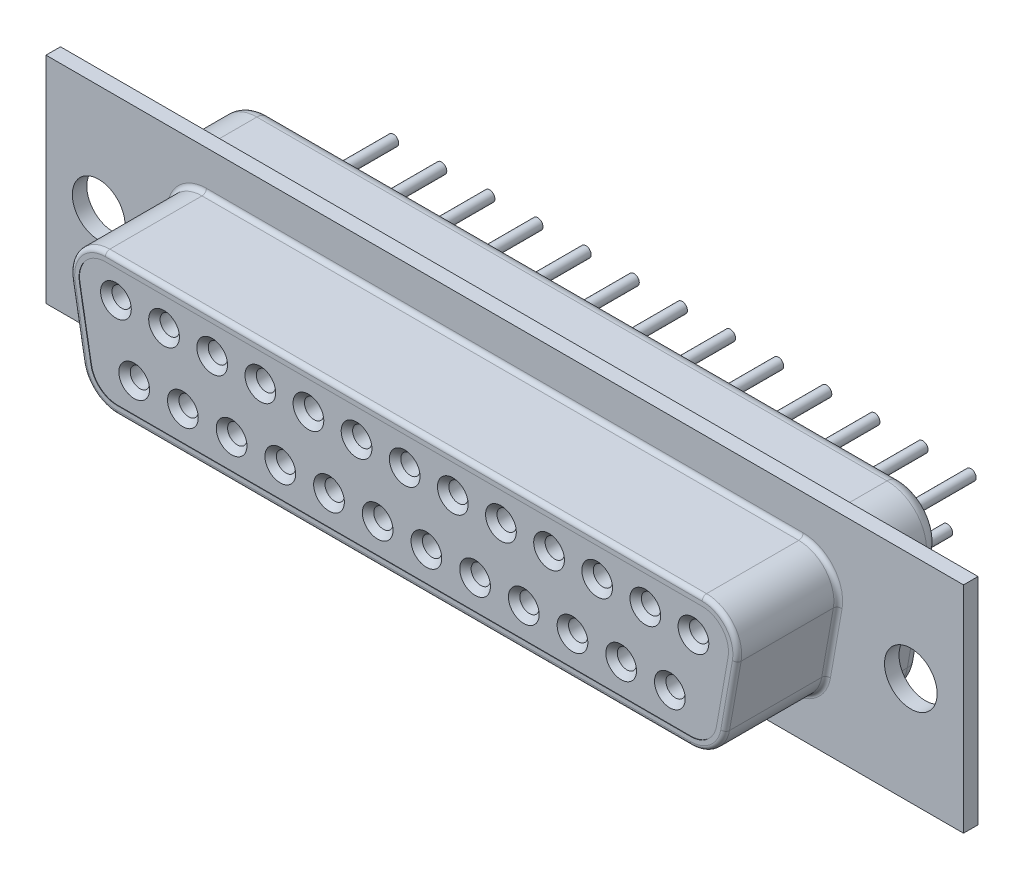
ISO-10303-21;
HEADER;
FILE_DESCRIPTION(('STEP AP214'),'2;1');
FILE_NAME('part.step','',(''),(''),'','','');
FILE_SCHEMA(('AUTOMOTIVE_DESIGN { 1 0 10303 214 1 1 1 1 }'));
ENDSEC;
DATA;
#1=APPLICATION_CONTEXT('core data for automotive mechanical design processes');
#2=APPLICATION_PROTOCOL_DEFINITION('international standard','automotive_design',2000,#1);
#3=PRODUCT_CONTEXT('',#1,'mechanical');
#4=PRODUCT('Part','Part','',(#3));
#5=PRODUCT_RELATED_PRODUCT_CATEGORY('part','',(#4));
#6=PRODUCT_DEFINITION_FORMATION('','',#4);
#7=PRODUCT_DEFINITION_CONTEXT('part definition',#1,'design');
#8=PRODUCT_DEFINITION('design','',#6,#7);
#9=PRODUCT_DEFINITION_SHAPE('','',#8);
#10=(LENGTH_UNIT() NAMED_UNIT(*) SI_UNIT(.MILLI.,.METRE.));
#11=(NAMED_UNIT(*) PLANE_ANGLE_UNIT() SI_UNIT($,.RADIAN.));
#12=(NAMED_UNIT(*) SI_UNIT($,.STERADIAN.) SOLID_ANGLE_UNIT());
#13=UNCERTAINTY_MEASURE_WITH_UNIT(LENGTH_MEASURE(1.E-05),#10,'distance_accuracy_value','');
#14=(GEOMETRIC_REPRESENTATION_CONTEXT(3) GLOBAL_UNCERTAINTY_ASSIGNED_CONTEXT((#13)) GLOBAL_UNIT_ASSIGNED_CONTEXT((#10,
#11,#12)) REPRESENTATION_CONTEXT('',''));
#15=CARTESIAN_POINT('',(0.,0.,0.));
#16=DIRECTION('',(0.,0.,1.));
#17=DIRECTION('',(1.,0.,0.));
#18=AXIS2_PLACEMENT_3D('',#15,#16,#17);
#19=CARTESIAN_POINT('',(16.8684769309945,1.90499999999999,-5.2451));
#20=DIRECTION('',(0.,0.,1.));
#21=DIRECTION('',(1.,0.,0.));
#22=AXIS2_PLACEMENT_3D('',#19,#20,#21);
#23=PLANE('',#22);
#24=CARTESIAN_POINT('',(4.09990345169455,-1.72898626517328,-5.2451));
#25=DIRECTION('',(0.,0.,1.));
#26=DIRECTION('',(1.,0.,0.));
#27=AXIS2_PLACEMENT_3D('',#24,#25,#26);
#28=CIRCLE('',#27,0.3048);
#29=CARTESIAN_POINT('',(4.40470345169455,-1.72898626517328,-5.2451));
#30=VERTEX_POINT('',#29);
#31=EDGE_CURVE('E941',#30,#30,#28,.F.);
#32=ORIENTED_EDGE('',*,*,#31,.F.);
#33=EDGE_LOOP('',(#32));
#34=FACE_BOUND('',#33,.T.);
#35=CARTESIAN_POINT('',(9.73521644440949,-1.72898626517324,-5.2451));
#36=DIRECTION('',(0.,0.,1.));
#37=DIRECTION('',(1.,0.,0.));
#38=AXIS2_PLACEMENT_3D('',#35,#36,#37);
#39=CIRCLE('',#38,0.3048);
#40=CARTESIAN_POINT('',(10.0400164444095,-1.72898626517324,-5.2451));
#41=VERTEX_POINT('',#40);
#42=EDGE_CURVE('E935',#41,#41,#39,.F.);
#43=ORIENTED_EDGE('',*,*,#42,.F.);
#44=EDGE_LOOP('',(#43));
#45=FACE_BOUND('',#44,.T.);
#46=CARTESIAN_POINT('',(15.3705294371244,-1.7289862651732,-5.2451));
#47=DIRECTION('',(0.,0.,1.));
#48=DIRECTION('',(1.,0.,0.));
#49=AXIS2_PLACEMENT_3D('',#46,#47,#48);
#50=CIRCLE('',#49,0.3048);
#51=CARTESIAN_POINT('',(15.6753294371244,-1.7289862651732,-5.2451));
#52=VERTEX_POINT('',#51);
#53=EDGE_CURVE('E929',#52,#52,#50,.F.);
#54=ORIENTED_EDGE('',*,*,#53,.F.);
#55=EDGE_LOOP('',(#54));
#56=FACE_BOUND('',#55,.T.);
#57=CARTESIAN_POINT('',(13.9496453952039,1.72540709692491,-5.2451));
#58=DIRECTION('',(0.,0.,1.));
#59=DIRECTION('',(1.,0.,0.));
#60=AXIS2_PLACEMENT_3D('',#57,#58,#59);
#61=CIRCLE('',#60,0.3048);
#62=CARTESIAN_POINT('',(14.2544453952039,1.72540709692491,-5.2451));
#63=VERTEX_POINT('',#62);
#64=EDGE_CURVE('E923',#63,#63,#61,.F.);
#65=ORIENTED_EDGE('',*,*,#64,.F.);
#66=EDGE_LOOP('',(#65));
#67=FACE_BOUND('',#66,.T.);
#68=CARTESIAN_POINT('',(8.38055597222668,1.73455036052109,-5.2451));
#69=DIRECTION('',(0.,0.,1.));
#70=DIRECTION('',(1.,0.,0.));
#71=AXIS2_PLACEMENT_3D('',#68,#69,#70);
#72=CIRCLE('',#71,0.3048);
#73=CARTESIAN_POINT('',(8.68535597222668,1.73455036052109,-5.2451));
#74=VERTEX_POINT('',#73);
#75=EDGE_CURVE('E917',#74,#74,#72,.F.);
#76=ORIENTED_EDGE('',*,*,#75,.F.);
#77=EDGE_LOOP('',(#76));
#78=FACE_BOUND('',#77,.T.);
#79=CARTESIAN_POINT('',(2.81146654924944,1.74369362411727,-5.2451));
#80=DIRECTION('',(0.,0.,1.));
#81=DIRECTION('',(1.,0.,0.));
#82=AXIS2_PLACEMENT_3D('',#79,#80,#81);
#83=CIRCLE('',#82,0.3048);
#84=CARTESIAN_POINT('',(3.11626654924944,1.74369362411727,-5.2451));
#85=VERTEX_POINT('',#84);
#86=EDGE_CURVE('E911',#85,#85,#83,.F.);
#87=ORIENTED_EDGE('',*,*,#86,.F.);
#88=EDGE_LOOP('',(#87));
#89=FACE_BOUND('',#88,.T.);
#90=CARTESIAN_POINT('',(-2.7576228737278,1.75283688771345,-5.2451));
#91=DIRECTION('',(0.,0.,1.));
#92=DIRECTION('',(1.,0.,0.));
#93=AXIS2_PLACEMENT_3D('',#90,#91,#92);
#94=CIRCLE('',#93,0.3048);
#95=CARTESIAN_POINT('',(-2.4528228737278,1.75283688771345,-5.2451));
#96=VERTEX_POINT('',#95);
#97=EDGE_CURVE('E905',#96,#96,#94,.F.);
#98=ORIENTED_EDGE('',*,*,#97,.F.);
#99=EDGE_LOOP('',(#98));
#100=FACE_BOUND('',#99,.T.);
#101=CARTESIAN_POINT('',(-4.35306603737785,-1.72898626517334,-5.2451));
#102=DIRECTION('',(0.,0.,1.));
#103=DIRECTION('',(1.,0.,0.));
#104=AXIS2_PLACEMENT_3D('',#101,#102,#103);
#105=CIRCLE('',#104,0.3048);
#106=CARTESIAN_POINT('',(-4.04826603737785,-1.72898626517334,-5.2451));
#107=VERTEX_POINT('',#106);
#108=EDGE_CURVE('E899',#107,#107,#105,.F.);
#109=ORIENTED_EDGE('',*,*,#108,.F.);
#110=EDGE_LOOP('',(#109));
#111=FACE_BOUND('',#110,.T.);
#112=CARTESIAN_POINT('',(-8.32671229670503,1.76198015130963,-5.2451));
#113=DIRECTION('',(0.,0.,1.));
#114=DIRECTION('',(1.,0.,0.));
#115=AXIS2_PLACEMENT_3D('',#112,#113,#114);
#116=CIRCLE('',#115,0.3048);
#117=CARTESIAN_POINT('',(-8.02191229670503,1.76198015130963,-5.2451));
#118=VERTEX_POINT('',#117);
#119=EDGE_CURVE('E893',#118,#118,#116,.F.);
#120=ORIENTED_EDGE('',*,*,#119,.F.);
#121=EDGE_LOOP('',(#120));
#122=FACE_BOUND('',#121,.T.);
#123=CARTESIAN_POINT('',(-9.98837903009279,-1.72898626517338,-5.2451));
#124=DIRECTION('',(0.,0.,1.));
#125=DIRECTION('',(1.,0.,0.));
#126=AXIS2_PLACEMENT_3D('',#123,#124,#125);
#127=CIRCLE('',#126,0.3048);
#128=CARTESIAN_POINT('',(-9.68357903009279,-1.72898626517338,-5.2451));
#129=VERTEX_POINT('',#128);
#130=EDGE_CURVE('E887',#129,#129,#127,.F.);
#131=ORIENTED_EDGE('',*,*,#130,.F.);
#132=EDGE_LOOP('',(#131));
#133=FACE_BOUND('',#132,.T.);
#134=CARTESIAN_POINT('',(-13.8958017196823,1.77112341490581,-5.2451));
#135=DIRECTION('',(0.,0.,1.));
#136=DIRECTION('',(1.,0.,0.));
#137=AXIS2_PLACEMENT_3D('',#134,#135,#136);
#138=CIRCLE('',#137,0.3048);
#139=CARTESIAN_POINT('',(-13.5910017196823,1.77112341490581,-5.2451));
#140=VERTEX_POINT('',#139);
#141=EDGE_CURVE('E881',#140,#140,#138,.F.);
#142=ORIENTED_EDGE('',*,*,#141,.F.);
#143=EDGE_LOOP('',(#142));
#144=FACE_BOUND('',#143,.T.);
#145=CARTESIAN_POINT('',(-15.6236920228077,-1.72898626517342,-5.2451));
#146=DIRECTION('',(0.,0.,1.));
#147=DIRECTION('',(1.,0.,0.));
#148=AXIS2_PLACEMENT_3D('',#145,#146,#147);
#149=CIRCLE('',#148,0.3048);
#150=CARTESIAN_POINT('',(-15.3188920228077,-1.72898626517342,-5.2451));
#151=VERTEX_POINT('',#150);
#152=EDGE_CURVE('E875',#151,#151,#149,.F.);
#153=ORIENTED_EDGE('',*,*,#152,.F.);
#154=EDGE_LOOP('',(#153));
#155=FACE_BOUND('',#154,.T.);
#156=CARTESIAN_POINT('',(16.8684769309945,1.90499999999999,-5.2451));
#157=DIRECTION('',(0.,0.,-1.));
#158=DIRECTION('',(1.,0.,0.));
#159=AXIS2_PLACEMENT_3D('',#156,#157,#158);
#160=CIRCLE('',#159,1.524);
#161=CARTESIAN_POINT('',(16.8684769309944,3.42899999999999,-5.2451));
#162=VERTEX_POINT('',#161);
#163=CARTESIAN_POINT('',(18.3693239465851,1.64036017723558,-5.2451));
#164=VERTEX_POINT('',#163);
#165=EDGE_CURVE('E373',#162,#164,#160,.T.);
#166=ORIENTED_EDGE('',*,*,#165,.T.);
#167=DIRECTION('',(-0.173648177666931,-0.984807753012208,0.));
#168=VECTOR('',#167,1.);
#169=CARTESIAN_POINT('',(18.3693239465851,1.64036017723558,-5.2451));
#170=LINE('',#169,#168);
#171=CARTESIAN_POINT('',(17.6975181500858,-2.1696398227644,-5.2451));
#172=VERTEX_POINT('',#171);
#173=EDGE_CURVE('E362',#164,#172,#170,.T.);
#174=ORIENTED_EDGE('',*,*,#173,.T.);
#175=CARTESIAN_POINT('',(16.1966711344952,-1.905,-5.2451));
#176=DIRECTION('',(0.,0.,-1.));
#177=DIRECTION('',(1.,0.,0.));
#178=AXIS2_PLACEMENT_3D('',#175,#176,#177);
#179=CIRCLE('',#178,1.524);
#180=CARTESIAN_POINT('',(16.1966711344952,-3.42900000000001,-5.2451));
#181=VERTEX_POINT('',#180);
#182=EDGE_CURVE('E372',#172,#181,#179,.T.);
#183=ORIENTED_EDGE('',*,*,#182,.T.);
#184=DIRECTION('',(-1.,0.,0.));
#185=VECTOR('',#184,1.);
#186=CARTESIAN_POINT('',(16.1966711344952,-3.429,-5.2451));
#187=LINE('',#186,#185);
#188=CARTESIAN_POINT('',(-16.1966711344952,-3.429,-5.2451));
#189=VERTEX_POINT('',#188);
#190=EDGE_CURVE('E1142',#181,#189,#187,.T.);
#191=ORIENTED_EDGE('',*,*,#190,.T.);
#192=CARTESIAN_POINT('',(-16.1966711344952,-1.905,-5.2451));
#193=DIRECTION('',(0.,0.,-1.));
#194=DIRECTION('',(-1.,0.,0.));
#195=AXIS2_PLACEMENT_3D('',#192,#193,#194);
#196=CIRCLE('',#195,1.524);
#197=CARTESIAN_POINT('',(-17.6975181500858,-2.16963982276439,-5.2451));
#198=VERTEX_POINT('',#197);
#199=EDGE_CURVE('E1144',#189,#198,#196,.T.);
#200=ORIENTED_EDGE('',*,*,#199,.T.);
#201=DIRECTION('',(-0.173648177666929,0.984807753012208,0.));
#202=VECTOR('',#201,1.);
#203=CARTESIAN_POINT('',(-17.6975181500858,-2.16963982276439,-5.2451));
#204=LINE('',#203,#202);
#205=CARTESIAN_POINT('',(-18.369323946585,1.64036017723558,-5.2451));
#206=VERTEX_POINT('',#205);
#207=EDGE_CURVE('E1146',#198,#206,#204,.T.);
#208=ORIENTED_EDGE('',*,*,#207,.T.);
#209=CARTESIAN_POINT('',(-16.8684769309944,1.90499999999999,-5.2451));
#210=DIRECTION('',(0.,0.,-1.));
#211=DIRECTION('',(1.,0.,0.));
#212=AXIS2_PLACEMENT_3D('',#209,#210,#211);
#213=CIRCLE('',#212,1.524);
#214=CARTESIAN_POINT('',(-16.8684769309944,3.42899999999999,-5.2451));
#215=VERTEX_POINT('',#214);
#216=EDGE_CURVE('E1148',#206,#215,#213,.T.);
#217=ORIENTED_EDGE('',*,*,#216,.T.);
#218=DIRECTION('',(1.,0.,0.));
#219=VECTOR('',#218,1.);
#220=CARTESIAN_POINT('',(-16.8684769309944,3.42899999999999,-5.2451));
#221=LINE('',#220,#219);
#222=EDGE_CURVE('E378',#215,#162,#221,.T.);
#223=ORIENTED_EDGE('',*,*,#222,.T.);
#224=EDGE_LOOP('',(#166,#174,#183,#191,#200,#208,#217,#223));
#225=FACE_BOUND('',#224,.T.);
#226=CARTESIAN_POINT('',(-16.6803464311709,1.77569504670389,-5.2451));
#227=DIRECTION('',(0.,0.,1.));
#228=DIRECTION('',(1.,0.,0.));
#229=AXIS2_PLACEMENT_3D('',#226,#227,#228);
#230=CIRCLE('',#229,0.3048);
#231=CARTESIAN_POINT('',(-16.3755464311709,1.77569504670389,-5.2451));
#232=VERTEX_POINT('',#231);
#233=EDGE_CURVE('E830',#232,#232,#230,.F.);
#234=ORIENTED_EDGE('',*,*,#233,.F.);
#235=EDGE_LOOP('',(#234));
#236=FACE_BOUND('',#235,.T.);
#237=CARTESIAN_POINT('',(-12.8060355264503,-1.7289862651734,-5.2451));
#238=DIRECTION('',(0.,0.,1.));
#239=DIRECTION('',(1.,0.,0.));
#240=AXIS2_PLACEMENT_3D('',#237,#238,#239);
#241=CIRCLE('',#240,0.3048);
#242=CARTESIAN_POINT('',(-12.5012355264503,-1.7289862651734,-5.2451));
#243=VERTEX_POINT('',#242);
#244=EDGE_CURVE('E878',#243,#243,#241,.F.);
#245=ORIENTED_EDGE('',*,*,#244,.F.);
#246=EDGE_LOOP('',(#245));
#247=FACE_BOUND('',#246,.T.);
#248=CARTESIAN_POINT('',(-11.1112570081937,1.76655178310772,-5.2451));
#249=DIRECTION('',(0.,0.,1.));
#250=DIRECTION('',(1.,0.,0.));
#251=AXIS2_PLACEMENT_3D('',#248,#249,#250);
#252=CIRCLE('',#251,0.3048);
#253=CARTESIAN_POINT('',(-10.8064570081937,1.76655178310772,-5.2451));
#254=VERTEX_POINT('',#253);
#255=EDGE_CURVE('E884',#254,#254,#252,.F.);
#256=ORIENTED_EDGE('',*,*,#255,.F.);
#257=EDGE_LOOP('',(#256));
#258=FACE_BOUND('',#257,.T.);
#259=CARTESIAN_POINT('',(-7.17072253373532,-1.72898626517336,-5.2451));
#260=DIRECTION('',(0.,0.,1.));
#261=DIRECTION('',(1.,0.,0.));
#262=AXIS2_PLACEMENT_3D('',#259,#260,#261);
#263=CIRCLE('',#262,0.3048);
#264=CARTESIAN_POINT('',(-6.86592253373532,-1.72898626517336,-5.2451));
#265=VERTEX_POINT('',#264);
#266=EDGE_CURVE('E890',#265,#265,#263,.F.);
#267=ORIENTED_EDGE('',*,*,#266,.F.);
#268=EDGE_LOOP('',(#267));
#269=FACE_BOUND('',#268,.T.);
#270=CARTESIAN_POINT('',(-5.54216758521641,1.75740851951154,-5.2451));
#271=DIRECTION('',(0.,0.,1.));
#272=DIRECTION('',(1.,0.,0.));
#273=AXIS2_PLACEMENT_3D('',#270,#271,#272);
#274=CIRCLE('',#273,0.3048);
#275=CARTESIAN_POINT('',(-5.23736758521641,1.75740851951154,-5.2451));
#276=VERTEX_POINT('',#275);
#277=EDGE_CURVE('E896',#276,#276,#274,.F.);
#278=ORIENTED_EDGE('',*,*,#277,.F.);
#279=EDGE_LOOP('',(#278));
#280=FACE_BOUND('',#279,.T.);
#281=CARTESIAN_POINT('',(-1.53540954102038,-1.72898626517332,-5.2451));
#282=DIRECTION('',(0.,0.,1.));
#283=DIRECTION('',(1.,0.,0.));
#284=AXIS2_PLACEMENT_3D('',#281,#282,#283);
#285=CIRCLE('',#284,0.3048);
#286=CARTESIAN_POINT('',(-1.23060954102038,-1.72898626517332,-5.2451));
#287=VERTEX_POINT('',#286);
#288=EDGE_CURVE('E902',#287,#287,#285,.F.);
#289=ORIENTED_EDGE('',*,*,#288,.F.);
#290=EDGE_LOOP('',(#289));
#291=FACE_BOUND('',#290,.T.);
#292=CARTESIAN_POINT('',(0.0269218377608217,1.74826525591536,-5.2451));
#293=DIRECTION('',(0.,0.,1.));
#294=DIRECTION('',(1.,0.,0.));
#295=AXIS2_PLACEMENT_3D('',#292,#293,#294);
#296=CIRCLE('',#295,0.3048);
#297=CARTESIAN_POINT('',(0.331721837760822,1.74826525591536,-5.2451));
#298=VERTEX_POINT('',#297);
#299=EDGE_CURVE('E908',#298,#298,#296,.F.);
#300=ORIENTED_EDGE('',*,*,#299,.F.);
#301=EDGE_LOOP('',(#300));
#302=FACE_BOUND('',#301,.T.);
#303=CARTESIAN_POINT('',(5.59601126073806,1.73912199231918,-5.2451));
#304=DIRECTION('',(0.,0.,1.));
#305=DIRECTION('',(1.,0.,0.));
#306=AXIS2_PLACEMENT_3D('',#303,#304,#305);
#307=CIRCLE('',#306,0.3048);
#308=CARTESIAN_POINT('',(5.90081126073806,1.73912199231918,-5.2451));
#309=VERTEX_POINT('',#308);
#310=EDGE_CURVE('E914',#309,#309,#307,.F.);
#311=ORIENTED_EDGE('',*,*,#310,.F.);
#312=EDGE_LOOP('',(#311));
#313=FACE_BOUND('',#312,.T.);
#314=CARTESIAN_POINT('',(11.1651006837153,1.729978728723,-5.2451));
#315=DIRECTION('',(0.,0.,1.));
#316=DIRECTION('',(1.,0.,0.));
#317=AXIS2_PLACEMENT_3D('',#314,#315,#316);
#318=CIRCLE('',#317,0.3048);
#319=CARTESIAN_POINT('',(11.4699006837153,1.729978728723,-5.2451));
#320=VERTEX_POINT('',#319);
#321=EDGE_CURVE('E920',#320,#320,#318,.F.);
#322=ORIENTED_EDGE('',*,*,#321,.F.);
#323=EDGE_LOOP('',(#322));
#324=FACE_BOUND('',#323,.T.);
#325=CARTESIAN_POINT('',(16.7341901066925,1.72083546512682,-5.2451));
#326=DIRECTION('',(0.,0.,1.));
#327=DIRECTION('',(1.,0.,0.));
#328=AXIS2_PLACEMENT_3D('',#325,#326,#327);
#329=CIRCLE('',#328,0.3048);
#330=CARTESIAN_POINT('',(17.0389901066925,1.72083546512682,-5.2451));
#331=VERTEX_POINT('',#330);
#332=EDGE_CURVE('E926',#331,#331,#329,.F.);
#333=ORIENTED_EDGE('',*,*,#332,.F.);
#334=EDGE_LOOP('',(#333));
#335=FACE_BOUND('',#334,.T.);
#336=CARTESIAN_POINT('',(12.552872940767,-1.72898626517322,-5.2451));
#337=DIRECTION('',(0.,0.,1.));
#338=DIRECTION('',(1.,0.,0.));
#339=AXIS2_PLACEMENT_3D('',#336,#337,#338);
#340=CIRCLE('',#339,0.3048);
#341=CARTESIAN_POINT('',(12.857672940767,-1.72898626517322,-5.2451));
#342=VERTEX_POINT('',#341);
#343=EDGE_CURVE('E932',#342,#342,#340,.F.);
#344=ORIENTED_EDGE('',*,*,#343,.F.);
#345=EDGE_LOOP('',(#344));
#346=FACE_BOUND('',#345,.T.);
#347=CARTESIAN_POINT('',(6.91755994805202,-1.72898626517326,-5.2451));
#348=DIRECTION('',(0.,0.,1.));
#349=DIRECTION('',(1.,0.,0.));
#350=AXIS2_PLACEMENT_3D('',#347,#348,#349);
#351=CIRCLE('',#350,0.3048);
#352=CARTESIAN_POINT('',(7.22235994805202,-1.72898626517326,-5.2451));
#353=VERTEX_POINT('',#352);
#354=EDGE_CURVE('E938',#353,#353,#351,.F.);
#355=ORIENTED_EDGE('',*,*,#354,.F.);
#356=EDGE_LOOP('',(#355));
#357=FACE_BOUND('',#356,.T.);
#358=CARTESIAN_POINT('',(1.28224695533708,-1.7289862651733,-5.2451));
#359=DIRECTION('',(0.,0.,1.));
#360=DIRECTION('',(1.,0.,0.));
#361=AXIS2_PLACEMENT_3D('',#358,#359,#360);
#362=CIRCLE('',#361,0.3048);
#363=CARTESIAN_POINT('',(1.58704695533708,-1.7289862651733,-5.2451));
#364=VERTEX_POINT('',#363);
#365=EDGE_CURVE('E944',#364,#364,#362,.F.);
#366=ORIENTED_EDGE('',*,*,#365,.F.);
#367=EDGE_LOOP('',(#366));
#368=FACE_BOUND('',#367,.T.);
#369=ADVANCED_FACE('F31',(#34,#45,#56,#67,#78,#89,#100,#111,#122,#133,#144,#155,#225,#236,#247,
#258,#269,#280,#291,#302,#313,#324,#335,#346,#357,#368),#23,.F.);
#370=CARTESIAN_POINT('',(18.2306512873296,3.04799999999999,-4.2291));
#371=DIRECTION('',(0.,0.,-1.));
#372=DIRECTION('',(-1.,0.,0.));
#373=AXIS2_PLACEMENT_3D('',#370,#371,#372);
#374=PLANE('',#373);
#375=CARTESIAN_POINT('',(18.2306512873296,3.04799999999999,-4.2291));
#376=DIRECTION('',(0.,0.,-1.));
#377=DIRECTION('',(-1.,0.,0.));
#378=AXIS2_PLACEMENT_3D('',#375,#376,#377);
#379=CIRCLE('',#378,1.524);
#380=CARTESIAN_POINT('',(18.2306512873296,4.572,-4.2291));
#381=VERTEX_POINT('',#380);
#382=CARTESIAN_POINT('',(19.7314983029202,2.78336017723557,-4.2291));
#383=VERTEX_POINT('',#382);
#384=EDGE_CURVE('E959',#381,#383,#379,.T.);
#385=ORIENTED_EDGE('',*,*,#384,.T.);
#386=DIRECTION('',(-0.173648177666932,-0.984807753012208,0.));
#387=VECTOR('',#386,1.);
#388=CARTESIAN_POINT('',(18.6566090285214,-3.3126398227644,-4.2291));
#389=LINE('',#388,#387);
#390=CARTESIAN_POINT('',(18.6566090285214,-3.31263982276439,-4.2291));
#391=VERTEX_POINT('',#390);
#392=EDGE_CURVE('E961',#383,#391,#389,.T.);
#393=ORIENTED_EDGE('',*,*,#392,.T.);
#394=CARTESIAN_POINT('',(17.1557620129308,-3.048,-4.2291));
#395=DIRECTION('',(0.,0.,-1.));
#396=DIRECTION('',(-1.,0.,0.));
#397=AXIS2_PLACEMENT_3D('',#394,#395,#396);
#398=CIRCLE('',#397,1.524);
#399=CARTESIAN_POINT('',(17.1557620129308,-4.572,-4.2291));
#400=VERTEX_POINT('',#399);
#401=EDGE_CURVE('E947',#391,#400,#398,.T.);
#402=ORIENTED_EDGE('',*,*,#401,.T.);
#403=DIRECTION('',(-1.,0.,0.));
#404=VECTOR('',#403,1.);
#405=CARTESIAN_POINT('',(-17.1557620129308,-4.572,-4.2291));
#406=LINE('',#405,#404);
#407=CARTESIAN_POINT('',(-17.1557620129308,-4.572,-4.2291));
#408=VERTEX_POINT('',#407);
#409=EDGE_CURVE('E949',#400,#408,#406,.T.);
#410=ORIENTED_EDGE('',*,*,#409,.T.);
#411=CARTESIAN_POINT('',(-17.1557620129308,-3.048,-4.2291));
#412=DIRECTION('',(0.,0.,-1.));
#413=DIRECTION('',(-1.,0.,0.));
#414=AXIS2_PLACEMENT_3D('',#411,#412,#413);
#415=CIRCLE('',#414,1.524);
#416=CARTESIAN_POINT('',(-18.6566090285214,-3.31263982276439,-4.2291));
#417=VERTEX_POINT('',#416);
#418=EDGE_CURVE('E951',#408,#417,#415,.T.);
#419=ORIENTED_EDGE('',*,*,#418,.T.);
#420=DIRECTION('',(-0.17364817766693,0.984807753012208,0.));
#421=VECTOR('',#420,1.);
#422=CARTESIAN_POINT('',(-19.7314983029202,2.78336017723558,-4.2291));
#423=LINE('',#422,#421);
#424=CARTESIAN_POINT('',(-19.7314983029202,2.78336017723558,-4.2291));
#425=VERTEX_POINT('',#424);
#426=EDGE_CURVE('E953',#417,#425,#423,.T.);
#427=ORIENTED_EDGE('',*,*,#426,.T.);
#428=CARTESIAN_POINT('',(-18.2306512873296,3.048,-4.2291));
#429=DIRECTION('',(0.,0.,-1.));
#430=DIRECTION('',(-1.,0.,0.));
#431=AXIS2_PLACEMENT_3D('',#428,#429,#430);
#432=CIRCLE('',#431,1.524);
#433=CARTESIAN_POINT('',(-18.2306512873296,4.572,-4.2291));
#434=VERTEX_POINT('',#433);
#435=EDGE_CURVE('E955',#425,#434,#432,.T.);
#436=ORIENTED_EDGE('',*,*,#435,.T.);
#437=DIRECTION('',(1.,0.,0.));
#438=VECTOR('',#437,1.);
#439=CARTESIAN_POINT('',(18.2306512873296,4.572,-4.2291));
#440=LINE('',#439,#438);
#441=EDGE_CURVE('E957',#434,#381,#440,.T.);
#442=ORIENTED_EDGE('',*,*,#441,.T.);
#443=EDGE_LOOP('',(#385,#393,#402,#410,#419,#427,#436,#442));
#444=FACE_BOUND('',#443,.T.);
#445=DIRECTION('',(-0.173648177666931,-0.984807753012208,0.));
#446=VECTOR('',#445,1.);
#447=CARTESIAN_POINT('',(18.3693239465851,1.64036017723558,-4.2291));
#448=LINE('',#447,#446);
#449=CARTESIAN_POINT('',(18.3693239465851,1.64036017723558,-4.2291));
#450=VERTEX_POINT('',#449);
#451=CARTESIAN_POINT('',(17.6975181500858,-2.1696398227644,-4.2291));
#452=VERTEX_POINT('',#451);
#453=EDGE_CURVE('E1153',#450,#452,#448,.T.);
#454=ORIENTED_EDGE('',*,*,#453,.F.);
#455=CARTESIAN_POINT('',(16.8684769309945,1.90499999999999,-4.2291));
#456=DIRECTION('',(0.,0.,-1.));
#457=DIRECTION('',(1.,0.,0.));
#458=AXIS2_PLACEMENT_3D('',#455,#456,#457);
#459=CIRCLE('',#458,1.524);
#460=CARTESIAN_POINT('',(16.8684769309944,3.42899999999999,-4.2291));
#461=VERTEX_POINT('',#460);
#462=EDGE_CURVE('E386',#461,#450,#459,.T.);
#463=ORIENTED_EDGE('',*,*,#462,.F.);
#464=DIRECTION('',(1.,0.,0.));
#465=VECTOR('',#464,1.);
#466=CARTESIAN_POINT('',(-16.8684769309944,3.42899999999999,-4.2291));
#467=LINE('',#466,#465);
#468=CARTESIAN_POINT('',(-16.8684769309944,3.42899999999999,-4.2291));
#469=VERTEX_POINT('',#468);
#470=EDGE_CURVE('E382',#469,#461,#467,.T.);
#471=ORIENTED_EDGE('',*,*,#470,.F.);
#472=CARTESIAN_POINT('',(-16.8684769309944,1.90499999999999,-4.2291));
#473=DIRECTION('',(0.,0.,-1.));
#474=DIRECTION('',(1.,0.,0.));
#475=AXIS2_PLACEMENT_3D('',#472,#473,#474);
#476=CIRCLE('',#475,1.524);
#477=CARTESIAN_POINT('',(-18.369323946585,1.64036017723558,-4.2291));
#478=VERTEX_POINT('',#477);
#479=EDGE_CURVE('E1163',#478,#469,#476,.T.);
#480=ORIENTED_EDGE('',*,*,#479,.F.);
#481=DIRECTION('',(-0.173648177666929,0.984807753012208,0.));
#482=VECTOR('',#481,1.);
#483=CARTESIAN_POINT('',(-17.6975181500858,-2.16963982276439,-4.2291));
#484=LINE('',#483,#482);
#485=CARTESIAN_POINT('',(-17.6975181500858,-2.16963982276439,-4.2291));
#486=VERTEX_POINT('',#485);
#487=EDGE_CURVE('E1161',#486,#478,#484,.T.);
#488=ORIENTED_EDGE('',*,*,#487,.F.);
#489=CARTESIAN_POINT('',(-16.1966711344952,-1.905,-4.2291));
#490=DIRECTION('',(0.,0.,-1.));
#491=DIRECTION('',(-1.,0.,0.));
#492=AXIS2_PLACEMENT_3D('',#489,#490,#491);
#493=CIRCLE('',#492,1.524);
#494=CARTESIAN_POINT('',(-16.1966711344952,-3.429,-4.2291));
#495=VERTEX_POINT('',#494);
#496=EDGE_CURVE('E1159',#495,#486,#493,.T.);
#497=ORIENTED_EDGE('',*,*,#496,.F.);
#498=DIRECTION('',(-1.,0.,0.));
#499=VECTOR('',#498,1.);
#500=CARTESIAN_POINT('',(16.1966711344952,-3.429,-4.2291));
#501=LINE('',#500,#499);
#502=CARTESIAN_POINT('',(16.1966711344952,-3.42900000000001,-4.2291));
#503=VERTEX_POINT('',#502);
#504=EDGE_CURVE('E1157',#503,#495,#501,.T.);
#505=ORIENTED_EDGE('',*,*,#504,.F.);
#506=CARTESIAN_POINT('',(16.1966711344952,-1.905,-4.2291));
#507=DIRECTION('',(0.,0.,-1.));
#508=DIRECTION('',(1.,0.,0.));
#509=AXIS2_PLACEMENT_3D('',#506,#507,#508);
#510=CIRCLE('',#509,1.524);
#511=EDGE_CURVE('E1155',#452,#503,#510,.T.);
#512=ORIENTED_EDGE('',*,*,#511,.F.);
#513=EDGE_LOOP('',(#454,#463,#471,#480,#488,#497,#505,#512));
#514=FACE_BOUND('',#513,.T.);
#515=ADVANCED_FACE('F1189',(#444,#514),#374,.T.);
#516=CARTESIAN_POINT('',(-26.543,-6.223,-0.4191));
#517=DIRECTION('',(0.,0.,1.));
#518=DIRECTION('',(1.,0.,0.));
#519=AXIS2_PLACEMENT_3D('',#516,#517,#518);
#520=PLANE('',#519);
#521=CARTESIAN_POINT('',(-23.495,0.,-0.4191));
#522=DIRECTION('',(0.,0.,1.));
#523=DIRECTION('',(1.,0.,0.));
#524=AXIS2_PLACEMENT_3D('',#521,#522,#523);
#525=CIRCLE('',#524,1.524);
#526=CARTESIAN_POINT('',(-21.971,0.,-0.4191));
#527=VERTEX_POINT('',#526);
#528=EDGE_CURVE('E1056',#527,#527,#525,.T.);
#529=ORIENTED_EDGE('',*,*,#528,.T.);
#530=EDGE_LOOP('',(#529));
#531=FACE_BOUND('',#530,.T.);
#532=CARTESIAN_POINT('',(23.495,0.,-0.4191));
#533=DIRECTION('',(0.,0.,1.));
#534=DIRECTION('',(1.,0.,0.));
#535=AXIS2_PLACEMENT_3D('',#532,#533,#534);
#536=CIRCLE('',#535,1.524);
#537=CARTESIAN_POINT('',(25.019,0.,-0.4191));
#538=VERTEX_POINT('',#537);
#539=EDGE_CURVE('E1036',#538,#538,#536,.T.);
#540=ORIENTED_EDGE('',*,*,#539,.T.);
#541=EDGE_LOOP('',(#540));
#542=FACE_BOUND('',#541,.T.);
#543=CARTESIAN_POINT('',(17.1557620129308,-3.048,-0.4191));
#544=DIRECTION('',(0.,0.,1.));
#545=DIRECTION('',(1.,0.,0.));
#546=AXIS2_PLACEMENT_3D('',#543,#544,#545);
#547=CIRCLE('',#546,3.048);
#548=CARTESIAN_POINT('',(17.1557620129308,-6.096,-0.4191));
#549=VERTEX_POINT('',#548);
#550=CARTESIAN_POINT('',(20.157456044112,-3.5772796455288,-0.4191));
#551=VERTEX_POINT('',#550);
#552=EDGE_CURVE('E994',#549,#551,#547,.T.);
#553=ORIENTED_EDGE('',*,*,#552,.T.);
#554=DIRECTION('',(-0.173648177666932,-0.984807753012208,0.));
#555=VECTOR('',#554,1.);
#556=CARTESIAN_POINT('',(21.2323453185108,2.51872035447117,-0.4191));
#557=LINE('',#556,#555);
#558=CARTESIAN_POINT('',(21.2323453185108,2.51872035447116,-0.4191));
#559=VERTEX_POINT('',#558);
#560=EDGE_CURVE('E1007',#551,#559,#557,.F.);
#561=ORIENTED_EDGE('',*,*,#560,.T.);
#562=CARTESIAN_POINT('',(18.2306512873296,3.04799999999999,-0.4191));
#563=DIRECTION('',(0.,0.,1.));
#564=DIRECTION('',(1.,0.,0.));
#565=AXIS2_PLACEMENT_3D('',#562,#563,#564);
#566=CIRCLE('',#565,3.048);
#567=CARTESIAN_POINT('',(18.2306512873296,6.09599999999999,-0.4191));
#568=VERTEX_POINT('',#567);
#569=EDGE_CURVE('E55',#559,#568,#566,.T.);
#570=ORIENTED_EDGE('',*,*,#569,.T.);
#571=DIRECTION('',(1.,0.,0.));
#572=VECTOR('',#571,1.);
#573=CARTESIAN_POINT('',(-18.2306512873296,6.09599999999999,-0.4191));
#574=LINE('',#573,#572);
#575=CARTESIAN_POINT('',(-18.2306512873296,6.09599999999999,-0.4191));
#576=VERTEX_POINT('',#575);
#577=EDGE_CURVE('E1004',#568,#576,#574,.F.);
#578=ORIENTED_EDGE('',*,*,#577,.T.);
#579=CARTESIAN_POINT('',(-18.2306512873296,3.048,-0.4191));
#580=DIRECTION('',(0.,0.,1.));
#581=DIRECTION('',(1.,0.,0.));
#582=AXIS2_PLACEMENT_3D('',#579,#580,#581);
#583=CIRCLE('',#582,3.048);
#584=CARTESIAN_POINT('',(-21.2323453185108,2.51872035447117,-0.4191));
#585=VERTEX_POINT('',#584);
#586=EDGE_CURVE('E1002',#576,#585,#583,.T.);
#587=ORIENTED_EDGE('',*,*,#586,.T.);
#588=DIRECTION('',(-0.17364817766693,0.984807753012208,0.));
#589=VECTOR('',#588,1.);
#590=CARTESIAN_POINT('',(-20.157456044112,-3.57727964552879,-0.4191));
#591=LINE('',#590,#589);
#592=CARTESIAN_POINT('',(-20.157456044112,-3.57727964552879,-0.4191));
#593=VERTEX_POINT('',#592);
#594=EDGE_CURVE('E1000',#585,#593,#591,.F.);
#595=ORIENTED_EDGE('',*,*,#594,.T.);
#596=CARTESIAN_POINT('',(-17.1557620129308,-3.048,-0.4191));
#597=DIRECTION('',(0.,0.,1.));
#598=DIRECTION('',(1.,0.,0.));
#599=AXIS2_PLACEMENT_3D('',#596,#597,#598);
#600=CIRCLE('',#599,3.048);
#601=CARTESIAN_POINT('',(-17.1557620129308,-6.096,-0.4191));
#602=VERTEX_POINT('',#601);
#603=EDGE_CURVE('E998',#593,#602,#600,.T.);
#604=ORIENTED_EDGE('',*,*,#603,.T.);
#605=DIRECTION('',(-1.,0.,0.));
#606=VECTOR('',#605,1.);
#607=CARTESIAN_POINT('',(17.1557620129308,-6.096,-0.4191));
#608=LINE('',#607,#606);
#609=EDGE_CURVE('E996',#602,#549,#608,.F.);
#610=ORIENTED_EDGE('',*,*,#609,.T.);
#611=EDGE_LOOP('',(#553,#561,#570,#578,#587,#595,#604,#610));
#612=FACE_BOUND('',#611,.T.);
#613=DIRECTION('',(0.,-1.,0.));
#614=VECTOR('',#613,1.);
#615=CARTESIAN_POINT('',(-26.543,6.223,-0.4191));
#616=LINE('',#615,#614);
#617=CARTESIAN_POINT('',(-26.543,6.223,-0.4191));
#618=VERTEX_POINT('',#617);
#619=CARTESIAN_POINT('',(-26.543,-6.223,-0.4191));
#620=VERTEX_POINT('',#619);
#621=EDGE_CURVE('E732',#618,#620,#616,.T.);
#622=ORIENTED_EDGE('',*,*,#621,.F.);
#623=DIRECTION('',(-1.,0.,0.));
#624=VECTOR('',#623,1.);
#625=CARTESIAN_POINT('',(-26.543,6.223,-0.4191));
#626=LINE('',#625,#624);
#627=CARTESIAN_POINT('',(26.543,6.223,-0.4191));
#628=VERTEX_POINT('',#627);
#629=EDGE_CURVE('E737',#628,#618,#626,.T.);
#630=ORIENTED_EDGE('',*,*,#629,.F.);
#631=DIRECTION('',(0.,1.,0.));
#632=VECTOR('',#631,1.);
#633=CARTESIAN_POINT('',(26.543,6.223,-0.4191));
#634=LINE('',#633,#632);
#635=CARTESIAN_POINT('',(26.543,-6.223,-0.4191));
#636=VERTEX_POINT('',#635);
#637=EDGE_CURVE('E748',#636,#628,#634,.T.);
#638=ORIENTED_EDGE('',*,*,#637,.F.);
#639=DIRECTION('',(1.,0.,0.));
#640=VECTOR('',#639,1.);
#641=CARTESIAN_POINT('',(-26.543,-6.223,-0.4191));
#642=LINE('',#641,#640);
#643=EDGE_CURVE('E746',#620,#636,#642,.T.);
#644=ORIENTED_EDGE('',*,*,#643,.F.);
#645=EDGE_LOOP('',(#622,#630,#638,#644));
#646=FACE_BOUND('',#645,.T.);
#647=ADVANCED_FACE('F1217',(#531,#542,#612,#646),#520,.F.);
#648=CARTESIAN_POINT('',(-26.543,-6.223,0.4191));
#649=DIRECTION('',(0.,0.,1.));
#650=DIRECTION('',(1.,0.,0.));
#651=AXIS2_PLACEMENT_3D('',#648,#649,#650);
#652=PLANE('',#651);
#653=CARTESIAN_POINT('',(-23.495,0.,0.4191));
#654=DIRECTION('',(0.,0.,1.));
#655=DIRECTION('',(1.,0.,0.));
#656=AXIS2_PLACEMENT_3D('',#653,#654,#655);
#657=CIRCLE('',#656,1.524);
#658=CARTESIAN_POINT('',(-21.971,0.,0.4191));
#659=VERTEX_POINT('',#658);
#660=EDGE_CURVE('E35',#659,#659,#657,.T.);
#661=ORIENTED_EDGE('',*,*,#660,.F.);
#662=EDGE_LOOP('',(#661));
#663=FACE_BOUND('',#662,.T.);
#664=CARTESIAN_POINT('',(23.495,0.,0.4191));
#665=DIRECTION('',(0.,0.,1.));
#666=DIRECTION('',(1.,0.,0.));
#667=AXIS2_PLACEMENT_3D('',#664,#665,#666);
#668=CIRCLE('',#667,1.524);
#669=CARTESIAN_POINT('',(25.019,0.,0.4191));
#670=VERTEX_POINT('',#669);
#671=EDGE_CURVE('E1054',#670,#670,#668,.T.);
#672=ORIENTED_EDGE('',*,*,#671,.F.);
#673=EDGE_LOOP('',(#672));
#674=FACE_BOUND('',#673,.T.);
#675=DIRECTION('',(1.,0.,0.));
#676=VECTOR('',#675,1.);
#677=CARTESIAN_POINT('',(-26.543,-4.191,0.4191));
#678=LINE('',#677,#676);
#679=CARTESIAN_POINT('',(16.5915509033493,-4.191,0.4191));
#680=VERTEX_POINT('',#679);
#681=CARTESIAN_POINT('',(-16.5915509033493,-4.191,0.4191));
#682=VERTEX_POINT('',#681);
#683=EDGE_CURVE('E809',#680,#682,#678,.F.);
#684=ORIENTED_EDGE('',*,*,#683,.T.);
#685=CARTESIAN_POINT('',(-16.5915509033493,-1.905,0.4191));
#686=DIRECTION('',(0.,0.,1.));
#687=DIRECTION('',(1.,0.,0.));
#688=AXIS2_PLACEMENT_3D('',#685,#686,#687);
#689=CIRCLE('',#688,2.286);
#690=CARTESIAN_POINT('',(-18.8428214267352,-2.3019597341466,0.4191));
#691=VERTEX_POINT('',#690);
#692=EDGE_CURVE('E823',#682,#691,#689,.F.);
#693=ORIENTED_EDGE('',*,*,#692,.T.);
#694=DIRECTION('',(0.173648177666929,-0.984807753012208,0.));
#695=VECTOR('',#694,1.);
#696=CARTESIAN_POINT('',(-18.4044728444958,-4.78795807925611,0.4191));
#697=LINE('',#696,#695);
#698=CARTESIAN_POINT('',(-19.5146272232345,1.50804026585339,0.4191));
#699=VERTEX_POINT('',#698);
#700=EDGE_CURVE('E821',#691,#699,#697,.F.);
#701=ORIENTED_EDGE('',*,*,#700,.T.);
#702=CARTESIAN_POINT('',(-17.2633566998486,1.90499999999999,0.4191));
#703=DIRECTION('',(0.,0.,1.));
#704=DIRECTION('',(1.,0.,0.));
#705=AXIS2_PLACEMENT_3D('',#702,#703,#704);
#706=CIRCLE('',#705,2.286);
#707=CARTESIAN_POINT('',(-17.2633566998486,4.191,0.4191));
#708=VERTEX_POINT('',#707);
#709=EDGE_CURVE('E819',#699,#708,#706,.F.);
#710=ORIENTED_EDGE('',*,*,#709,.T.);
#711=DIRECTION('',(-1.,0.,0.));
#712=VECTOR('',#711,1.);
#713=CARTESIAN_POINT('',(-26.543,4.191,0.4191));
#714=LINE('',#713,#712);
#715=CARTESIAN_POINT('',(17.2633566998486,4.191,0.4191));
#716=VERTEX_POINT('',#715);
#717=EDGE_CURVE('E817',#708,#716,#714,.F.);
#718=ORIENTED_EDGE('',*,*,#717,.T.);
#719=CARTESIAN_POINT('',(17.2633566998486,1.90499999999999,0.4191));
#720=DIRECTION('',(0.,0.,1.));
#721=DIRECTION('',(1.,0.,0.));
#722=AXIS2_PLACEMENT_3D('',#719,#720,#721);
#723=CIRCLE('',#722,2.286);
#724=CARTESIAN_POINT('',(19.5146272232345,1.50804026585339,0.4191));
#725=VERTEX_POINT('',#724);
#726=EDGE_CURVE('E815',#716,#725,#723,.F.);
#727=ORIENTED_EDGE('',*,*,#726,.T.);
#728=DIRECTION('',(0.173648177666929,0.984807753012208,0.));
#729=VECTOR('',#728,1.);
#730=CARTESIAN_POINT('',(16.8037340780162,-13.8661987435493,0.4191));
#731=LINE('',#730,#729);
#732=CARTESIAN_POINT('',(18.8428214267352,-2.3019597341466,0.4191));
#733=VERTEX_POINT('',#732);
#734=EDGE_CURVE('E813',#725,#733,#731,.F.);
#735=ORIENTED_EDGE('',*,*,#734,.T.);
#736=CARTESIAN_POINT('',(16.5915509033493,-1.905,0.4191));
#737=DIRECTION('',(0.,0.,1.));
#738=DIRECTION('',(1.,0.,0.));
#739=AXIS2_PLACEMENT_3D('',#736,#737,#738);
#740=CIRCLE('',#739,2.286);
#741=EDGE_CURVE('E811',#733,#680,#740,.F.);
#742=ORIENTED_EDGE('',*,*,#741,.T.);
#743=EDGE_LOOP('',(#684,#693,#701,#710,#718,#727,#735,#742));
#744=FACE_BOUND('',#743,.T.);
#745=DIRECTION('',(0.,-1.,0.));
#746=VECTOR('',#745,1.);
#747=CARTESIAN_POINT('',(-26.543,6.223,0.4191));
#748=LINE('',#747,#746);
#749=CARTESIAN_POINT('',(-26.543,6.223,0.4191));
#750=VERTEX_POINT('',#749);
#751=CARTESIAN_POINT('',(-26.543,-6.223,0.4191));
#752=VERTEX_POINT('',#751);
#753=EDGE_CURVE('E733',#750,#752,#748,.T.);
#754=ORIENTED_EDGE('',*,*,#753,.T.);
#755=DIRECTION('',(1.,0.,0.));
#756=VECTOR('',#755,1.);
#757=CARTESIAN_POINT('',(-26.543,-6.223,0.4191));
#758=LINE('',#757,#756);
#759=CARTESIAN_POINT('',(26.543,-6.223,0.4191));
#760=VERTEX_POINT('',#759);
#761=EDGE_CURVE('E736',#752,#760,#758,.T.);
#762=ORIENTED_EDGE('',*,*,#761,.T.);
#763=DIRECTION('',(0.,1.,0.));
#764=VECTOR('',#763,1.);
#765=CARTESIAN_POINT('',(26.543,6.223,0.4191));
#766=LINE('',#765,#764);
#767=CARTESIAN_POINT('',(26.543,6.223,0.4191));
#768=VERTEX_POINT('',#767);
#769=EDGE_CURVE('E739',#760,#768,#766,.T.);
#770=ORIENTED_EDGE('',*,*,#769,.T.);
#771=DIRECTION('',(-1.,0.,0.));
#772=VECTOR('',#771,1.);
#773=CARTESIAN_POINT('',(-26.543,6.223,0.4191));
#774=LINE('',#773,#772);
#775=EDGE_CURVE('E741',#768,#750,#774,.T.);
#776=ORIENTED_EDGE('',*,*,#775,.T.);
#777=EDGE_LOOP('',(#754,#762,#770,#776));
#778=FACE_BOUND('',#777,.T.);
#779=ADVANCED_FACE('F2045',(#663,#674,#744,#778),#652,.T.);
#780=CARTESIAN_POINT('',(-26.543,6.223,0.4191));
#781=DIRECTION('',(1.,0.,0.));
#782=DIRECTION('',(0.,0.,-1.));
#783=AXIS2_PLACEMENT_3D('',#780,#781,#782);
#784=PLANE('',#783);
#785=ORIENTED_EDGE('',*,*,#621,.T.);
#786=DIRECTION('',(0.,0.,-1.));
#787=VECTOR('',#786,1.);
#788=CARTESIAN_POINT('',(-26.543,-6.223,0.4191));
#789=LINE('',#788,#787);
#790=EDGE_CURVE('E759',#752,#620,#789,.T.);
#791=ORIENTED_EDGE('',*,*,#790,.F.);
#792=ORIENTED_EDGE('',*,*,#753,.F.);
#793=DIRECTION('',(0.,0.,-1.));
#794=VECTOR('',#793,1.);
#795=CARTESIAN_POINT('',(-26.543,6.223,0.4191));
#796=LINE('',#795,#794);
#797=EDGE_CURVE('E743',#750,#618,#796,.T.);
#798=ORIENTED_EDGE('',*,*,#797,.T.);
#799=EDGE_LOOP('',(#785,#791,#792,#798));
#800=FACE_BOUND('',#799,.T.);
#801=ADVANCED_FACE('F3033',(#800),#784,.F.);
#802=CARTESIAN_POINT('',(-26.543,-6.223,0.4191));
#803=DIRECTION('',(0.,1.,0.));
#804=DIRECTION('',(0.,0.,1.));
#805=AXIS2_PLACEMENT_3D('',#802,#803,#804);
#806=PLANE('',#805);
#807=ORIENTED_EDGE('',*,*,#643,.T.);
#808=DIRECTION('',(0.,0.,-1.));
#809=VECTOR('',#808,1.);
#810=CARTESIAN_POINT('',(26.543,-6.223,0.4191));
#811=LINE('',#810,#809);
#812=EDGE_CURVE('E756',#760,#636,#811,.T.);
#813=ORIENTED_EDGE('',*,*,#812,.F.);
#814=ORIENTED_EDGE('',*,*,#761,.F.);
#815=ORIENTED_EDGE('',*,*,#790,.T.);
#816=EDGE_LOOP('',(#807,#813,#814,#815));
#817=FACE_BOUND('',#816,.T.);
#818=ADVANCED_FACE('F3050',(#817),#806,.F.);
#819=CARTESIAN_POINT('',(26.543,6.223,0.4191));
#820=DIRECTION('',(-1.,0.,0.));
#821=DIRECTION('',(0.,-1.,0.));
#822=AXIS2_PLACEMENT_3D('',#819,#820,#821);
#823=PLANE('',#822);
#824=ORIENTED_EDGE('',*,*,#637,.T.);
#825=DIRECTION('',(0.,0.,-1.));
#826=VECTOR('',#825,1.);
#827=CARTESIAN_POINT('',(26.543,6.223,0.4191));
#828=LINE('',#827,#826);
#829=EDGE_CURVE('E753',#768,#628,#828,.T.);
#830=ORIENTED_EDGE('',*,*,#829,.F.);
#831=ORIENTED_EDGE('',*,*,#769,.F.);
#832=ORIENTED_EDGE('',*,*,#812,.T.);
#833=EDGE_LOOP('',(#824,#830,#831,#832));
#834=FACE_BOUND('',#833,.T.);
#835=ADVANCED_FACE('F3041',(#834),#823,.F.);
#836=CARTESIAN_POINT('',(-26.543,6.223,0.4191));
#837=DIRECTION('',(0.,-1.,0.));
#838=DIRECTION('',(0.,0.,-1.));
#839=AXIS2_PLACEMENT_3D('',#836,#837,#838);
#840=PLANE('',#839);
#841=ORIENTED_EDGE('',*,*,#629,.T.);
#842=ORIENTED_EDGE('',*,*,#797,.F.);
#843=ORIENTED_EDGE('',*,*,#775,.F.);
#844=ORIENTED_EDGE('',*,*,#829,.T.);
#845=EDGE_LOOP('',(#841,#842,#843,#844));
#846=FACE_BOUND('',#845,.T.);
#847=ADVANCED_FACE('F3025',(#846),#840,.F.);
#848=CARTESIAN_POINT('',(-17.2633566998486,1.90499999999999,6.2611));
#849=DIRECTION('',(0.,0.,-1.));
#850=DIRECTION('',(-1.,0.,0.));
#851=AXIS2_PLACEMENT_3D('',#848,#849,#850);
#852=CYLINDRICAL_SURFACE('',#851,2.032);
#853=DIRECTION('',(0.,0.,-1.));
#854=VECTOR('',#853,1.);
#855=CARTESIAN_POINT('',(-19.2644860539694,1.55214690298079,6.2611));
#856=LINE('',#855,#854);
#857=CARTESIAN_POINT('',(-19.2644860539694,1.55214690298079,6.0071));
#858=VERTEX_POINT('',#857);
#859=CARTESIAN_POINT('',(-19.2644860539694,1.55214690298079,0.6731));
#860=VERTEX_POINT('',#859);
#861=EDGE_CURVE('E729',#858,#860,#856,.T.);
#862=ORIENTED_EDGE('',*,*,#861,.F.);
#863=CARTESIAN_POINT('',(-17.2633566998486,1.90499999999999,6.0071));
#864=DIRECTION('',(0.,0.,1.));
#865=DIRECTION('',(1.,0.,0.));
#866=AXIS2_PLACEMENT_3D('',#863,#864,#865);
#867=CIRCLE('',#866,2.032);
#868=CARTESIAN_POINT('',(-17.2633566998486,3.937,6.0071));
#869=VERTEX_POINT('',#868);
#870=EDGE_CURVE('E791',#858,#869,#867,.F.);
#871=ORIENTED_EDGE('',*,*,#870,.T.);
#872=DIRECTION('',(0.,0.,-1.));
#873=VECTOR('',#872,1.);
#874=CARTESIAN_POINT('',(-17.2633566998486,3.937,6.2611));
#875=LINE('',#874,#873);
#876=CARTESIAN_POINT('',(-17.2633566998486,3.937,0.6731));
#877=VERTEX_POINT('',#876);
#878=EDGE_CURVE('E694',#869,#877,#875,.T.);
#879=ORIENTED_EDGE('',*,*,#878,.T.);
#880=CARTESIAN_POINT('',(-17.2633566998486,1.90499999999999,0.6731));
#881=DIRECTION('',(0.,0.,1.));
#882=DIRECTION('',(1.,0.,0.));
#883=AXIS2_PLACEMENT_3D('',#880,#881,#882);
#884=CIRCLE('',#883,2.032);
#885=EDGE_CURVE('E789',#877,#860,#884,.T.);
#886=ORIENTED_EDGE('',*,*,#885,.T.);
#887=EDGE_LOOP('',(#862,#871,#879,#886));
#888=FACE_BOUND('',#887,.T.);
#889=ADVANCED_FACE('F3017',(#888),#852,.T.);
#890=CARTESIAN_POINT('',(-19.2644860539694,1.55214690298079,6.2611));
#891=DIRECTION('',(0.984807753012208,0.173648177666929,0.));
#892=DIRECTION('',(-0.173648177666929,0.984807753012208,0.));
#893=AXIS2_PLACEMENT_3D('',#890,#891,#892);
#894=PLANE('',#893);
#895=DIRECTION('',(0.,0.,-1.));
#896=VECTOR('',#895,1.);
#897=CARTESIAN_POINT('',(-18.5926802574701,-2.2578530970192,6.2611));
#898=LINE('',#897,#896);
#899=CARTESIAN_POINT('',(-18.5926802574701,-2.2578530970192,6.0071));
#900=VERTEX_POINT('',#899);
#901=CARTESIAN_POINT('',(-18.5926802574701,-2.2578530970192,0.6731));
#902=VERTEX_POINT('',#901);
#903=EDGE_CURVE('E726',#900,#902,#898,.T.);
#904=ORIENTED_EDGE('',*,*,#903,.F.);
#905=DIRECTION('',(0.173648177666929,-0.984807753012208,0.));
#906=VECTOR('',#905,1.);
#907=CARTESIAN_POINT('',(-19.2644860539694,1.55214690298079,6.0071));
#908=LINE('',#907,#906);
#909=EDGE_CURVE('E787',#900,#858,#908,.F.);
#910=ORIENTED_EDGE('',*,*,#909,.T.);
#911=ORIENTED_EDGE('',*,*,#861,.T.);
#912=DIRECTION('',(0.173648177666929,-0.984807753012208,0.));
#913=VECTOR('',#912,1.);
#914=CARTESIAN_POINT('',(-19.2644860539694,1.55214690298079,0.6731));
#915=LINE('',#914,#913);
#916=EDGE_CURVE('E785',#860,#902,#915,.T.);
#917=ORIENTED_EDGE('',*,*,#916,.T.);
#918=EDGE_LOOP('',(#904,#910,#911,#917));
#919=FACE_BOUND('',#918,.T.);
#920=ADVANCED_FACE('F3008',(#919),#894,.F.);
#921=CARTESIAN_POINT('',(-16.5915509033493,-1.905,6.2611));
#922=DIRECTION('',(0.,0.,-1.));
#923=DIRECTION('',(-1.,0.,0.));
#924=AXIS2_PLACEMENT_3D('',#921,#922,#923);
#925=CYLINDRICAL_SURFACE('',#924,2.032);
#926=DIRECTION('',(0.,0.,-1.));
#927=VECTOR('',#926,1.);
#928=CARTESIAN_POINT('',(-16.5915509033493,-3.937,6.2611));
#929=LINE('',#928,#927);
#930=CARTESIAN_POINT('',(-16.5915509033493,-3.937,6.0071));
#931=VERTEX_POINT('',#930);
#932=CARTESIAN_POINT('',(-16.5915509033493,-3.937,0.6731));
#933=VERTEX_POINT('',#932);
#934=EDGE_CURVE('E723',#931,#933,#929,.T.);
#935=ORIENTED_EDGE('',*,*,#934,.F.);
#936=CARTESIAN_POINT('',(-16.5915509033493,-1.905,6.0071));
#937=DIRECTION('',(0.,0.,1.));
#938=DIRECTION('',(1.,0.,0.));
#939=AXIS2_PLACEMENT_3D('',#936,#937,#938);
#940=CIRCLE('',#939,2.032);
#941=EDGE_CURVE('E782',#931,#900,#940,.F.);
#942=ORIENTED_EDGE('',*,*,#941,.T.);
#943=ORIENTED_EDGE('',*,*,#903,.T.);
#944=CARTESIAN_POINT('',(-16.5915509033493,-1.905,0.6731));
#945=DIRECTION('',(0.,0.,1.));
#946=DIRECTION('',(1.,0.,0.));
#947=AXIS2_PLACEMENT_3D('',#944,#945,#946);
#948=CIRCLE('',#947,2.032);
#949=EDGE_CURVE('E779',#902,#933,#948,.T.);
#950=ORIENTED_EDGE('',*,*,#949,.T.);
#951=EDGE_LOOP('',(#935,#942,#943,#950));
#952=FACE_BOUND('',#951,.T.);
#953=ADVANCED_FACE('F2999',(#952),#925,.T.);
#954=CARTESIAN_POINT('',(16.5915509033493,-3.937,6.2611));
#955=DIRECTION('',(0.,1.,0.));
#956=DIRECTION('',(0.,0.,1.));
#957=AXIS2_PLACEMENT_3D('',#954,#955,#956);
#958=PLANE('',#957);
#959=DIRECTION('',(0.,0.,-1.));
#960=VECTOR('',#959,1.);
#961=CARTESIAN_POINT('',(16.5915509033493,-3.937,6.2611));
#962=LINE('',#961,#960);
#963=CARTESIAN_POINT('',(16.5915509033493,-3.937,6.0071));
#964=VERTEX_POINT('',#963);
#965=CARTESIAN_POINT('',(16.5915509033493,-3.937,0.6731));
#966=VERTEX_POINT('',#965);
#967=EDGE_CURVE('E720',#964,#966,#962,.T.);
#968=ORIENTED_EDGE('',*,*,#967,.F.);
#969=DIRECTION('',(1.,0.,0.));
#970=VECTOR('',#969,1.);
#971=CARTESIAN_POINT('',(-16.5915509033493,-3.937,6.0071));
#972=LINE('',#971,#970);
#973=EDGE_CURVE('E828',#964,#931,#972,.F.);
#974=ORIENTED_EDGE('',*,*,#973,.T.);
#975=ORIENTED_EDGE('',*,*,#934,.T.);
#976=DIRECTION('',(1.,0.,0.));
#977=VECTOR('',#976,1.);
#978=CARTESIAN_POINT('',(16.5915509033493,-3.937,0.6731));
#979=LINE('',#978,#977);
#980=EDGE_CURVE('E826',#933,#966,#979,.T.);
#981=ORIENTED_EDGE('',*,*,#980,.T.);
#982=EDGE_LOOP('',(#968,#974,#975,#981));
#983=FACE_BOUND('',#982,.T.);
#984=ADVANCED_FACE('F2990',(#983),#958,.F.);
#985=CARTESIAN_POINT('',(16.5915509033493,-1.905,6.2611));
#986=DIRECTION('',(0.,0.,-1.));
#987=DIRECTION('',(-1.,0.,0.));
#988=AXIS2_PLACEMENT_3D('',#985,#986,#987);
#989=CYLINDRICAL_SURFACE('',#988,2.032);
#990=DIRECTION('',(0.,0.,-1.));
#991=VECTOR('',#990,1.);
#992=CARTESIAN_POINT('',(18.5926802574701,-2.2578530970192,6.2611));
#993=LINE('',#992,#991);
#994=CARTESIAN_POINT('',(18.5926802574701,-2.2578530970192,6.0071));
#995=VERTEX_POINT('',#994);
#996=CARTESIAN_POINT('',(18.5926802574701,-2.2578530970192,0.6731));
#997=VERTEX_POINT('',#996);
#998=EDGE_CURVE('E717',#995,#997,#993,.T.);
#999=ORIENTED_EDGE('',*,*,#998,.F.);
#1000=CARTESIAN_POINT('',(16.5915509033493,-1.905,6.0071));
#1001=DIRECTION('',(0.,0.,1.));
#1002=DIRECTION('',(1.,0.,0.));
#1003=AXIS2_PLACEMENT_3D('',#1000,#1001,#1002);
#1004=CIRCLE('',#1003,2.032);
#1005=EDGE_CURVE('E807',#995,#964,#1004,.F.);
#1006=ORIENTED_EDGE('',*,*,#1005,.T.);
#1007=ORIENTED_EDGE('',*,*,#967,.T.);
#1008=CARTESIAN_POINT('',(16.5915509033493,-1.905,0.6731));
#1009=DIRECTION('',(0.,0.,1.));
#1010=DIRECTION('',(1.,0.,0.));
#1011=AXIS2_PLACEMENT_3D('',#1008,#1009,#1010);
#1012=CIRCLE('',#1011,2.032);
#1013=EDGE_CURVE('E805',#966,#997,#1012,.T.);
#1014=ORIENTED_EDGE('',*,*,#1013,.T.);
#1015=EDGE_LOOP('',(#999,#1006,#1007,#1014));
#1016=FACE_BOUND('',#1015,.T.);
#1017=ADVANCED_FACE('F2981',(#1016),#989,.T.);
#1018=CARTESIAN_POINT('',(19.2644860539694,1.55214690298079,6.2611));
#1019=DIRECTION('',(-0.984807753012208,0.173648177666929,0.));
#1020=DIRECTION('',(-0.173648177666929,-0.984807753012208,0.));
#1021=AXIS2_PLACEMENT_3D('',#1018,#1019,#1020);
#1022=PLANE('',#1021);
#1023=DIRECTION('',(0.,0.,-1.));
#1024=VECTOR('',#1023,1.);
#1025=CARTESIAN_POINT('',(19.2644860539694,1.55214690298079,6.2611));
#1026=LINE('',#1025,#1024);
#1027=CARTESIAN_POINT('',(19.2644860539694,1.55214690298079,6.0071));
#1028=VERTEX_POINT('',#1027);
#1029=CARTESIAN_POINT('',(19.2644860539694,1.55214690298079,0.6731));
#1030=VERTEX_POINT('',#1029);
#1031=EDGE_CURVE('E714',#1028,#1030,#1026,.T.);
#1032=ORIENTED_EDGE('',*,*,#1031,.F.);
#1033=DIRECTION('',(0.173648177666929,0.984807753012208,0.));
#1034=VECTOR('',#1033,1.);
#1035=CARTESIAN_POINT('',(18.5926802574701,-2.2578530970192,6.0071));
#1036=LINE('',#1035,#1034);
#1037=EDGE_CURVE('E803',#1028,#995,#1036,.F.);
#1038=ORIENTED_EDGE('',*,*,#1037,.T.);
#1039=ORIENTED_EDGE('',*,*,#998,.T.);
#1040=DIRECTION('',(0.173648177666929,0.984807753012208,0.));
#1041=VECTOR('',#1040,1.);
#1042=CARTESIAN_POINT('',(19.2644860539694,1.55214690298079,0.6731));
#1043=LINE('',#1042,#1041);
#1044=EDGE_CURVE('E801',#997,#1030,#1043,.T.);
#1045=ORIENTED_EDGE('',*,*,#1044,.T.);
#1046=EDGE_LOOP('',(#1032,#1038,#1039,#1045));
#1047=FACE_BOUND('',#1046,.T.);
#1048=ADVANCED_FACE('F2972',(#1047),#1022,.F.);
#1049=CARTESIAN_POINT('',(17.2633566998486,1.90499999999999,6.2611));
#1050=DIRECTION('',(0.,0.,-1.));
#1051=DIRECTION('',(-1.,0.,0.));
#1052=AXIS2_PLACEMENT_3D('',#1049,#1050,#1051);
#1053=CYLINDRICAL_SURFACE('',#1052,2.032);
#1054=DIRECTION('',(0.,0.,-1.));
#1055=VECTOR('',#1054,1.);
#1056=CARTESIAN_POINT('',(17.2633566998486,3.937,6.2611));
#1057=LINE('',#1056,#1055);
#1058=CARTESIAN_POINT('',(17.2633566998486,3.937,6.0071));
#1059=VERTEX_POINT('',#1058);
#1060=CARTESIAN_POINT('',(17.2633566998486,3.937,0.6731));
#1061=VERTEX_POINT('',#1060);
#1062=EDGE_CURVE('E711',#1059,#1061,#1057,.T.);
#1063=ORIENTED_EDGE('',*,*,#1062,.F.);
#1064=CARTESIAN_POINT('',(17.2633566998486,1.90499999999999,6.0071));
#1065=DIRECTION('',(0.,0.,1.));
#1066=DIRECTION('',(1.,0.,0.));
#1067=AXIS2_PLACEMENT_3D('',#1064,#1065,#1066);
#1068=CIRCLE('',#1067,2.032);
#1069=EDGE_CURVE('E799',#1059,#1028,#1068,.F.);
#1070=ORIENTED_EDGE('',*,*,#1069,.T.);
#1071=ORIENTED_EDGE('',*,*,#1031,.T.);
#1072=CARTESIAN_POINT('',(17.2633566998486,1.90499999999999,0.6731));
#1073=DIRECTION('',(0.,0.,1.));
#1074=DIRECTION('',(1.,0.,0.));
#1075=AXIS2_PLACEMENT_3D('',#1072,#1073,#1074);
#1076=CIRCLE('',#1075,2.032);
#1077=EDGE_CURVE('E797',#1030,#1061,#1076,.T.);
#1078=ORIENTED_EDGE('',*,*,#1077,.T.);
#1079=EDGE_LOOP('',(#1063,#1070,#1071,#1078));
#1080=FACE_BOUND('',#1079,.T.);
#1081=ADVANCED_FACE('F2963',(#1080),#1053,.T.);
#1082=CARTESIAN_POINT('',(17.2633566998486,3.937,6.2611));
#1083=DIRECTION('',(0.,-1.,0.));
#1084=DIRECTION('',(0.,0.,-1.));
#1085=AXIS2_PLACEMENT_3D('',#1082,#1083,#1084);
#1086=PLANE('',#1085);
#1087=ORIENTED_EDGE('',*,*,#878,.F.);
#1088=DIRECTION('',(-1.,0.,0.));
#1089=VECTOR('',#1088,1.);
#1090=CARTESIAN_POINT('',(17.2633566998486,3.937,6.0071));
#1091=LINE('',#1090,#1089);
#1092=EDGE_CURVE('E795',#869,#1059,#1091,.F.);
#1093=ORIENTED_EDGE('',*,*,#1092,.T.);
#1094=ORIENTED_EDGE('',*,*,#1062,.T.);
#1095=DIRECTION('',(-1.,0.,0.));
#1096=VECTOR('',#1095,1.);
#1097=CARTESIAN_POINT('',(17.2633566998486,3.937,0.6731));
#1098=LINE('',#1097,#1096);
#1099=EDGE_CURVE('E793',#1061,#877,#1098,.T.);
#1100=ORIENTED_EDGE('',*,*,#1099,.T.);
#1101=EDGE_LOOP('',(#1087,#1093,#1094,#1100));
#1102=FACE_BOUND('',#1101,.T.);
#1103=ADVANCED_FACE('F2954',(#1102),#1086,.F.);
#1104=CARTESIAN_POINT('',(-17.2633566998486,1.90499999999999,6.2611));
#1105=DIRECTION('',(0.,0.,1.));
#1106=DIRECTION('',(1.,0.,0.));
#1107=AXIS2_PLACEMENT_3D('',#1104,#1105,#1106);
#1108=PLANE('',#1107);
#1109=DIRECTION('',(0.173648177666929,-0.984807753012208,0.));
#1110=VECTOR('',#1109,1.);
#1111=CARTESIAN_POINT('',(-18.342539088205,-2.2137464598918,6.2611));
#1112=LINE('',#1111,#1110);
#1113=CARTESIAN_POINT('',(-19.0143448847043,1.59625354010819,6.2611));
#1114=VERTEX_POINT('',#1113);
#1115=CARTESIAN_POINT('',(-18.342539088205,-2.2137464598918,6.2611));
#1116=VERTEX_POINT('',#1115);
#1117=EDGE_CURVE('E774',#1114,#1116,#1112,.T.);
#1118=ORIENTED_EDGE('',*,*,#1117,.T.);
#1119=CARTESIAN_POINT('',(-16.5915509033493,-1.905,6.2611));
#1120=DIRECTION('',(0.,0.,1.));
#1121=DIRECTION('',(1.,0.,0.));
#1122=AXIS2_PLACEMENT_3D('',#1119,#1120,#1121);
#1123=CIRCLE('',#1122,1.778);
#1124=CARTESIAN_POINT('',(-16.5915509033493,-3.683,6.2611));
#1125=VERTEX_POINT('',#1124);
#1126=EDGE_CURVE('E776',#1116,#1125,#1123,.T.);
#1127=ORIENTED_EDGE('',*,*,#1126,.T.);
#1128=DIRECTION('',(1.,0.,0.));
#1129=VECTOR('',#1128,1.);
#1130=CARTESIAN_POINT('',(16.5915509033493,-3.683,6.2611));
#1131=LINE('',#1130,#1129);
#1132=CARTESIAN_POINT('',(16.5915509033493,-3.683,6.2611));
#1133=VERTEX_POINT('',#1132);
#1134=EDGE_CURVE('E762',#1125,#1133,#1131,.T.);
#1135=ORIENTED_EDGE('',*,*,#1134,.T.);
#1136=CARTESIAN_POINT('',(16.5915509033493,-1.905,6.2611));
#1137=DIRECTION('',(0.,0.,1.));
#1138=DIRECTION('',(1.,0.,0.));
#1139=AXIS2_PLACEMENT_3D('',#1136,#1137,#1138);
#1140=CIRCLE('',#1139,1.778);
#1141=CARTESIAN_POINT('',(18.342539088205,-2.2137464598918,6.2611));
#1142=VERTEX_POINT('',#1141);
#1143=EDGE_CURVE('E764',#1133,#1142,#1140,.T.);
#1144=ORIENTED_EDGE('',*,*,#1143,.T.);
#1145=DIRECTION('',(0.173648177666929,0.984807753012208,0.));
#1146=VECTOR('',#1145,1.);
#1147=CARTESIAN_POINT('',(19.0143448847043,1.59625354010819,6.2611));
#1148=LINE('',#1147,#1146);
#1149=CARTESIAN_POINT('',(19.0143448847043,1.59625354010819,6.2611));
#1150=VERTEX_POINT('',#1149);
#1151=EDGE_CURVE('E766',#1142,#1150,#1148,.T.);
#1152=ORIENTED_EDGE('',*,*,#1151,.T.);
#1153=CARTESIAN_POINT('',(17.2633566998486,1.90499999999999,6.2611));
#1154=DIRECTION('',(0.,0.,1.));
#1155=DIRECTION('',(1.,0.,0.));
#1156=AXIS2_PLACEMENT_3D('',#1153,#1154,#1155);
#1157=CIRCLE('',#1156,1.778);
#1158=CARTESIAN_POINT('',(17.2633566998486,3.683,6.2611));
#1159=VERTEX_POINT('',#1158);
#1160=EDGE_CURVE('E768',#1150,#1159,#1157,.T.);
#1161=ORIENTED_EDGE('',*,*,#1160,.T.);
#1162=DIRECTION('',(-1.,0.,0.));
#1163=VECTOR('',#1162,1.);
#1164=CARTESIAN_POINT('',(-17.2633566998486,3.683,6.2611));
#1165=LINE('',#1164,#1163);
#1166=CARTESIAN_POINT('',(-17.2633566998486,3.683,6.2611));
#1167=VERTEX_POINT('',#1166);
#1168=EDGE_CURVE('E770',#1159,#1167,#1165,.T.);
#1169=ORIENTED_EDGE('',*,*,#1168,.T.);
#1170=CARTESIAN_POINT('',(-17.2633566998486,1.90499999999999,6.2611));
#1171=DIRECTION('',(0.,0.,1.));
#1172=DIRECTION('',(1.,0.,0.));
#1173=AXIS2_PLACEMENT_3D('',#1170,#1171,#1172);
#1174=CIRCLE('',#1173,1.778);
#1175=EDGE_CURVE('E772',#1167,#1114,#1174,.T.);
#1176=ORIENTED_EDGE('',*,*,#1175,.T.);
#1177=EDGE_LOOP('',(#1118,#1127,#1135,#1144,#1152,#1161,#1169,#1176));
#1178=FACE_BOUND('',#1177,.T.);
#1179=CARTESIAN_POINT('',(-17.2633566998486,1.90499999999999,6.2611));
#1180=DIRECTION('',(0.,0.,1.));
#1181=DIRECTION('',(1.,0.,0.));
#1182=AXIS2_PLACEMENT_3D('',#1179,#1180,#1181);
#1183=CIRCLE('',#1182,1.524);
#1184=CARTESIAN_POINT('',(-17.2633566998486,3.42899999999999,6.2611));
#1185=VERTEX_POINT('',#1184);
#1186=CARTESIAN_POINT('',(-18.7642037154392,1.64036017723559,6.2611));
#1187=VERTEX_POINT('',#1186);
#1188=EDGE_CURVE('E669',#1185,#1187,#1183,.T.);
#1189=ORIENTED_EDGE('',*,*,#1188,.F.);
#1190=DIRECTION('',(-1.,0.,0.));
#1191=VECTOR('',#1190,1.);
#1192=CARTESIAN_POINT('',(17.2633566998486,3.42899999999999,6.2611));
#1193=LINE('',#1192,#1191);
#1194=CARTESIAN_POINT('',(17.2633566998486,3.42899999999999,6.2611));
#1195=VERTEX_POINT('',#1194);
#1196=EDGE_CURVE('E647',#1195,#1185,#1193,.T.);
#1197=ORIENTED_EDGE('',*,*,#1196,.F.);
#1198=CARTESIAN_POINT('',(17.2633566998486,1.90499999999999,6.2611));
#1199=DIRECTION('',(0.,0.,1.));
#1200=DIRECTION('',(1.,0.,0.));
#1201=AXIS2_PLACEMENT_3D('',#1198,#1199,#1200);
#1202=CIRCLE('',#1201,1.524);
#1203=CARTESIAN_POINT('',(18.7642037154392,1.64036017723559,6.2611));
#1204=VERTEX_POINT('',#1203);
#1205=EDGE_CURVE('E687',#1204,#1195,#1202,.T.);
#1206=ORIENTED_EDGE('',*,*,#1205,.F.);
#1207=DIRECTION('',(0.173648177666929,0.984807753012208,0.));
#1208=VECTOR('',#1207,1.);
#1209=CARTESIAN_POINT('',(18.0923979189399,-2.1696398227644,6.2611));
#1210=LINE('',#1209,#1208);
#1211=CARTESIAN_POINT('',(18.0923979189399,-2.1696398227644,6.2611));
#1212=VERTEX_POINT('',#1211);
#1213=EDGE_CURVE('E684',#1212,#1204,#1210,.T.);
#1214=ORIENTED_EDGE('',*,*,#1213,.F.);
#1215=CARTESIAN_POINT('',(16.5915509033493,-1.905,6.2611));
#1216=DIRECTION('',(0.,0.,1.));
#1217=DIRECTION('',(1.,0.,0.));
#1218=AXIS2_PLACEMENT_3D('',#1215,#1216,#1217);
#1219=CIRCLE('',#1218,1.524);
#1220=CARTESIAN_POINT('',(16.5915509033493,-3.429,6.2611));
#1221=VERTEX_POINT('',#1220);
#1222=EDGE_CURVE('E681',#1221,#1212,#1219,.T.);
#1223=ORIENTED_EDGE('',*,*,#1222,.F.);
#1224=DIRECTION('',(1.,0.,0.));
#1225=VECTOR('',#1224,1.);
#1226=CARTESIAN_POINT('',(-16.5915509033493,-3.429,6.2611));
#1227=LINE('',#1226,#1225);
#1228=CARTESIAN_POINT('',(-16.5915509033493,-3.429,6.2611));
#1229=VERTEX_POINT('',#1228);
#1230=EDGE_CURVE('E678',#1229,#1221,#1227,.T.);
#1231=ORIENTED_EDGE('',*,*,#1230,.F.);
#1232=CARTESIAN_POINT('',(-16.5915509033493,-1.905,6.2611));
#1233=DIRECTION('',(0.,0.,1.));
#1234=DIRECTION('',(1.,0.,0.));
#1235=AXIS2_PLACEMENT_3D('',#1232,#1233,#1234);
#1236=CIRCLE('',#1235,1.524);
#1237=CARTESIAN_POINT('',(-18.0923979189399,-2.1696398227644,6.2611));
#1238=VERTEX_POINT('',#1237);
#1239=EDGE_CURVE('E675',#1238,#1229,#1236,.T.);
#1240=ORIENTED_EDGE('',*,*,#1239,.F.);
#1241=DIRECTION('',(0.173648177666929,-0.984807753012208,0.));
#1242=VECTOR('',#1241,1.);
#1243=CARTESIAN_POINT('',(-18.7642037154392,1.64036017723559,6.2611));
#1244=LINE('',#1243,#1242);
#1245=EDGE_CURVE('E671',#1187,#1238,#1244,.T.);
#1246=ORIENTED_EDGE('',*,*,#1245,.F.);
#1247=EDGE_LOOP('',(#1189,#1197,#1206,#1214,#1223,#1231,#1240,#1246));
#1248=FACE_BOUND('',#1247,.T.);
#1249=ADVANCED_FACE('F2945',(#1178,#1248),#1108,.T.);
#1250=CARTESIAN_POINT('',(-17.2633566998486,1.90499999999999,6.2357));
#1251=DIRECTION('',(0.,0.,1.));
#1252=DIRECTION('',(1.,0.,0.));
#1253=AXIS2_PLACEMENT_3D('',#1250,#1251,#1252);
#1254=CYLINDRICAL_SURFACE('',#1253,1.524);
#1255=ORIENTED_EDGE('',*,*,#1188,.T.);
#1256=DIRECTION('',(0.,0.,1.));
#1257=VECTOR('',#1256,1.);
#1258=CARTESIAN_POINT('',(-18.7642037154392,1.64036017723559,6.2357));
#1259=LINE('',#1258,#1257);
#1260=CARTESIAN_POINT('',(-18.7642037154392,1.64036017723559,6.2357));
#1261=VERTEX_POINT('',#1260);
#1262=EDGE_CURVE('E668',#1261,#1187,#1259,.T.);
#1263=ORIENTED_EDGE('',*,*,#1262,.F.);
#1264=CARTESIAN_POINT('',(-17.2633566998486,1.90499999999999,6.2357));
#1265=DIRECTION('',(0.,0.,1.));
#1266=DIRECTION('',(1.,0.,0.));
#1267=AXIS2_PLACEMENT_3D('',#1264,#1265,#1266);
#1268=CIRCLE('',#1267,1.524);
#1269=CARTESIAN_POINT('',(-17.2633566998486,3.42899999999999,6.2357));
#1270=VERTEX_POINT('',#1269);
#1271=EDGE_CURVE('E643',#1270,#1261,#1268,.T.);
#1272=ORIENTED_EDGE('',*,*,#1271,.F.);
#1273=DIRECTION('',(0.,0.,1.));
#1274=VECTOR('',#1273,1.);
#1275=CARTESIAN_POINT('',(-17.2633566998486,3.42899999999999,6.2357));
#1276=LINE('',#1275,#1274);
#1277=EDGE_CURVE('E692',#1270,#1185,#1276,.T.);
#1278=ORIENTED_EDGE('',*,*,#1277,.T.);
#1279=EDGE_LOOP('',(#1255,#1263,#1272,#1278));
#1280=FACE_BOUND('',#1279,.T.);
#1281=ADVANCED_FACE('F2936',(#1280),#1254,.F.);
#1282=CARTESIAN_POINT('',(17.2633566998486,3.42899999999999,6.2357));
#1283=DIRECTION('',(0.,1.,0.));
#1284=DIRECTION('',(0.,0.,1.));
#1285=AXIS2_PLACEMENT_3D('',#1282,#1283,#1284);
#1286=PLANE('',#1285);
#1287=ORIENTED_EDGE('',*,*,#1196,.T.);
#1288=ORIENTED_EDGE('',*,*,#1277,.F.);
#1289=DIRECTION('',(-1.,0.,0.));
#1290=VECTOR('',#1289,1.);
#1291=CARTESIAN_POINT('',(17.2633566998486,3.42899999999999,6.2357));
#1292=LINE('',#1291,#1290);
#1293=CARTESIAN_POINT('',(17.2633566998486,3.42899999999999,6.2357));
#1294=VERTEX_POINT('',#1293);
#1295=EDGE_CURVE('E665',#1294,#1270,#1292,.T.);
#1296=ORIENTED_EDGE('',*,*,#1295,.F.);
#1297=DIRECTION('',(0.,0.,1.));
#1298=VECTOR('',#1297,1.);
#1299=CARTESIAN_POINT('',(17.2633566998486,3.42899999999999,6.2357));
#1300=LINE('',#1299,#1298);
#1301=EDGE_CURVE('E695',#1294,#1195,#1300,.T.);
#1302=ORIENTED_EDGE('',*,*,#1301,.T.);
#1303=EDGE_LOOP('',(#1287,#1288,#1296,#1302));
#1304=FACE_BOUND('',#1303,.T.);
#1305=ADVANCED_FACE('F2927',(#1304),#1286,.F.);
#1306=CARTESIAN_POINT('',(17.2633566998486,1.90499999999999,6.2357));
#1307=DIRECTION('',(0.,0.,1.));
#1308=DIRECTION('',(1.,0.,0.));
#1309=AXIS2_PLACEMENT_3D('',#1306,#1307,#1308);
#1310=CYLINDRICAL_SURFACE('',#1309,1.524);
#1311=ORIENTED_EDGE('',*,*,#1205,.T.);
#1312=ORIENTED_EDGE('',*,*,#1301,.F.);
#1313=CARTESIAN_POINT('',(17.2633566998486,1.90499999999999,6.2357));
#1314=DIRECTION('',(0.,0.,1.));
#1315=DIRECTION('',(1.,0.,0.));
#1316=AXIS2_PLACEMENT_3D('',#1313,#1314,#1315);
#1317=CIRCLE('',#1316,1.524);
#1318=CARTESIAN_POINT('',(18.7642037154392,1.64036017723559,6.2357));
#1319=VERTEX_POINT('',#1318);
#1320=EDGE_CURVE('E662',#1319,#1294,#1317,.T.);
#1321=ORIENTED_EDGE('',*,*,#1320,.F.);
#1322=DIRECTION('',(0.,0.,1.));
#1323=VECTOR('',#1322,1.);
#1324=CARTESIAN_POINT('',(18.7642037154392,1.64036017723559,6.2357));
#1325=LINE('',#1324,#1323);
#1326=EDGE_CURVE('E697',#1319,#1204,#1325,.T.);
#1327=ORIENTED_EDGE('',*,*,#1326,.T.);
#1328=EDGE_LOOP('',(#1311,#1312,#1321,#1327));
#1329=FACE_BOUND('',#1328,.T.);
#1330=ADVANCED_FACE('F2918',(#1329),#1310,.F.);
#1331=CARTESIAN_POINT('',(18.0923979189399,-2.1696398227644,6.2357));
#1332=DIRECTION('',(0.984807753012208,-0.173648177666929,0.));
#1333=DIRECTION('',(0.173648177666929,0.984807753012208,0.));
#1334=AXIS2_PLACEMENT_3D('',#1331,#1332,#1333);
#1335=PLANE('',#1334);
#1336=ORIENTED_EDGE('',*,*,#1213,.T.);
#1337=ORIENTED_EDGE('',*,*,#1326,.F.);
#1338=DIRECTION('',(0.173648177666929,0.984807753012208,0.));
#1339=VECTOR('',#1338,1.);
#1340=CARTESIAN_POINT('',(18.0923979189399,-2.1696398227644,6.2357));
#1341=LINE('',#1340,#1339);
#1342=CARTESIAN_POINT('',(18.0923979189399,-2.1696398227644,6.2357));
#1343=VERTEX_POINT('',#1342);
#1344=EDGE_CURVE('E659',#1343,#1319,#1341,.T.);
#1345=ORIENTED_EDGE('',*,*,#1344,.F.);
#1346=DIRECTION('',(0.,0.,1.));
#1347=VECTOR('',#1346,1.);
#1348=CARTESIAN_POINT('',(18.0923979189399,-2.1696398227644,6.2357));
#1349=LINE('',#1348,#1347);
#1350=EDGE_CURVE('E699',#1343,#1212,#1349,.T.);
#1351=ORIENTED_EDGE('',*,*,#1350,.T.);
#1352=EDGE_LOOP('',(#1336,#1337,#1345,#1351));
#1353=FACE_BOUND('',#1352,.T.);
#1354=ADVANCED_FACE('F2909',(#1353),#1335,.F.);
#1355=CARTESIAN_POINT('',(16.5915509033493,-1.905,6.2357));
#1356=DIRECTION('',(0.,0.,1.));
#1357=DIRECTION('',(1.,0.,0.));
#1358=AXIS2_PLACEMENT_3D('',#1355,#1356,#1357);
#1359=CYLINDRICAL_SURFACE('',#1358,1.524);
#1360=ORIENTED_EDGE('',*,*,#1222,.T.);
#1361=ORIENTED_EDGE('',*,*,#1350,.F.);
#1362=CARTESIAN_POINT('',(16.5915509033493,-1.905,6.2357));
#1363=DIRECTION('',(0.,0.,1.));
#1364=DIRECTION('',(1.,0.,0.));
#1365=AXIS2_PLACEMENT_3D('',#1362,#1363,#1364);
#1366=CIRCLE('',#1365,1.524);
#1367=CARTESIAN_POINT('',(16.5915509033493,-3.429,6.2357));
#1368=VERTEX_POINT('',#1367);
#1369=EDGE_CURVE('E656',#1368,#1343,#1366,.T.);
#1370=ORIENTED_EDGE('',*,*,#1369,.F.);
#1371=DIRECTION('',(0.,0.,1.));
#1372=VECTOR('',#1371,1.);
#1373=CARTESIAN_POINT('',(16.5915509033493,-3.429,6.2357));
#1374=LINE('',#1373,#1372);
#1375=EDGE_CURVE('E701',#1368,#1221,#1374,.T.);
#1376=ORIENTED_EDGE('',*,*,#1375,.T.);
#1377=EDGE_LOOP('',(#1360,#1361,#1370,#1376));
#1378=FACE_BOUND('',#1377,.T.);
#1379=ADVANCED_FACE('F2900',(#1378),#1359,.F.);
#1380=CARTESIAN_POINT('',(-16.5915509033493,-3.429,6.2357));
#1381=DIRECTION('',(0.,-1.,0.));
#1382=DIRECTION('',(0.,0.,-1.));
#1383=AXIS2_PLACEMENT_3D('',#1380,#1381,#1382);
#1384=PLANE('',#1383);
#1385=ORIENTED_EDGE('',*,*,#1230,.T.);
#1386=ORIENTED_EDGE('',*,*,#1375,.F.);
#1387=DIRECTION('',(1.,0.,0.));
#1388=VECTOR('',#1387,1.);
#1389=CARTESIAN_POINT('',(-16.5915509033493,-3.429,6.2357));
#1390=LINE('',#1389,#1388);
#1391=CARTESIAN_POINT('',(-16.5915509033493,-3.429,6.2357));
#1392=VERTEX_POINT('',#1391);
#1393=EDGE_CURVE('E653',#1392,#1368,#1390,.T.);
#1394=ORIENTED_EDGE('',*,*,#1393,.F.);
#1395=DIRECTION('',(0.,0.,1.));
#1396=VECTOR('',#1395,1.);
#1397=CARTESIAN_POINT('',(-16.5915509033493,-3.429,6.2357));
#1398=LINE('',#1397,#1396);
#1399=EDGE_CURVE('E703',#1392,#1229,#1398,.T.);
#1400=ORIENTED_EDGE('',*,*,#1399,.T.);
#1401=EDGE_LOOP('',(#1385,#1386,#1394,#1400));
#1402=FACE_BOUND('',#1401,.T.);
#1403=ADVANCED_FACE('F2891',(#1402),#1384,.F.);
#1404=CARTESIAN_POINT('',(-16.5915509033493,-1.905,6.2357));
#1405=DIRECTION('',(0.,0.,1.));
#1406=DIRECTION('',(1.,0.,0.));
#1407=AXIS2_PLACEMENT_3D('',#1404,#1405,#1406);
#1408=CYLINDRICAL_SURFACE('',#1407,1.524);
#1409=ORIENTED_EDGE('',*,*,#1239,.T.);
#1410=ORIENTED_EDGE('',*,*,#1399,.F.);
#1411=CARTESIAN_POINT('',(-16.5915509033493,-1.905,6.2357));
#1412=DIRECTION('',(0.,0.,1.));
#1413=DIRECTION('',(1.,0.,0.));
#1414=AXIS2_PLACEMENT_3D('',#1411,#1412,#1413);
#1415=CIRCLE('',#1414,1.524);
#1416=CARTESIAN_POINT('',(-18.0923979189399,-2.1696398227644,6.2357));
#1417=VERTEX_POINT('',#1416);
#1418=EDGE_CURVE('E650',#1417,#1392,#1415,.T.);
#1419=ORIENTED_EDGE('',*,*,#1418,.F.);
#1420=DIRECTION('',(0.,0.,1.));
#1421=VECTOR('',#1420,1.);
#1422=CARTESIAN_POINT('',(-18.0923979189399,-2.1696398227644,6.2357));
#1423=LINE('',#1422,#1421);
#1424=EDGE_CURVE('E705',#1417,#1238,#1423,.T.);
#1425=ORIENTED_EDGE('',*,*,#1424,.T.);
#1426=EDGE_LOOP('',(#1409,#1410,#1419,#1425));
#1427=FACE_BOUND('',#1426,.T.);
#1428=ADVANCED_FACE('F2881',(#1427),#1408,.F.);
#1429=CARTESIAN_POINT('',(-18.7642037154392,1.64036017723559,6.2357));
#1430=DIRECTION('',(-0.984807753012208,-0.173648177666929,0.));
#1431=DIRECTION('',(0.173648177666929,-0.984807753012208,0.));
#1432=AXIS2_PLACEMENT_3D('',#1429,#1430,#1431);
#1433=PLANE('',#1432);
#1434=ORIENTED_EDGE('',*,*,#1245,.T.);
#1435=ORIENTED_EDGE('',*,*,#1424,.F.);
#1436=DIRECTION('',(0.173648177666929,-0.984807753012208,0.));
#1437=VECTOR('',#1436,1.);
#1438=CARTESIAN_POINT('',(-18.7642037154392,1.64036017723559,6.2357));
#1439=LINE('',#1438,#1437);
#1440=EDGE_CURVE('E646',#1261,#1417,#1439,.T.);
#1441=ORIENTED_EDGE('',*,*,#1440,.F.);
#1442=ORIENTED_EDGE('',*,*,#1262,.T.);
#1443=EDGE_LOOP('',(#1434,#1435,#1441,#1442));
#1444=FACE_BOUND('',#1443,.T.);
#1445=ADVANCED_FACE('F2872',(#1444),#1433,.F.);
#1446=CARTESIAN_POINT('',(-17.2633566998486,1.90499999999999,6.2357));
#1447=DIRECTION('',(0.,0.,1.));
#1448=DIRECTION('',(1.,0.,0.));
#1449=AXIS2_PLACEMENT_3D('',#1446,#1447,#1448);
#1450=PLANE('',#1449);
#1451=CARTESIAN_POINT('',(16.7341901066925,1.72083546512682,6.2357));
#1452=DIRECTION('',(0.,0.,1.));
#1453=DIRECTION('',(1.,0.,0.));
#1454=AXIS2_PLACEMENT_3D('',#1451,#1452,#1453);
#1455=CIRCLE('',#1454,0.889000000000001);
#1456=CARTESIAN_POINT('',(17.6231901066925,1.72083546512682,6.2357));
#1457=VERTEX_POINT('',#1456);
#1458=EDGE_CURVE('E420',#1457,#1457,#1455,.T.);
#1459=ORIENTED_EDGE('',*,*,#1458,.F.);
#1460=EDGE_LOOP('',(#1459));
#1461=FACE_BOUND('',#1460,.T.);
#1462=CARTESIAN_POINT('',(13.9496453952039,1.72540709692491,6.2357));
#1463=DIRECTION('',(0.,0.,1.));
#1464=DIRECTION('',(1.,0.,0.));
#1465=AXIS2_PLACEMENT_3D('',#1462,#1463,#1464);
#1466=CIRCLE('',#1465,0.889000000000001);
#1467=CARTESIAN_POINT('',(14.8386453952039,1.72540709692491,6.2357));
#1468=VERTEX_POINT('',#1467);
#1469=EDGE_CURVE('E429',#1468,#1468,#1466,.T.);
#1470=ORIENTED_EDGE('',*,*,#1469,.F.);
#1471=EDGE_LOOP('',(#1470));
#1472=FACE_BOUND('',#1471,.T.);
#1473=CARTESIAN_POINT('',(11.1651006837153,1.729978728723,6.2357));
#1474=DIRECTION('',(0.,0.,1.));
#1475=DIRECTION('',(1.,0.,0.));
#1476=AXIS2_PLACEMENT_3D('',#1473,#1474,#1475);
#1477=CIRCLE('',#1476,0.889000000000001);
#1478=CARTESIAN_POINT('',(12.0541006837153,1.729978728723,6.2357));
#1479=VERTEX_POINT('',#1478);
#1480=EDGE_CURVE('E438',#1479,#1479,#1477,.T.);
#1481=ORIENTED_EDGE('',*,*,#1480,.F.);
#1482=EDGE_LOOP('',(#1481));
#1483=FACE_BOUND('',#1482,.T.);
#1484=CARTESIAN_POINT('',(8.38055597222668,1.73455036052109,6.2357));
#1485=DIRECTION('',(0.,0.,1.));
#1486=DIRECTION('',(1.,0.,0.));
#1487=AXIS2_PLACEMENT_3D('',#1484,#1485,#1486);
#1488=CIRCLE('',#1487,0.889000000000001);
#1489=CARTESIAN_POINT('',(9.26955597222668,1.73455036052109,6.2357));
#1490=VERTEX_POINT('',#1489);
#1491=EDGE_CURVE('E447',#1490,#1490,#1488,.T.);
#1492=ORIENTED_EDGE('',*,*,#1491,.F.);
#1493=EDGE_LOOP('',(#1492));
#1494=FACE_BOUND('',#1493,.T.);
#1495=CARTESIAN_POINT('',(5.59601126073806,1.73912199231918,6.2357));
#1496=DIRECTION('',(0.,0.,1.));
#1497=DIRECTION('',(1.,0.,0.));
#1498=AXIS2_PLACEMENT_3D('',#1495,#1496,#1497);
#1499=CIRCLE('',#1498,0.889000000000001);
#1500=CARTESIAN_POINT('',(6.48501126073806,1.73912199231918,6.2357));
#1501=VERTEX_POINT('',#1500);
#1502=EDGE_CURVE('E456',#1501,#1501,#1499,.T.);
#1503=ORIENTED_EDGE('',*,*,#1502,.F.);
#1504=EDGE_LOOP('',(#1503));
#1505=FACE_BOUND('',#1504,.T.);
#1506=CARTESIAN_POINT('',(2.81146654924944,1.74369362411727,6.2357));
#1507=DIRECTION('',(0.,0.,1.));
#1508=DIRECTION('',(1.,0.,0.));
#1509=AXIS2_PLACEMENT_3D('',#1506,#1507,#1508);
#1510=CIRCLE('',#1509,0.889000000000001);
#1511=CARTESIAN_POINT('',(3.70046654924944,1.74369362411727,6.2357));
#1512=VERTEX_POINT('',#1511);
#1513=EDGE_CURVE('E465',#1512,#1512,#1510,.T.);
#1514=ORIENTED_EDGE('',*,*,#1513,.F.);
#1515=EDGE_LOOP('',(#1514));
#1516=FACE_BOUND('',#1515,.T.);
#1517=CARTESIAN_POINT('',(0.0269218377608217,1.74826525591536,6.2357));
#1518=DIRECTION('',(0.,0.,1.));
#1519=DIRECTION('',(1.,0.,0.));
#1520=AXIS2_PLACEMENT_3D('',#1517,#1518,#1519);
#1521=CIRCLE('',#1520,0.889000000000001);
#1522=CARTESIAN_POINT('',(0.915921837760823,1.74826525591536,6.2357));
#1523=VERTEX_POINT('',#1522);
#1524=EDGE_CURVE('E474',#1523,#1523,#1521,.T.);
#1525=ORIENTED_EDGE('',*,*,#1524,.F.);
#1526=EDGE_LOOP('',(#1525));
#1527=FACE_BOUND('',#1526,.T.);
#1528=CARTESIAN_POINT('',(-2.7576228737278,1.75283688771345,6.2357));
#1529=DIRECTION('',(0.,0.,1.));
#1530=DIRECTION('',(1.,0.,0.));
#1531=AXIS2_PLACEMENT_3D('',#1528,#1529,#1530);
#1532=CIRCLE('',#1531,0.889000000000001);
#1533=CARTESIAN_POINT('',(-1.8686228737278,1.75283688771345,6.2357));
#1534=VERTEX_POINT('',#1533);
#1535=EDGE_CURVE('E483',#1534,#1534,#1532,.T.);
#1536=ORIENTED_EDGE('',*,*,#1535,.F.);
#1537=EDGE_LOOP('',(#1536));
#1538=FACE_BOUND('',#1537,.T.);
#1539=CARTESIAN_POINT('',(-5.54216758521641,1.75740851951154,6.2357));
#1540=DIRECTION('',(0.,0.,1.));
#1541=DIRECTION('',(1.,0.,0.));
#1542=AXIS2_PLACEMENT_3D('',#1539,#1540,#1541);
#1543=CIRCLE('',#1542,0.889000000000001);
#1544=CARTESIAN_POINT('',(-4.65316758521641,1.75740851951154,6.2357));
#1545=VERTEX_POINT('',#1544);
#1546=EDGE_CURVE('E492',#1545,#1545,#1543,.T.);
#1547=ORIENTED_EDGE('',*,*,#1546,.F.);
#1548=EDGE_LOOP('',(#1547));
#1549=FACE_BOUND('',#1548,.T.);
#1550=CARTESIAN_POINT('',(-8.32671229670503,1.76198015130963,6.2357));
#1551=DIRECTION('',(0.,0.,1.));
#1552=DIRECTION('',(1.,0.,0.));
#1553=AXIS2_PLACEMENT_3D('',#1550,#1551,#1552);
#1554=CIRCLE('',#1553,0.889000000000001);
#1555=CARTESIAN_POINT('',(-7.43771229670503,1.76198015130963,6.2357));
#1556=VERTEX_POINT('',#1555);
#1557=EDGE_CURVE('E501',#1556,#1556,#1554,.T.);
#1558=ORIENTED_EDGE('',*,*,#1557,.F.);
#1559=EDGE_LOOP('',(#1558));
#1560=FACE_BOUND('',#1559,.T.);
#1561=CARTESIAN_POINT('',(-11.1112570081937,1.76655178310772,6.2357));
#1562=DIRECTION('',(0.,0.,1.));
#1563=DIRECTION('',(1.,0.,0.));
#1564=AXIS2_PLACEMENT_3D('',#1561,#1562,#1563);
#1565=CIRCLE('',#1564,0.889000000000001);
#1566=CARTESIAN_POINT('',(-10.2222570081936,1.76655178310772,6.2357));
#1567=VERTEX_POINT('',#1566);
#1568=EDGE_CURVE('E510',#1567,#1567,#1565,.T.);
#1569=ORIENTED_EDGE('',*,*,#1568,.F.);
#1570=EDGE_LOOP('',(#1569));
#1571=FACE_BOUND('',#1570,.T.);
#1572=CARTESIAN_POINT('',(-13.8958017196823,1.77112341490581,6.2357));
#1573=DIRECTION('',(0.,0.,1.));
#1574=DIRECTION('',(1.,0.,0.));
#1575=AXIS2_PLACEMENT_3D('',#1572,#1573,#1574);
#1576=CIRCLE('',#1575,0.889000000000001);
#1577=CARTESIAN_POINT('',(-13.0068017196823,1.77112341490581,6.2357));
#1578=VERTEX_POINT('',#1577);
#1579=EDGE_CURVE('E519',#1578,#1578,#1576,.T.);
#1580=ORIENTED_EDGE('',*,*,#1579,.F.);
#1581=EDGE_LOOP('',(#1580));
#1582=FACE_BOUND('',#1581,.T.);
#1583=CARTESIAN_POINT('',(-16.6803464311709,1.77569504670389,6.2357));
#1584=DIRECTION('',(0.,0.,1.));
#1585=DIRECTION('',(1.,0.,0.));
#1586=AXIS2_PLACEMENT_3D('',#1583,#1584,#1585);
#1587=CIRCLE('',#1586,0.889000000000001);
#1588=CARTESIAN_POINT('',(-15.7913464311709,1.77569504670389,6.2357));
#1589=VERTEX_POINT('',#1588);
#1590=EDGE_CURVE('E528',#1589,#1589,#1587,.T.);
#1591=ORIENTED_EDGE('',*,*,#1590,.F.);
#1592=EDGE_LOOP('',(#1591));
#1593=FACE_BOUND('',#1592,.T.);
#1594=CARTESIAN_POINT('',(-15.6236920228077,-1.72898626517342,6.2357));
#1595=DIRECTION('',(0.,0.,1.));
#1596=DIRECTION('',(1.,0.,0.));
#1597=AXIS2_PLACEMENT_3D('',#1594,#1595,#1596);
#1598=CIRCLE('',#1597,0.889000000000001);
#1599=CARTESIAN_POINT('',(-14.7346920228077,-1.72898626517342,6.2357));
#1600=VERTEX_POINT('',#1599);
#1601=EDGE_CURVE('E537',#1600,#1600,#1598,.T.);
#1602=ORIENTED_EDGE('',*,*,#1601,.F.);
#1603=EDGE_LOOP('',(#1602));
#1604=FACE_BOUND('',#1603,.T.);
#1605=CARTESIAN_POINT('',(-12.8060355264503,-1.7289862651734,6.2357));
#1606=DIRECTION('',(0.,0.,1.));
#1607=DIRECTION('',(1.,0.,0.));
#1608=AXIS2_PLACEMENT_3D('',#1605,#1606,#1607);
#1609=CIRCLE('',#1608,0.889000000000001);
#1610=CARTESIAN_POINT('',(-11.9170355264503,-1.7289862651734,6.2357));
#1611=VERTEX_POINT('',#1610);
#1612=EDGE_CURVE('E546',#1611,#1611,#1609,.T.);
#1613=ORIENTED_EDGE('',*,*,#1612,.F.);
#1614=EDGE_LOOP('',(#1613));
#1615=FACE_BOUND('',#1614,.T.);
#1616=CARTESIAN_POINT('',(-9.98837903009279,-1.72898626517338,6.2357));
#1617=DIRECTION('',(0.,0.,1.));
#1618=DIRECTION('',(1.,0.,0.));
#1619=AXIS2_PLACEMENT_3D('',#1616,#1617,#1618);
#1620=CIRCLE('',#1619,0.889000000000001);
#1621=CARTESIAN_POINT('',(-9.09937903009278,-1.72898626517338,6.2357));
#1622=VERTEX_POINT('',#1621);
#1623=EDGE_CURVE('E555',#1622,#1622,#1620,.T.);
#1624=ORIENTED_EDGE('',*,*,#1623,.F.);
#1625=EDGE_LOOP('',(#1624));
#1626=FACE_BOUND('',#1625,.T.);
#1627=CARTESIAN_POINT('',(-7.17072253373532,-1.72898626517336,6.2357));
#1628=DIRECTION('',(0.,0.,1.));
#1629=DIRECTION('',(1.,0.,0.));
#1630=AXIS2_PLACEMENT_3D('',#1627,#1628,#1629);
#1631=CIRCLE('',#1630,0.889000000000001);
#1632=CARTESIAN_POINT('',(-6.28172253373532,-1.72898626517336,6.2357));
#1633=VERTEX_POINT('',#1632);
#1634=EDGE_CURVE('E564',#1633,#1633,#1631,.T.);
#1635=ORIENTED_EDGE('',*,*,#1634,.F.);
#1636=EDGE_LOOP('',(#1635));
#1637=FACE_BOUND('',#1636,.T.);
#1638=CARTESIAN_POINT('',(-4.35306603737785,-1.72898626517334,6.2357));
#1639=DIRECTION('',(0.,0.,1.));
#1640=DIRECTION('',(1.,0.,0.));
#1641=AXIS2_PLACEMENT_3D('',#1638,#1639,#1640);
#1642=CIRCLE('',#1641,0.889000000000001);
#1643=CARTESIAN_POINT('',(-3.46406603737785,-1.72898626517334,6.2357));
#1644=VERTEX_POINT('',#1643);
#1645=EDGE_CURVE('E573',#1644,#1644,#1642,.T.);
#1646=ORIENTED_EDGE('',*,*,#1645,.F.);
#1647=EDGE_LOOP('',(#1646));
#1648=FACE_BOUND('',#1647,.T.);
#1649=CARTESIAN_POINT('',(-1.53540954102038,-1.72898626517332,6.2357));
#1650=DIRECTION('',(0.,0.,1.));
#1651=DIRECTION('',(1.,0.,0.));
#1652=AXIS2_PLACEMENT_3D('',#1649,#1650,#1651);
#1653=CIRCLE('',#1652,0.889000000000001);
#1654=CARTESIAN_POINT('',(-0.646409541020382,-1.72898626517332,6.2357));
#1655=VERTEX_POINT('',#1654);
#1656=EDGE_CURVE('E582',#1655,#1655,#1653,.T.);
#1657=ORIENTED_EDGE('',*,*,#1656,.F.);
#1658=EDGE_LOOP('',(#1657));
#1659=FACE_BOUND('',#1658,.T.);
#1660=CARTESIAN_POINT('',(1.28224695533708,-1.7289862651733,6.2357));
#1661=DIRECTION('',(0.,0.,1.));
#1662=DIRECTION('',(1.,0.,0.));
#1663=AXIS2_PLACEMENT_3D('',#1660,#1661,#1662);
#1664=CIRCLE('',#1663,0.889000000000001);
#1665=CARTESIAN_POINT('',(2.17124695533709,-1.7289862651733,6.2357));
#1666=VERTEX_POINT('',#1665);
#1667=EDGE_CURVE('E591',#1666,#1666,#1664,.T.);
#1668=ORIENTED_EDGE('',*,*,#1667,.F.);
#1669=EDGE_LOOP('',(#1668));
#1670=FACE_BOUND('',#1669,.T.);
#1671=CARTESIAN_POINT('',(4.09990345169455,-1.72898626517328,6.2357));
#1672=DIRECTION('',(0.,0.,1.));
#1673=DIRECTION('',(1.,0.,0.));
#1674=AXIS2_PLACEMENT_3D('',#1671,#1672,#1673);
#1675=CIRCLE('',#1674,0.889000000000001);
#1676=CARTESIAN_POINT('',(4.98890345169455,-1.72898626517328,6.2357));
#1677=VERTEX_POINT('',#1676);
#1678=EDGE_CURVE('E600',#1677,#1677,#1675,.T.);
#1679=ORIENTED_EDGE('',*,*,#1678,.F.);
#1680=EDGE_LOOP('',(#1679));
#1681=FACE_BOUND('',#1680,.T.);
#1682=CARTESIAN_POINT('',(6.91755994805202,-1.72898626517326,6.2357));
#1683=DIRECTION('',(0.,0.,1.));
#1684=DIRECTION('',(1.,0.,0.));
#1685=AXIS2_PLACEMENT_3D('',#1682,#1683,#1684);
#1686=CIRCLE('',#1685,0.889000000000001);
#1687=CARTESIAN_POINT('',(7.80655994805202,-1.72898626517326,6.2357));
#1688=VERTEX_POINT('',#1687);
#1689=EDGE_CURVE('E609',#1688,#1688,#1686,.T.);
#1690=ORIENTED_EDGE('',*,*,#1689,.F.);
#1691=EDGE_LOOP('',(#1690));
#1692=FACE_BOUND('',#1691,.T.);
#1693=CARTESIAN_POINT('',(9.73521644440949,-1.72898626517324,6.2357));
#1694=DIRECTION('',(0.,0.,1.));
#1695=DIRECTION('',(1.,0.,0.));
#1696=AXIS2_PLACEMENT_3D('',#1693,#1694,#1695);
#1697=CIRCLE('',#1696,0.889000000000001);
#1698=CARTESIAN_POINT('',(10.6242164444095,-1.72898626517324,6.2357));
#1699=VERTEX_POINT('',#1698);
#1700=EDGE_CURVE('E618',#1699,#1699,#1697,.T.);
#1701=ORIENTED_EDGE('',*,*,#1700,.F.);
#1702=EDGE_LOOP('',(#1701));
#1703=FACE_BOUND('',#1702,.T.);
#1704=CARTESIAN_POINT('',(12.552872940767,-1.72898626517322,6.2357));
#1705=DIRECTION('',(0.,0.,1.));
#1706=DIRECTION('',(1.,0.,0.));
#1707=AXIS2_PLACEMENT_3D('',#1704,#1705,#1706);
#1708=CIRCLE('',#1707,0.889000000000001);
#1709=CARTESIAN_POINT('',(13.441872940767,-1.72898626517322,6.2357));
#1710=VERTEX_POINT('',#1709);
#1711=EDGE_CURVE('E627',#1710,#1710,#1708,.T.);
#1712=ORIENTED_EDGE('',*,*,#1711,.F.);
#1713=EDGE_LOOP('',(#1712));
#1714=FACE_BOUND('',#1713,.T.);
#1715=CARTESIAN_POINT('',(15.3705294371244,-1.7289862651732,6.2357));
#1716=DIRECTION('',(0.,0.,1.));
#1717=DIRECTION('',(1.,0.,0.));
#1718=AXIS2_PLACEMENT_3D('',#1715,#1716,#1717);
#1719=CIRCLE('',#1718,0.889000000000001);
#1720=CARTESIAN_POINT('',(16.2595294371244,-1.7289862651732,6.2357));
#1721=VERTEX_POINT('',#1720);
#1722=EDGE_CURVE('E636',#1721,#1721,#1719,.T.);
#1723=ORIENTED_EDGE('',*,*,#1722,.F.);
#1724=EDGE_LOOP('',(#1723));
#1725=FACE_BOUND('',#1724,.T.);
#1726=ORIENTED_EDGE('',*,*,#1271,.T.);
#1727=ORIENTED_EDGE('',*,*,#1440,.T.);
#1728=ORIENTED_EDGE('',*,*,#1418,.T.);
#1729=ORIENTED_EDGE('',*,*,#1393,.T.);
#1730=ORIENTED_EDGE('',*,*,#1369,.T.);
#1731=ORIENTED_EDGE('',*,*,#1344,.T.);
#1732=ORIENTED_EDGE('',*,*,#1320,.T.);
#1733=ORIENTED_EDGE('',*,*,#1295,.T.);
#1734=EDGE_LOOP('',(#1726,#1727,#1728,#1729,#1730,#1731,#1732,#1733));
#1735=FACE_BOUND('',#1734,.T.);
#1736=ADVANCED_FACE('F2863',(#1461,#1472,#1483,#1494,#1505,#1516,#1527,#1538,#1549,#1560,#1571,
#1582,#1593,#1604,#1615,#1626,#1637,#1648,#1659,#1670,#1681,#1692,#1703,#1714,#1725,#1735),
#1450,.T.);
#1737=CARTESIAN_POINT('',(17.2633566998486,1.90499999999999,6.0071));
#1738=DIRECTION('',(0.,0.,1.));
#1739=DIRECTION('',(1.,0.,0.));
#1740=AXIS2_PLACEMENT_3D('',#1737,#1738,#1739);
#1741=TOROIDAL_SURFACE('',#1740,1.778,0.254);
#1742=CARTESIAN_POINT('',(19.0143448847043,1.59625354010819,6.0071));
#1743=DIRECTION('',(-0.173648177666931,-0.984807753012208,0.));
#1744=DIRECTION('',(0.984807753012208,-0.173648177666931,0.));
#1745=AXIS2_PLACEMENT_3D('',#1742,#1743,#1744);
#1746=CIRCLE('',#1745,0.254);
#1747=EDGE_CURVE('E848',#1028,#1150,#1746,.T.);
#1748=ORIENTED_EDGE('',*,*,#1747,.F.);
#1749=ORIENTED_EDGE('',*,*,#1069,.F.);
#1750=CARTESIAN_POINT('',(17.2633566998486,3.683,6.0071));
#1751=DIRECTION('',(-1.,0.,0.));
#1752=DIRECTION('',(0.,0.,1.));
#1753=AXIS2_PLACEMENT_3D('',#1750,#1751,#1752);
#1754=CIRCLE('',#1753,0.254);
#1755=EDGE_CURVE('E672',#1159,#1059,#1754,.T.);
#1756=ORIENTED_EDGE('',*,*,#1755,.F.);
#1757=ORIENTED_EDGE('',*,*,#1160,.F.);
#1758=EDGE_LOOP('',(#1748,#1749,#1756,#1757));
#1759=FACE_BOUND('',#1758,.T.);
#1760=ADVANCED_FACE('F2854',(#1759),#1741,.T.);
#1761=CARTESIAN_POINT('',(-17.2633566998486,3.683,6.0071));
#1762=DIRECTION('',(1.,0.,0.));
#1763=DIRECTION('',(0.,0.,-1.));
#1764=AXIS2_PLACEMENT_3D('',#1761,#1762,#1763);
#1765=CYLINDRICAL_SURFACE('',#1764,0.254);
#1766=ORIENTED_EDGE('',*,*,#1755,.T.);
#1767=ORIENTED_EDGE('',*,*,#1092,.F.);
#1768=CARTESIAN_POINT('',(-17.2633566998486,3.683,6.0071));
#1769=DIRECTION('',(-1.,0.,0.));
#1770=DIRECTION('',(0.,0.,1.));
#1771=AXIS2_PLACEMENT_3D('',#1768,#1769,#1770);
#1772=CIRCLE('',#1771,0.254);
#1773=EDGE_CURVE('E845',#1167,#869,#1772,.T.);
#1774=ORIENTED_EDGE('',*,*,#1773,.F.);
#1775=ORIENTED_EDGE('',*,*,#1168,.F.);
#1776=EDGE_LOOP('',(#1766,#1767,#1774,#1775));
#1777=FACE_BOUND('',#1776,.T.);
#1778=ADVANCED_FACE('F2845',(#1777),#1765,.T.);
#1779=CARTESIAN_POINT('',(17.9732370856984,-4.30816219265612,6.0071));
#1780=DIRECTION('',(-0.173648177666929,-0.984807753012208,0.));
#1781=DIRECTION('',(0.984807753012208,-0.173648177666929,0.));
#1782=AXIS2_PLACEMENT_3D('',#1779,#1780,#1781);
#1783=CYLINDRICAL_SURFACE('',#1782,0.254);
#1784=ORIENTED_EDGE('',*,*,#1747,.T.);
#1785=ORIENTED_EDGE('',*,*,#1151,.F.);
#1786=CARTESIAN_POINT('',(18.342539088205,-2.2137464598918,6.0071));
#1787=DIRECTION('',(-0.17364817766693,-0.984807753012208,0.));
#1788=DIRECTION('',(0.984807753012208,-0.17364817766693,0.));
#1789=AXIS2_PLACEMENT_3D('',#1786,#1787,#1788);
#1790=CIRCLE('',#1789,0.254);
#1791=EDGE_CURVE('E842',#995,#1142,#1790,.T.);
#1792=ORIENTED_EDGE('',*,*,#1791,.F.);
#1793=ORIENTED_EDGE('',*,*,#1037,.F.);
#1794=EDGE_LOOP('',(#1784,#1785,#1792,#1793));
#1795=FACE_BOUND('',#1794,.T.);
#1796=ADVANCED_FACE('F2836',(#1795),#1783,.T.);
#1797=CARTESIAN_POINT('',(-17.2633566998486,1.90499999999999,6.0071));
#1798=DIRECTION('',(0.,0.,1.));
#1799=DIRECTION('',(1.,0.,0.));
#1800=AXIS2_PLACEMENT_3D('',#1797,#1798,#1799);
#1801=TOROIDAL_SURFACE('',#1800,1.778,0.254);
#1802=ORIENTED_EDGE('',*,*,#1773,.T.);
#1803=ORIENTED_EDGE('',*,*,#870,.F.);
#1804=CARTESIAN_POINT('',(-19.0143448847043,1.59625354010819,6.0071));
#1805=DIRECTION('',(0.173648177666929,-0.984807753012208,0.));
#1806=DIRECTION('',(0.984807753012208,0.173648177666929,0.));
#1807=AXIS2_PLACEMENT_3D('',#1804,#1805,#1806);
#1808=CIRCLE('',#1807,0.254);
#1809=EDGE_CURVE('E839',#1114,#858,#1808,.T.);
#1810=ORIENTED_EDGE('',*,*,#1809,.F.);
#1811=ORIENTED_EDGE('',*,*,#1175,.F.);
#1812=EDGE_LOOP('',(#1802,#1803,#1810,#1811));
#1813=FACE_BOUND('',#1812,.T.);
#1814=ADVANCED_FACE('F2827',(#1813),#1801,.T.);
#1815=CARTESIAN_POINT('',(16.5915509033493,-1.905,6.0071));
#1816=DIRECTION('',(0.,0.,1.));
#1817=DIRECTION('',(1.,0.,0.));
#1818=AXIS2_PLACEMENT_3D('',#1815,#1816,#1817);
#1819=TOROIDAL_SURFACE('',#1818,1.778,0.254);
#1820=ORIENTED_EDGE('',*,*,#1791,.T.);
#1821=ORIENTED_EDGE('',*,*,#1143,.F.);
#1822=CARTESIAN_POINT('',(16.5915509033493,-3.683,6.0071));
#1823=DIRECTION('',(-1.,0.,0.));
#1824=DIRECTION('',(0.,0.,1.));
#1825=AXIS2_PLACEMENT_3D('',#1822,#1823,#1824);
#1826=CIRCLE('',#1825,0.254);
#1827=EDGE_CURVE('E836',#964,#1133,#1826,.T.);
#1828=ORIENTED_EDGE('',*,*,#1827,.F.);
#1829=ORIENTED_EDGE('',*,*,#1005,.F.);
#1830=EDGE_LOOP('',(#1820,#1821,#1828,#1829));
#1831=FACE_BOUND('',#1830,.T.);
#1832=ADVANCED_FACE('F2818',(#1831),#1819,.T.);
#1833=CARTESIAN_POINT('',(-19.0143448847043,1.59625354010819,6.0071));
#1834=DIRECTION('',(-0.173648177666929,0.984807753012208,0.));
#1835=DIRECTION('',(-0.984807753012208,-0.173648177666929,0.));
#1836=AXIS2_PLACEMENT_3D('',#1833,#1834,#1835);
#1837=CYLINDRICAL_SURFACE('',#1836,0.254);
#1838=ORIENTED_EDGE('',*,*,#1809,.T.);
#1839=ORIENTED_EDGE('',*,*,#909,.F.);
#1840=CARTESIAN_POINT('',(-18.342539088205,-2.2137464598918,6.0071));
#1841=DIRECTION('',(0.17364817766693,-0.984807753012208,0.));
#1842=DIRECTION('',(0.984807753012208,0.17364817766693,0.));
#1843=AXIS2_PLACEMENT_3D('',#1840,#1841,#1842);
#1844=CIRCLE('',#1843,0.254);
#1845=EDGE_CURVE('E833',#1116,#900,#1844,.T.);
#1846=ORIENTED_EDGE('',*,*,#1845,.F.);
#1847=ORIENTED_EDGE('',*,*,#1117,.F.);
#1848=EDGE_LOOP('',(#1838,#1839,#1846,#1847));
#1849=FACE_BOUND('',#1848,.T.);
#1850=ADVANCED_FACE('F2809',(#1849),#1837,.T.);
#1851=CARTESIAN_POINT('',(-17.2633566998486,-3.683,6.0071));
#1852=DIRECTION('',(-1.,0.,0.));
#1853=DIRECTION('',(0.,0.,1.));
#1854=AXIS2_PLACEMENT_3D('',#1851,#1852,#1853);
#1855=CYLINDRICAL_SURFACE('',#1854,0.254);
#1856=ORIENTED_EDGE('',*,*,#1827,.T.);
#1857=ORIENTED_EDGE('',*,*,#1134,.F.);
#1858=CARTESIAN_POINT('',(-16.5915509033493,-3.683,6.0071));
#1859=DIRECTION('',(-1.,0.,0.));
#1860=DIRECTION('',(0.,0.,1.));
#1861=AXIS2_PLACEMENT_3D('',#1858,#1859,#1860);
#1862=CIRCLE('',#1861,0.254);
#1863=EDGE_CURVE('E831',#931,#1125,#1862,.T.);
#1864=ORIENTED_EDGE('',*,*,#1863,.F.);
#1865=ORIENTED_EDGE('',*,*,#973,.F.);
#1866=EDGE_LOOP('',(#1856,#1857,#1864,#1865));
#1867=FACE_BOUND('',#1866,.T.);
#1868=ADVANCED_FACE('F2800',(#1867),#1855,.T.);
#1869=CARTESIAN_POINT('',(-16.5915509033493,-1.905,6.0071));
#1870=DIRECTION('',(0.,0.,1.));
#1871=DIRECTION('',(1.,0.,0.));
#1872=AXIS2_PLACEMENT_3D('',#1869,#1870,#1871);
#1873=TOROIDAL_SURFACE('',#1872,1.778,0.254);
#1874=ORIENTED_EDGE('',*,*,#1845,.T.);
#1875=ORIENTED_EDGE('',*,*,#941,.F.);
#1876=ORIENTED_EDGE('',*,*,#1863,.T.);
#1877=ORIENTED_EDGE('',*,*,#1126,.F.);
#1878=EDGE_LOOP('',(#1874,#1875,#1876,#1877));
#1879=FACE_BOUND('',#1878,.T.);
#1880=ADVANCED_FACE('F2791',(#1879),#1873,.T.);
#1881=CARTESIAN_POINT('',(17.2633566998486,1.90499999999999,0.6731));
#1882=DIRECTION('',(0.,0.,1.));
#1883=DIRECTION('',(1.,0.,0.));
#1884=AXIS2_PLACEMENT_3D('',#1881,#1882,#1883);
#1885=TOROIDAL_SURFACE('',#1884,2.286,0.254);
#1886=CARTESIAN_POINT('',(19.5146272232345,1.50804026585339,0.6731));
#1887=DIRECTION('',(0.173648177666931,0.984807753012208,0.));
#1888=DIRECTION('',(-0.984807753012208,0.173648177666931,0.));
#1889=AXIS2_PLACEMENT_3D('',#1886,#1887,#1888);
#1890=CIRCLE('',#1889,0.254);
#1891=EDGE_CURVE('E868',#725,#1030,#1890,.T.);
#1892=ORIENTED_EDGE('',*,*,#1891,.F.);
#1893=ORIENTED_EDGE('',*,*,#726,.F.);
#1894=CARTESIAN_POINT('',(17.2633566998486,4.191,0.6731));
#1895=DIRECTION('',(1.,0.,0.));
#1896=DIRECTION('',(0.,0.,-1.));
#1897=AXIS2_PLACEMENT_3D('',#1894,#1895,#1896);
#1898=CIRCLE('',#1897,0.254);
#1899=EDGE_CURVE('E834',#1061,#716,#1898,.T.);
#1900=ORIENTED_EDGE('',*,*,#1899,.F.);
#1901=ORIENTED_EDGE('',*,*,#1077,.F.);
#1902=EDGE_LOOP('',(#1892,#1893,#1900,#1901));
#1903=FACE_BOUND('',#1902,.T.);
#1904=ADVANCED_FACE('F2782',(#1903),#1885,.F.);
#1905=CARTESIAN_POINT('',(17.2633566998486,4.191,0.6731));
#1906=DIRECTION('',(-1.,0.,0.));
#1907=DIRECTION('',(0.,0.,1.));
#1908=AXIS2_PLACEMENT_3D('',#1905,#1906,#1907);
#1909=CYLINDRICAL_SURFACE('',#1908,0.254);
#1910=ORIENTED_EDGE('',*,*,#1899,.T.);
#1911=ORIENTED_EDGE('',*,*,#717,.F.);
#1912=CARTESIAN_POINT('',(-17.2633566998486,4.191,0.6731));
#1913=DIRECTION('',(1.,0.,0.));
#1914=DIRECTION('',(0.,0.,-1.));
#1915=AXIS2_PLACEMENT_3D('',#1912,#1913,#1914);
#1916=CIRCLE('',#1915,0.254);
#1917=EDGE_CURVE('E865',#877,#708,#1916,.T.);
#1918=ORIENTED_EDGE('',*,*,#1917,.F.);
#1919=ORIENTED_EDGE('',*,*,#1099,.F.);
#1920=EDGE_LOOP('',(#1910,#1911,#1918,#1919));
#1921=FACE_BOUND('',#1920,.T.);
#1922=ADVANCED_FACE('F2773',(#1921),#1909,.F.);
#1923=CARTESIAN_POINT('',(19.5146272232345,1.50804026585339,0.6731));
#1924=DIRECTION('',(0.173648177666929,0.984807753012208,0.));
#1925=DIRECTION('',(-0.984807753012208,0.173648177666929,0.));
#1926=AXIS2_PLACEMENT_3D('',#1923,#1924,#1925);
#1927=CYLINDRICAL_SURFACE('',#1926,0.254);
#1928=ORIENTED_EDGE('',*,*,#1891,.T.);
#1929=ORIENTED_EDGE('',*,*,#1044,.F.);
#1930=CARTESIAN_POINT('',(18.8428214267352,-2.3019597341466,0.6731));
#1931=DIRECTION('',(0.17364817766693,0.984807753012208,0.));
#1932=DIRECTION('',(-0.984807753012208,0.17364817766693,0.));
#1933=AXIS2_PLACEMENT_3D('',#1930,#1931,#1932);
#1934=CIRCLE('',#1933,0.254);
#1935=EDGE_CURVE('E862',#733,#997,#1934,.T.);
#1936=ORIENTED_EDGE('',*,*,#1935,.F.);
#1937=ORIENTED_EDGE('',*,*,#734,.F.);
#1938=EDGE_LOOP('',(#1928,#1929,#1936,#1937));
#1939=FACE_BOUND('',#1938,.T.);
#1940=ADVANCED_FACE('F2764',(#1939),#1927,.F.);
#1941=CARTESIAN_POINT('',(-17.2633566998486,1.90499999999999,0.6731));
#1942=DIRECTION('',(0.,0.,1.));
#1943=DIRECTION('',(1.,0.,0.));
#1944=AXIS2_PLACEMENT_3D('',#1941,#1942,#1943);
#1945=TOROIDAL_SURFACE('',#1944,2.286,0.254);
#1946=ORIENTED_EDGE('',*,*,#1917,.T.);
#1947=ORIENTED_EDGE('',*,*,#709,.F.);
#1948=CARTESIAN_POINT('',(-19.5146272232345,1.50804026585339,0.6731));
#1949=DIRECTION('',(-0.173648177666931,0.984807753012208,0.));
#1950=DIRECTION('',(-0.984807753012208,-0.173648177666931,0.));
#1951=AXIS2_PLACEMENT_3D('',#1948,#1949,#1950);
#1952=CIRCLE('',#1951,0.254);
#1953=EDGE_CURVE('E859',#860,#699,#1952,.T.);
#1954=ORIENTED_EDGE('',*,*,#1953,.F.);
#1955=ORIENTED_EDGE('',*,*,#885,.F.);
#1956=EDGE_LOOP('',(#1946,#1947,#1954,#1955));
#1957=FACE_BOUND('',#1956,.T.);
#1958=ADVANCED_FACE('F2755',(#1957),#1945,.F.);
#1959=CARTESIAN_POINT('',(16.5915509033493,-1.905,0.6731));
#1960=DIRECTION('',(0.,0.,1.));
#1961=DIRECTION('',(1.,0.,0.));
#1962=AXIS2_PLACEMENT_3D('',#1959,#1960,#1961);
#1963=TOROIDAL_SURFACE('',#1962,2.286,0.254);
#1964=ORIENTED_EDGE('',*,*,#1935,.T.);
#1965=ORIENTED_EDGE('',*,*,#1013,.F.);
#1966=CARTESIAN_POINT('',(16.5915509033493,-4.191,0.6731));
#1967=DIRECTION('',(1.,0.,0.));
#1968=DIRECTION('',(0.,0.,-1.));
#1969=AXIS2_PLACEMENT_3D('',#1966,#1967,#1968);
#1970=CIRCLE('',#1969,0.254);
#1971=EDGE_CURVE('E856',#680,#966,#1970,.T.);
#1972=ORIENTED_EDGE('',*,*,#1971,.F.);
#1973=ORIENTED_EDGE('',*,*,#741,.F.);
#1974=EDGE_LOOP('',(#1964,#1965,#1972,#1973));
#1975=FACE_BOUND('',#1974,.T.);
#1976=ADVANCED_FACE('F2746',(#1975),#1963,.F.);
#1977=CARTESIAN_POINT('',(-19.5146272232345,1.50804026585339,0.6731));
#1978=DIRECTION('',(0.173648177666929,-0.984807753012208,0.));
#1979=DIRECTION('',(0.984807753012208,0.173648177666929,0.));
#1980=AXIS2_PLACEMENT_3D('',#1977,#1978,#1979);
#1981=CYLINDRICAL_SURFACE('',#1980,0.254);
#1982=ORIENTED_EDGE('',*,*,#1953,.T.);
#1983=ORIENTED_EDGE('',*,*,#700,.F.);
#1984=CARTESIAN_POINT('',(-18.8428214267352,-2.3019597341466,0.6731));
#1985=DIRECTION('',(-0.173648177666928,0.984807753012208,0.));
#1986=DIRECTION('',(-0.984807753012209,-0.173648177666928,0.));
#1987=AXIS2_PLACEMENT_3D('',#1984,#1985,#1986);
#1988=CIRCLE('',#1987,0.254);
#1989=EDGE_CURVE('E854',#902,#691,#1988,.T.);
#1990=ORIENTED_EDGE('',*,*,#1989,.F.);
#1991=ORIENTED_EDGE('',*,*,#916,.F.);
#1992=EDGE_LOOP('',(#1982,#1983,#1990,#1991));
#1993=FACE_BOUND('',#1992,.T.);
#1994=ADVANCED_FACE('F2737',(#1993),#1981,.F.);
#1995=CARTESIAN_POINT('',(16.5915509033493,-4.191,0.6731));
#1996=DIRECTION('',(1.,0.,0.));
#1997=DIRECTION('',(0.,0.,-1.));
#1998=AXIS2_PLACEMENT_3D('',#1995,#1996,#1997);
#1999=CYLINDRICAL_SURFACE('',#1998,0.254);
#2000=ORIENTED_EDGE('',*,*,#1971,.T.);
#2001=ORIENTED_EDGE('',*,*,#980,.F.);
#2002=CARTESIAN_POINT('',(-16.5915509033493,-4.191,0.6731));
#2003=DIRECTION('',(1.,0.,0.));
#2004=DIRECTION('',(0.,0.,-1.));
#2005=AXIS2_PLACEMENT_3D('',#2002,#2003,#2004);
#2006=CIRCLE('',#2005,0.254);
#2007=EDGE_CURVE('E642',#682,#933,#2006,.T.);
#2008=ORIENTED_EDGE('',*,*,#2007,.F.);
#2009=ORIENTED_EDGE('',*,*,#683,.F.);
#2010=EDGE_LOOP('',(#2000,#2001,#2008,#2009));
#2011=FACE_BOUND('',#2010,.T.);
#2012=ADVANCED_FACE('F2728',(#2011),#1999,.F.);
#2013=CARTESIAN_POINT('',(-16.5915509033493,-1.905,0.6731));
#2014=DIRECTION('',(0.,0.,1.));
#2015=DIRECTION('',(1.,0.,0.));
#2016=AXIS2_PLACEMENT_3D('',#2013,#2014,#2015);
#2017=TOROIDAL_SURFACE('',#2016,2.286,0.254);
#2018=ORIENTED_EDGE('',*,*,#1989,.T.);
#2019=ORIENTED_EDGE('',*,*,#692,.F.);
#2020=ORIENTED_EDGE('',*,*,#2007,.T.);
#2021=ORIENTED_EDGE('',*,*,#949,.F.);
#2022=EDGE_LOOP('',(#2018,#2019,#2020,#2021));
#2023=FACE_BOUND('',#2022,.T.);
#2024=ADVANCED_FACE('F2718',(#2023),#2017,.F.);
#2025=CARTESIAN_POINT('',(15.3705294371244,-1.7289862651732,6.2357));
#2026=DIRECTION('',(0.,0.,1.));
#2027=DIRECTION('',(1.,0.,0.));
#2028=AXIS2_PLACEMENT_3D('',#2025,#2026,#2027);
#2029=CONICAL_SURFACE('',#2028,0.889000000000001,0.785398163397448);
#2030=CARTESIAN_POINT('',(15.3705294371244,-1.7289862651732,5.9055));
#2031=DIRECTION('',(0.,0.,1.));
#2032=DIRECTION('',(1.,0.,0.));
#2033=AXIS2_PLACEMENT_3D('',#2030,#2031,#2032);
#2034=CIRCLE('',#2033,0.558799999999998);
#2035=CARTESIAN_POINT('',(15.9293294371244,-1.7289862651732,5.9055));
#2036=VERTEX_POINT('',#2035);
#2037=EDGE_CURVE('E633',#2036,#2036,#2034,.T.);
#2038=ORIENTED_EDGE('',*,*,#2037,.F.);
#2039=EDGE_LOOP('',(#2038));
#2040=FACE_BOUND('',#2039,.T.);
#2041=ORIENTED_EDGE('',*,*,#1722,.T.);
#2042=EDGE_LOOP('',(#2041));
#2043=FACE_BOUND('',#2042,.T.);
#2044=ADVANCED_FACE('F2709',(#2040,#2043),#2029,.F.);
#2045=CARTESIAN_POINT('',(15.3705294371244,-1.7289862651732,6.2357));
#2046=DIRECTION('',(0.,0.,1.));
#2047=DIRECTION('',(1.,0.,0.));
#2048=AXIS2_PLACEMENT_3D('',#2045,#2046,#2047);
#2049=CYLINDRICAL_SURFACE('',#2048,0.558799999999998);
#2050=CARTESIAN_POINT('',(15.3705294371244,-1.7289862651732,0.4191));
#2051=DIRECTION('',(0.,0.,1.));
#2052=DIRECTION('',(1.,0.,0.));
#2053=AXIS2_PLACEMENT_3D('',#2050,#2051,#2052);
#2054=CIRCLE('',#2053,0.558799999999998);
#2055=CARTESIAN_POINT('',(15.9293294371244,-1.7289862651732,0.4191));
#2056=VERTEX_POINT('',#2055);
#2057=EDGE_CURVE('E639',#2056,#2056,#2054,.F.);
#2058=ORIENTED_EDGE('',*,*,#2057,.T.);
#2059=EDGE_LOOP('',(#2058));
#2060=FACE_BOUND('',#2059,.T.);
#2061=ORIENTED_EDGE('',*,*,#2037,.T.);
#2062=EDGE_LOOP('',(#2061));
#2063=FACE_BOUND('',#2062,.T.);
#2064=ADVANCED_FACE('F2700',(#2060,#2063),#2049,.F.);
#2065=CARTESIAN_POINT('',(-26.543,-6.223,0.4191));
#2066=DIRECTION('',(0.,0.,1.));
#2067=DIRECTION('',(1.,0.,0.));
#2068=AXIS2_PLACEMENT_3D('',#2065,#2066,#2067);
#2069=PLANE('',#2068);
#2070=ORIENTED_EDGE('',*,*,#2057,.F.);
#2071=EDGE_LOOP('',(#2070));
#2072=FACE_BOUND('',#2071,.T.);
#2073=ADVANCED_FACE('F2691',(#2072),#2069,.T.);
#2074=CARTESIAN_POINT('',(12.552872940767,-1.72898626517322,6.2357));
#2075=DIRECTION('',(0.,0.,1.));
#2076=DIRECTION('',(1.,0.,0.));
#2077=AXIS2_PLACEMENT_3D('',#2074,#2075,#2076);
#2078=CONICAL_SURFACE('',#2077,0.889000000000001,0.785398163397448);
#2079=CARTESIAN_POINT('',(12.552872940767,-1.72898626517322,5.9055));
#2080=DIRECTION('',(0.,0.,1.));
#2081=DIRECTION('',(1.,0.,0.));
#2082=AXIS2_PLACEMENT_3D('',#2079,#2080,#2081);
#2083=CIRCLE('',#2082,0.558799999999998);
#2084=CARTESIAN_POINT('',(13.111672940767,-1.72898626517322,5.9055));
#2085=VERTEX_POINT('',#2084);
#2086=EDGE_CURVE('E624',#2085,#2085,#2083,.T.);
#2087=ORIENTED_EDGE('',*,*,#2086,.F.);
#2088=EDGE_LOOP('',(#2087));
#2089=FACE_BOUND('',#2088,.T.);
#2090=ORIENTED_EDGE('',*,*,#1711,.T.);
#2091=EDGE_LOOP('',(#2090));
#2092=FACE_BOUND('',#2091,.T.);
#2093=ADVANCED_FACE('F2682',(#2089,#2092),#2078,.F.);
#2094=CARTESIAN_POINT('',(12.552872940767,-1.72898626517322,6.2357));
#2095=DIRECTION('',(0.,0.,1.));
#2096=DIRECTION('',(1.,0.,0.));
#2097=AXIS2_PLACEMENT_3D('',#2094,#2095,#2096);
#2098=CYLINDRICAL_SURFACE('',#2097,0.558799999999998);
#2099=CARTESIAN_POINT('',(12.552872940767,-1.72898626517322,0.4191));
#2100=DIRECTION('',(0.,0.,1.));
#2101=DIRECTION('',(1.,0.,0.));
#2102=AXIS2_PLACEMENT_3D('',#2099,#2100,#2101);
#2103=CIRCLE('',#2102,0.558799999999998);
#2104=CARTESIAN_POINT('',(13.111672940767,-1.72898626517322,0.4191));
#2105=VERTEX_POINT('',#2104);
#2106=EDGE_CURVE('E630',#2105,#2105,#2103,.F.);
#2107=ORIENTED_EDGE('',*,*,#2106,.T.);
#2108=EDGE_LOOP('',(#2107));
#2109=FACE_BOUND('',#2108,.T.);
#2110=ORIENTED_EDGE('',*,*,#2086,.T.);
#2111=EDGE_LOOP('',(#2110));
#2112=FACE_BOUND('',#2111,.T.);
#2113=ADVANCED_FACE('F2673',(#2109,#2112),#2098,.F.);
#2114=CARTESIAN_POINT('',(-26.543,-6.223,0.4191));
#2115=DIRECTION('',(0.,0.,1.));
#2116=DIRECTION('',(1.,0.,0.));
#2117=AXIS2_PLACEMENT_3D('',#2114,#2115,#2116);
#2118=PLANE('',#2117);
#2119=ORIENTED_EDGE('',*,*,#2106,.F.);
#2120=EDGE_LOOP('',(#2119));
#2121=FACE_BOUND('',#2120,.T.);
#2122=ADVANCED_FACE('F2664',(#2121),#2118,.T.);
#2123=CARTESIAN_POINT('',(9.73521644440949,-1.72898626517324,6.2357));
#2124=DIRECTION('',(0.,0.,1.));
#2125=DIRECTION('',(1.,0.,0.));
#2126=AXIS2_PLACEMENT_3D('',#2123,#2124,#2125);
#2127=CONICAL_SURFACE('',#2126,0.889000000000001,0.785398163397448);
#2128=CARTESIAN_POINT('',(9.73521644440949,-1.72898626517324,5.9055));
#2129=DIRECTION('',(0.,0.,1.));
#2130=DIRECTION('',(1.,0.,0.));
#2131=AXIS2_PLACEMENT_3D('',#2128,#2129,#2130);
#2132=CIRCLE('',#2131,0.558799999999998);
#2133=CARTESIAN_POINT('',(10.2940164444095,-1.72898626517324,5.9055));
#2134=VERTEX_POINT('',#2133);
#2135=EDGE_CURVE('E615',#2134,#2134,#2132,.T.);
#2136=ORIENTED_EDGE('',*,*,#2135,.F.);
#2137=EDGE_LOOP('',(#2136));
#2138=FACE_BOUND('',#2137,.T.);
#2139=ORIENTED_EDGE('',*,*,#1700,.T.);
#2140=EDGE_LOOP('',(#2139));
#2141=FACE_BOUND('',#2140,.T.);
#2142=ADVANCED_FACE('F2655',(#2138,#2141),#2127,.F.);
#2143=CARTESIAN_POINT('',(9.73521644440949,-1.72898626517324,6.2357));
#2144=DIRECTION('',(0.,0.,1.));
#2145=DIRECTION('',(1.,0.,0.));
#2146=AXIS2_PLACEMENT_3D('',#2143,#2144,#2145);
#2147=CYLINDRICAL_SURFACE('',#2146,0.558799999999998);
#2148=CARTESIAN_POINT('',(9.73521644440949,-1.72898626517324,0.4191));
#2149=DIRECTION('',(0.,0.,1.));
#2150=DIRECTION('',(1.,0.,0.));
#2151=AXIS2_PLACEMENT_3D('',#2148,#2149,#2150);
#2152=CIRCLE('',#2151,0.558799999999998);
#2153=CARTESIAN_POINT('',(10.2940164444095,-1.72898626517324,0.4191));
#2154=VERTEX_POINT('',#2153);
#2155=EDGE_CURVE('E621',#2154,#2154,#2152,.F.);
#2156=ORIENTED_EDGE('',*,*,#2155,.T.);
#2157=EDGE_LOOP('',(#2156));
#2158=FACE_BOUND('',#2157,.T.);
#2159=ORIENTED_EDGE('',*,*,#2135,.T.);
#2160=EDGE_LOOP('',(#2159));
#2161=FACE_BOUND('',#2160,.T.);
#2162=ADVANCED_FACE('F2646',(#2158,#2161),#2147,.F.);
#2163=CARTESIAN_POINT('',(-26.543,-6.223,0.4191));
#2164=DIRECTION('',(0.,0.,1.));
#2165=DIRECTION('',(1.,0.,0.));
#2166=AXIS2_PLACEMENT_3D('',#2163,#2164,#2165);
#2167=PLANE('',#2166);
#2168=ORIENTED_EDGE('',*,*,#2155,.F.);
#2169=EDGE_LOOP('',(#2168));
#2170=FACE_BOUND('',#2169,.T.);
#2171=ADVANCED_FACE('F2637',(#2170),#2167,.T.);
#2172=CARTESIAN_POINT('',(6.91755994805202,-1.72898626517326,6.2357));
#2173=DIRECTION('',(0.,0.,1.));
#2174=DIRECTION('',(1.,0.,0.));
#2175=AXIS2_PLACEMENT_3D('',#2172,#2173,#2174);
#2176=CONICAL_SURFACE('',#2175,0.889000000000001,0.785398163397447);
#2177=CARTESIAN_POINT('',(6.91755994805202,-1.72898626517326,5.9055));
#2178=DIRECTION('',(0.,0.,1.));
#2179=DIRECTION('',(1.,0.,0.));
#2180=AXIS2_PLACEMENT_3D('',#2177,#2178,#2179);
#2181=CIRCLE('',#2180,0.558799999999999);
#2182=CARTESIAN_POINT('',(7.47635994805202,-1.72898626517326,5.9055));
#2183=VERTEX_POINT('',#2182);
#2184=EDGE_CURVE('E606',#2183,#2183,#2181,.T.);
#2185=ORIENTED_EDGE('',*,*,#2184,.F.);
#2186=EDGE_LOOP('',(#2185));
#2187=FACE_BOUND('',#2186,.T.);
#2188=ORIENTED_EDGE('',*,*,#1689,.T.);
#2189=EDGE_LOOP('',(#2188));
#2190=FACE_BOUND('',#2189,.T.);
#2191=ADVANCED_FACE('F2628',(#2187,#2190),#2176,.F.);
#2192=CARTESIAN_POINT('',(6.91755994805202,-1.72898626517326,6.2357));
#2193=DIRECTION('',(0.,0.,1.));
#2194=DIRECTION('',(1.,0.,0.));
#2195=AXIS2_PLACEMENT_3D('',#2192,#2193,#2194);
#2196=CYLINDRICAL_SURFACE('',#2195,0.558799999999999);
#2197=CARTESIAN_POINT('',(6.91755994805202,-1.72898626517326,0.4191));
#2198=DIRECTION('',(0.,0.,1.));
#2199=DIRECTION('',(1.,0.,0.));
#2200=AXIS2_PLACEMENT_3D('',#2197,#2198,#2199);
#2201=CIRCLE('',#2200,0.558799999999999);
#2202=CARTESIAN_POINT('',(7.47635994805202,-1.72898626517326,0.4191));
#2203=VERTEX_POINT('',#2202);
#2204=EDGE_CURVE('E612',#2203,#2203,#2201,.F.);
#2205=ORIENTED_EDGE('',*,*,#2204,.T.);
#2206=EDGE_LOOP('',(#2205));
#2207=FACE_BOUND('',#2206,.T.);
#2208=ORIENTED_EDGE('',*,*,#2184,.T.);
#2209=EDGE_LOOP('',(#2208));
#2210=FACE_BOUND('',#2209,.T.);
#2211=ADVANCED_FACE('F2619',(#2207,#2210),#2196,.F.);
#2212=CARTESIAN_POINT('',(-26.543,-6.223,0.4191));
#2213=DIRECTION('',(0.,0.,1.));
#2214=DIRECTION('',(1.,0.,0.));
#2215=AXIS2_PLACEMENT_3D('',#2212,#2213,#2214);
#2216=PLANE('',#2215);
#2217=ORIENTED_EDGE('',*,*,#2204,.F.);
#2218=EDGE_LOOP('',(#2217));
#2219=FACE_BOUND('',#2218,.T.);
#2220=ADVANCED_FACE('F2610',(#2219),#2216,.T.);
#2221=CARTESIAN_POINT('',(4.09990345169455,-1.72898626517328,6.2357));
#2222=DIRECTION('',(0.,0.,1.));
#2223=DIRECTION('',(1.,0.,0.));
#2224=AXIS2_PLACEMENT_3D('',#2221,#2222,#2223);
#2225=CONICAL_SURFACE('',#2224,0.889000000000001,0.785398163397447);
#2226=CARTESIAN_POINT('',(4.09990345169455,-1.72898626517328,5.9055));
#2227=DIRECTION('',(0.,0.,1.));
#2228=DIRECTION('',(1.,0.,0.));
#2229=AXIS2_PLACEMENT_3D('',#2226,#2227,#2228);
#2230=CIRCLE('',#2229,0.558799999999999);
#2231=CARTESIAN_POINT('',(4.65870345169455,-1.72898626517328,5.9055));
#2232=VERTEX_POINT('',#2231);
#2233=EDGE_CURVE('E597',#2232,#2232,#2230,.T.);
#2234=ORIENTED_EDGE('',*,*,#2233,.F.);
#2235=EDGE_LOOP('',(#2234));
#2236=FACE_BOUND('',#2235,.T.);
#2237=ORIENTED_EDGE('',*,*,#1678,.T.);
#2238=EDGE_LOOP('',(#2237));
#2239=FACE_BOUND('',#2238,.T.);
#2240=ADVANCED_FACE('F2601',(#2236,#2239),#2225,.F.);
#2241=CARTESIAN_POINT('',(4.09990345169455,-1.72898626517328,6.2357));
#2242=DIRECTION('',(0.,0.,1.));
#2243=DIRECTION('',(1.,0.,0.));
#2244=AXIS2_PLACEMENT_3D('',#2241,#2242,#2243);
#2245=CYLINDRICAL_SURFACE('',#2244,0.558799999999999);
#2246=CARTESIAN_POINT('',(4.09990345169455,-1.72898626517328,0.4191));
#2247=DIRECTION('',(0.,0.,1.));
#2248=DIRECTION('',(1.,0.,0.));
#2249=AXIS2_PLACEMENT_3D('',#2246,#2247,#2248);
#2250=CIRCLE('',#2249,0.558799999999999);
#2251=CARTESIAN_POINT('',(4.65870345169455,-1.72898626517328,0.4191));
#2252=VERTEX_POINT('',#2251);
#2253=EDGE_CURVE('E603',#2252,#2252,#2250,.F.);
#2254=ORIENTED_EDGE('',*,*,#2253,.T.);
#2255=EDGE_LOOP('',(#2254));
#2256=FACE_BOUND('',#2255,.T.);
#2257=ORIENTED_EDGE('',*,*,#2233,.T.);
#2258=EDGE_LOOP('',(#2257));
#2259=FACE_BOUND('',#2258,.T.);
#2260=ADVANCED_FACE('F2592',(#2256,#2259),#2245,.F.);
#2261=CARTESIAN_POINT('',(-26.543,-6.223,0.4191));
#2262=DIRECTION('',(0.,0.,1.));
#2263=DIRECTION('',(1.,0.,0.));
#2264=AXIS2_PLACEMENT_3D('',#2261,#2262,#2263);
#2265=PLANE('',#2264);
#2266=ORIENTED_EDGE('',*,*,#2253,.F.);
#2267=EDGE_LOOP('',(#2266));
#2268=FACE_BOUND('',#2267,.T.);
#2269=ADVANCED_FACE('F2583',(#2268),#2265,.T.);
#2270=CARTESIAN_POINT('',(1.28224695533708,-1.7289862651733,6.2357));
#2271=DIRECTION('',(0.,0.,1.));
#2272=DIRECTION('',(1.,0.,0.));
#2273=AXIS2_PLACEMENT_3D('',#2270,#2271,#2272);
#2274=CONICAL_SURFACE('',#2273,0.889000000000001,0.785398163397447);
#2275=CARTESIAN_POINT('',(1.28224695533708,-1.7289862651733,5.9055));
#2276=DIRECTION('',(0.,0.,1.));
#2277=DIRECTION('',(1.,0.,0.));
#2278=AXIS2_PLACEMENT_3D('',#2275,#2276,#2277);
#2279=CIRCLE('',#2278,0.558799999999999);
#2280=CARTESIAN_POINT('',(1.84104695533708,-1.7289862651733,5.9055));
#2281=VERTEX_POINT('',#2280);
#2282=EDGE_CURVE('E588',#2281,#2281,#2279,.T.);
#2283=ORIENTED_EDGE('',*,*,#2282,.F.);
#2284=EDGE_LOOP('',(#2283));
#2285=FACE_BOUND('',#2284,.T.);
#2286=ORIENTED_EDGE('',*,*,#1667,.T.);
#2287=EDGE_LOOP('',(#2286));
#2288=FACE_BOUND('',#2287,.T.);
#2289=ADVANCED_FACE('F2574',(#2285,#2288),#2274,.F.);
#2290=CARTESIAN_POINT('',(1.28224695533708,-1.7289862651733,6.2357));
#2291=DIRECTION('',(0.,0.,1.));
#2292=DIRECTION('',(1.,0.,0.));
#2293=AXIS2_PLACEMENT_3D('',#2290,#2291,#2292);
#2294=CYLINDRICAL_SURFACE('',#2293,0.558799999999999);
#2295=CARTESIAN_POINT('',(1.28224695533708,-1.7289862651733,0.4191));
#2296=DIRECTION('',(0.,0.,1.));
#2297=DIRECTION('',(1.,0.,0.));
#2298=AXIS2_PLACEMENT_3D('',#2295,#2296,#2297);
#2299=CIRCLE('',#2298,0.558799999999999);
#2300=CARTESIAN_POINT('',(1.84104695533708,-1.7289862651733,0.4191));
#2301=VERTEX_POINT('',#2300);
#2302=EDGE_CURVE('E594',#2301,#2301,#2299,.F.);
#2303=ORIENTED_EDGE('',*,*,#2302,.T.);
#2304=EDGE_LOOP('',(#2303));
#2305=FACE_BOUND('',#2304,.T.);
#2306=ORIENTED_EDGE('',*,*,#2282,.T.);
#2307=EDGE_LOOP('',(#2306));
#2308=FACE_BOUND('',#2307,.T.);
#2309=ADVANCED_FACE('F2565',(#2305,#2308),#2294,.F.);
#2310=CARTESIAN_POINT('',(-26.543,-6.223,0.4191));
#2311=DIRECTION('',(0.,0.,1.));
#2312=DIRECTION('',(1.,0.,0.));
#2313=AXIS2_PLACEMENT_3D('',#2310,#2311,#2312);
#2314=PLANE('',#2313);
#2315=ORIENTED_EDGE('',*,*,#2302,.F.);
#2316=EDGE_LOOP('',(#2315));
#2317=FACE_BOUND('',#2316,.T.);
#2318=ADVANCED_FACE('F2556',(#2317),#2314,.T.);
#2319=CARTESIAN_POINT('',(-1.53540954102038,-1.72898626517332,6.2357));
#2320=DIRECTION('',(0.,0.,1.));
#2321=DIRECTION('',(1.,0.,0.));
#2322=AXIS2_PLACEMENT_3D('',#2319,#2320,#2321);
#2323=CONICAL_SURFACE('',#2322,0.889000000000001,0.785398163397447);
#2324=CARTESIAN_POINT('',(-1.53540954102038,-1.72898626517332,5.9055));
#2325=DIRECTION('',(0.,0.,1.));
#2326=DIRECTION('',(1.,0.,0.));
#2327=AXIS2_PLACEMENT_3D('',#2324,#2325,#2326);
#2328=CIRCLE('',#2327,0.558799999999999);
#2329=CARTESIAN_POINT('',(-0.976609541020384,-1.72898626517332,5.9055));
#2330=VERTEX_POINT('',#2329);
#2331=EDGE_CURVE('E579',#2330,#2330,#2328,.T.);
#2332=ORIENTED_EDGE('',*,*,#2331,.F.);
#2333=EDGE_LOOP('',(#2332));
#2334=FACE_BOUND('',#2333,.T.);
#2335=ORIENTED_EDGE('',*,*,#1656,.T.);
#2336=EDGE_LOOP('',(#2335));
#2337=FACE_BOUND('',#2336,.T.);
#2338=ADVANCED_FACE('F2547',(#2334,#2337),#2323,.F.);
#2339=CARTESIAN_POINT('',(-1.53540954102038,-1.72898626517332,6.2357));
#2340=DIRECTION('',(0.,0.,1.));
#2341=DIRECTION('',(1.,0.,0.));
#2342=AXIS2_PLACEMENT_3D('',#2339,#2340,#2341);
#2343=CYLINDRICAL_SURFACE('',#2342,0.558799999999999);
#2344=CARTESIAN_POINT('',(-1.53540954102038,-1.72898626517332,0.4191));
#2345=DIRECTION('',(0.,0.,1.));
#2346=DIRECTION('',(1.,0.,0.));
#2347=AXIS2_PLACEMENT_3D('',#2344,#2345,#2346);
#2348=CIRCLE('',#2347,0.558799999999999);
#2349=CARTESIAN_POINT('',(-0.976609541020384,-1.72898626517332,0.4191));
#2350=VERTEX_POINT('',#2349);
#2351=EDGE_CURVE('E585',#2350,#2350,#2348,.F.);
#2352=ORIENTED_EDGE('',*,*,#2351,.T.);
#2353=EDGE_LOOP('',(#2352));
#2354=FACE_BOUND('',#2353,.T.);
#2355=ORIENTED_EDGE('',*,*,#2331,.T.);
#2356=EDGE_LOOP('',(#2355));
#2357=FACE_BOUND('',#2356,.T.);
#2358=ADVANCED_FACE('F2538',(#2354,#2357),#2343,.F.);
#2359=CARTESIAN_POINT('',(-26.543,-6.223,0.4191));
#2360=DIRECTION('',(0.,0.,1.));
#2361=DIRECTION('',(1.,0.,0.));
#2362=AXIS2_PLACEMENT_3D('',#2359,#2360,#2361);
#2363=PLANE('',#2362);
#2364=ORIENTED_EDGE('',*,*,#2351,.F.);
#2365=EDGE_LOOP('',(#2364));
#2366=FACE_BOUND('',#2365,.T.);
#2367=ADVANCED_FACE('F2529',(#2366),#2363,.T.);
#2368=CARTESIAN_POINT('',(-4.35306603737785,-1.72898626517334,6.2357));
#2369=DIRECTION('',(0.,0.,1.));
#2370=DIRECTION('',(1.,0.,0.));
#2371=AXIS2_PLACEMENT_3D('',#2368,#2369,#2370);
#2372=CONICAL_SURFACE('',#2371,0.889000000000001,0.785398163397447);
#2373=CARTESIAN_POINT('',(-4.35306603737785,-1.72898626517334,5.9055));
#2374=DIRECTION('',(0.,0.,1.));
#2375=DIRECTION('',(1.,0.,0.));
#2376=AXIS2_PLACEMENT_3D('',#2373,#2374,#2375);
#2377=CIRCLE('',#2376,0.558799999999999);
#2378=CARTESIAN_POINT('',(-3.79426603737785,-1.72898626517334,5.9055));
#2379=VERTEX_POINT('',#2378);
#2380=EDGE_CURVE('E570',#2379,#2379,#2377,.T.);
#2381=ORIENTED_EDGE('',*,*,#2380,.F.);
#2382=EDGE_LOOP('',(#2381));
#2383=FACE_BOUND('',#2382,.T.);
#2384=ORIENTED_EDGE('',*,*,#1645,.T.);
#2385=EDGE_LOOP('',(#2384));
#2386=FACE_BOUND('',#2385,.T.);
#2387=ADVANCED_FACE('F2520',(#2383,#2386),#2372,.F.);
#2388=CARTESIAN_POINT('',(-4.35306603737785,-1.72898626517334,6.2357));
#2389=DIRECTION('',(0.,0.,1.));
#2390=DIRECTION('',(1.,0.,0.));
#2391=AXIS2_PLACEMENT_3D('',#2388,#2389,#2390);
#2392=CYLINDRICAL_SURFACE('',#2391,0.558799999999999);
#2393=CARTESIAN_POINT('',(-4.35306603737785,-1.72898626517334,0.4191));
#2394=DIRECTION('',(0.,0.,1.));
#2395=DIRECTION('',(1.,0.,0.));
#2396=AXIS2_PLACEMENT_3D('',#2393,#2394,#2395);
#2397=CIRCLE('',#2396,0.558799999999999);
#2398=CARTESIAN_POINT('',(-3.79426603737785,-1.72898626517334,0.4191));
#2399=VERTEX_POINT('',#2398);
#2400=EDGE_CURVE('E576',#2399,#2399,#2397,.F.);
#2401=ORIENTED_EDGE('',*,*,#2400,.T.);
#2402=EDGE_LOOP('',(#2401));
#2403=FACE_BOUND('',#2402,.T.);
#2404=ORIENTED_EDGE('',*,*,#2380,.T.);
#2405=EDGE_LOOP('',(#2404));
#2406=FACE_BOUND('',#2405,.T.);
#2407=ADVANCED_FACE('F2511',(#2403,#2406),#2392,.F.);
#2408=CARTESIAN_POINT('',(-26.543,-6.223,0.4191));
#2409=DIRECTION('',(0.,0.,1.));
#2410=DIRECTION('',(1.,0.,0.));
#2411=AXIS2_PLACEMENT_3D('',#2408,#2409,#2410);
#2412=PLANE('',#2411);
#2413=ORIENTED_EDGE('',*,*,#2400,.F.);
#2414=EDGE_LOOP('',(#2413));
#2415=FACE_BOUND('',#2414,.T.);
#2416=ADVANCED_FACE('F2502',(#2415),#2412,.T.);
#2417=CARTESIAN_POINT('',(-7.17072253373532,-1.72898626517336,6.2357));
#2418=DIRECTION('',(0.,0.,1.));
#2419=DIRECTION('',(1.,0.,0.));
#2420=AXIS2_PLACEMENT_3D('',#2417,#2418,#2419);
#2421=CONICAL_SURFACE('',#2420,0.889000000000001,0.785398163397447);
#2422=CARTESIAN_POINT('',(-7.17072253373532,-1.72898626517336,5.9055));
#2423=DIRECTION('',(0.,0.,1.));
#2424=DIRECTION('',(1.,0.,0.));
#2425=AXIS2_PLACEMENT_3D('',#2422,#2423,#2424);
#2426=CIRCLE('',#2425,0.558799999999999);
#2427=CARTESIAN_POINT('',(-6.61192253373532,-1.72898626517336,5.9055));
#2428=VERTEX_POINT('',#2427);
#2429=EDGE_CURVE('E561',#2428,#2428,#2426,.T.);
#2430=ORIENTED_EDGE('',*,*,#2429,.F.);
#2431=EDGE_LOOP('',(#2430));
#2432=FACE_BOUND('',#2431,.T.);
#2433=ORIENTED_EDGE('',*,*,#1634,.T.);
#2434=EDGE_LOOP('',(#2433));
#2435=FACE_BOUND('',#2434,.T.);
#2436=ADVANCED_FACE('F2493',(#2432,#2435),#2421,.F.);
#2437=CARTESIAN_POINT('',(-7.17072253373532,-1.72898626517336,6.2357));
#2438=DIRECTION('',(0.,0.,1.));
#2439=DIRECTION('',(1.,0.,0.));
#2440=AXIS2_PLACEMENT_3D('',#2437,#2438,#2439);
#2441=CYLINDRICAL_SURFACE('',#2440,0.558799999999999);
#2442=CARTESIAN_POINT('',(-7.17072253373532,-1.72898626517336,0.4191));
#2443=DIRECTION('',(0.,0.,1.));
#2444=DIRECTION('',(1.,0.,0.));
#2445=AXIS2_PLACEMENT_3D('',#2442,#2443,#2444);
#2446=CIRCLE('',#2445,0.558799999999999);
#2447=CARTESIAN_POINT('',(-6.61192253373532,-1.72898626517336,0.4191));
#2448=VERTEX_POINT('',#2447);
#2449=EDGE_CURVE('E567',#2448,#2448,#2446,.F.);
#2450=ORIENTED_EDGE('',*,*,#2449,.T.);
#2451=EDGE_LOOP('',(#2450));
#2452=FACE_BOUND('',#2451,.T.);
#2453=ORIENTED_EDGE('',*,*,#2429,.T.);
#2454=EDGE_LOOP('',(#2453));
#2455=FACE_BOUND('',#2454,.T.);
#2456=ADVANCED_FACE('F2484',(#2452,#2455),#2441,.F.);
#2457=CARTESIAN_POINT('',(-26.543,-6.223,0.4191));
#2458=DIRECTION('',(0.,0.,1.));
#2459=DIRECTION('',(1.,0.,0.));
#2460=AXIS2_PLACEMENT_3D('',#2457,#2458,#2459);
#2461=PLANE('',#2460);
#2462=ORIENTED_EDGE('',*,*,#2449,.F.);
#2463=EDGE_LOOP('',(#2462));
#2464=FACE_BOUND('',#2463,.T.);
#2465=ADVANCED_FACE('F2475',(#2464),#2461,.T.);
#2466=CARTESIAN_POINT('',(-9.98837903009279,-1.72898626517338,6.2357));
#2467=DIRECTION('',(0.,0.,1.));
#2468=DIRECTION('',(1.,0.,0.));
#2469=AXIS2_PLACEMENT_3D('',#2466,#2467,#2468);
#2470=CONICAL_SURFACE('',#2469,0.889000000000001,0.785398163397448);
#2471=CARTESIAN_POINT('',(-9.98837903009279,-1.72898626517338,5.9055));
#2472=DIRECTION('',(0.,0.,1.));
#2473=DIRECTION('',(1.,0.,0.));
#2474=AXIS2_PLACEMENT_3D('',#2471,#2472,#2473);
#2475=CIRCLE('',#2474,0.558799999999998);
#2476=CARTESIAN_POINT('',(-9.42957903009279,-1.72898626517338,5.9055));
#2477=VERTEX_POINT('',#2476);
#2478=EDGE_CURVE('E552',#2477,#2477,#2475,.T.);
#2479=ORIENTED_EDGE('',*,*,#2478,.F.);
#2480=EDGE_LOOP('',(#2479));
#2481=FACE_BOUND('',#2480,.T.);
#2482=ORIENTED_EDGE('',*,*,#1623,.T.);
#2483=EDGE_LOOP('',(#2482));
#2484=FACE_BOUND('',#2483,.T.);
#2485=ADVANCED_FACE('F2466',(#2481,#2484),#2470,.F.);
#2486=CARTESIAN_POINT('',(-9.98837903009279,-1.72898626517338,6.2357));
#2487=DIRECTION('',(0.,0.,1.));
#2488=DIRECTION('',(1.,0.,0.));
#2489=AXIS2_PLACEMENT_3D('',#2486,#2487,#2488);
#2490=CYLINDRICAL_SURFACE('',#2489,0.558799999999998);
#2491=CARTESIAN_POINT('',(-9.98837903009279,-1.72898626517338,0.4191));
#2492=DIRECTION('',(0.,0.,1.));
#2493=DIRECTION('',(1.,0.,0.));
#2494=AXIS2_PLACEMENT_3D('',#2491,#2492,#2493);
#2495=CIRCLE('',#2494,0.558799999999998);
#2496=CARTESIAN_POINT('',(-9.42957903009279,-1.72898626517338,0.4191));
#2497=VERTEX_POINT('',#2496);
#2498=EDGE_CURVE('E558',#2497,#2497,#2495,.F.);
#2499=ORIENTED_EDGE('',*,*,#2498,.T.);
#2500=EDGE_LOOP('',(#2499));
#2501=FACE_BOUND('',#2500,.T.);
#2502=ORIENTED_EDGE('',*,*,#2478,.T.);
#2503=EDGE_LOOP('',(#2502));
#2504=FACE_BOUND('',#2503,.T.);
#2505=ADVANCED_FACE('F2457',(#2501,#2504),#2490,.F.);
#2506=CARTESIAN_POINT('',(-26.543,-6.223,0.4191));
#2507=DIRECTION('',(0.,0.,1.));
#2508=DIRECTION('',(1.,0.,0.));
#2509=AXIS2_PLACEMENT_3D('',#2506,#2507,#2508);
#2510=PLANE('',#2509);
#2511=ORIENTED_EDGE('',*,*,#2498,.F.);
#2512=EDGE_LOOP('',(#2511));
#2513=FACE_BOUND('',#2512,.T.);
#2514=ADVANCED_FACE('F2448',(#2513),#2510,.T.);
#2515=CARTESIAN_POINT('',(-12.8060355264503,-1.7289862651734,6.2357));
#2516=DIRECTION('',(0.,0.,1.));
#2517=DIRECTION('',(1.,0.,0.));
#2518=AXIS2_PLACEMENT_3D('',#2515,#2516,#2517);
#2519=CONICAL_SURFACE('',#2518,0.889000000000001,0.785398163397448);
#2520=CARTESIAN_POINT('',(-12.8060355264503,-1.7289862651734,5.9055));
#2521=DIRECTION('',(0.,0.,1.));
#2522=DIRECTION('',(1.,0.,0.));
#2523=AXIS2_PLACEMENT_3D('',#2520,#2521,#2522);
#2524=CIRCLE('',#2523,0.558799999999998);
#2525=CARTESIAN_POINT('',(-12.2472355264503,-1.7289862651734,5.9055));
#2526=VERTEX_POINT('',#2525);
#2527=EDGE_CURVE('E543',#2526,#2526,#2524,.T.);
#2528=ORIENTED_EDGE('',*,*,#2527,.F.);
#2529=EDGE_LOOP('',(#2528));
#2530=FACE_BOUND('',#2529,.T.);
#2531=ORIENTED_EDGE('',*,*,#1612,.T.);
#2532=EDGE_LOOP('',(#2531));
#2533=FACE_BOUND('',#2532,.T.);
#2534=ADVANCED_FACE('F2439',(#2530,#2533),#2519,.F.);
#2535=CARTESIAN_POINT('',(-12.8060355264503,-1.7289862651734,6.2357));
#2536=DIRECTION('',(0.,0.,1.));
#2537=DIRECTION('',(1.,0.,0.));
#2538=AXIS2_PLACEMENT_3D('',#2535,#2536,#2537);
#2539=CYLINDRICAL_SURFACE('',#2538,0.558799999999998);
#2540=CARTESIAN_POINT('',(-12.8060355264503,-1.7289862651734,0.4191));
#2541=DIRECTION('',(0.,0.,1.));
#2542=DIRECTION('',(1.,0.,0.));
#2543=AXIS2_PLACEMENT_3D('',#2540,#2541,#2542);
#2544=CIRCLE('',#2543,0.558799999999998);
#2545=CARTESIAN_POINT('',(-12.2472355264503,-1.7289862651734,0.4191));
#2546=VERTEX_POINT('',#2545);
#2547=EDGE_CURVE('E549',#2546,#2546,#2544,.F.);
#2548=ORIENTED_EDGE('',*,*,#2547,.T.);
#2549=EDGE_LOOP('',(#2548));
#2550=FACE_BOUND('',#2549,.T.);
#2551=ORIENTED_EDGE('',*,*,#2527,.T.);
#2552=EDGE_LOOP('',(#2551));
#2553=FACE_BOUND('',#2552,.T.);
#2554=ADVANCED_FACE('F2430',(#2550,#2553),#2539,.F.);
#2555=CARTESIAN_POINT('',(-26.543,-6.223,0.4191));
#2556=DIRECTION('',(0.,0.,1.));
#2557=DIRECTION('',(1.,0.,0.));
#2558=AXIS2_PLACEMENT_3D('',#2555,#2556,#2557);
#2559=PLANE('',#2558);
#2560=ORIENTED_EDGE('',*,*,#2547,.F.);
#2561=EDGE_LOOP('',(#2560));
#2562=FACE_BOUND('',#2561,.T.);
#2563=ADVANCED_FACE('F2421',(#2562),#2559,.T.);
#2564=CARTESIAN_POINT('',(-15.6236920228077,-1.72898626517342,6.2357));
#2565=DIRECTION('',(0.,0.,1.));
#2566=DIRECTION('',(1.,0.,0.));
#2567=AXIS2_PLACEMENT_3D('',#2564,#2565,#2566);
#2568=CONICAL_SURFACE('',#2567,0.889000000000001,0.785398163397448);
#2569=CARTESIAN_POINT('',(-15.6236920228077,-1.72898626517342,5.9055));
#2570=DIRECTION('',(0.,0.,1.));
#2571=DIRECTION('',(1.,0.,0.));
#2572=AXIS2_PLACEMENT_3D('',#2569,#2570,#2571);
#2573=CIRCLE('',#2572,0.558799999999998);
#2574=CARTESIAN_POINT('',(-15.0648920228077,-1.72898626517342,5.9055));
#2575=VERTEX_POINT('',#2574);
#2576=EDGE_CURVE('E534',#2575,#2575,#2573,.T.);
#2577=ORIENTED_EDGE('',*,*,#2576,.F.);
#2578=EDGE_LOOP('',(#2577));
#2579=FACE_BOUND('',#2578,.T.);
#2580=ORIENTED_EDGE('',*,*,#1601,.T.);
#2581=EDGE_LOOP('',(#2580));
#2582=FACE_BOUND('',#2581,.T.);
#2583=ADVANCED_FACE('F2412',(#2579,#2582),#2568,.F.);
#2584=CARTESIAN_POINT('',(-15.6236920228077,-1.72898626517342,6.2357));
#2585=DIRECTION('',(0.,0.,1.));
#2586=DIRECTION('',(1.,0.,0.));
#2587=AXIS2_PLACEMENT_3D('',#2584,#2585,#2586);
#2588=CYLINDRICAL_SURFACE('',#2587,0.558799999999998);
#2589=CARTESIAN_POINT('',(-15.6236920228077,-1.72898626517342,0.4191));
#2590=DIRECTION('',(0.,0.,1.));
#2591=DIRECTION('',(1.,0.,0.));
#2592=AXIS2_PLACEMENT_3D('',#2589,#2590,#2591);
#2593=CIRCLE('',#2592,0.558799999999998);
#2594=CARTESIAN_POINT('',(-15.0648920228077,-1.72898626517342,0.4191));
#2595=VERTEX_POINT('',#2594);
#2596=EDGE_CURVE('E540',#2595,#2595,#2593,.F.);
#2597=ORIENTED_EDGE('',*,*,#2596,.T.);
#2598=EDGE_LOOP('',(#2597));
#2599=FACE_BOUND('',#2598,.T.);
#2600=ORIENTED_EDGE('',*,*,#2576,.T.);
#2601=EDGE_LOOP('',(#2600));
#2602=FACE_BOUND('',#2601,.T.);
#2603=ADVANCED_FACE('F2403',(#2599,#2602),#2588,.F.);
#2604=CARTESIAN_POINT('',(-26.543,-6.223,0.4191));
#2605=DIRECTION('',(0.,0.,1.));
#2606=DIRECTION('',(1.,0.,0.));
#2607=AXIS2_PLACEMENT_3D('',#2604,#2605,#2606);
#2608=PLANE('',#2607);
#2609=ORIENTED_EDGE('',*,*,#2596,.F.);
#2610=EDGE_LOOP('',(#2609));
#2611=FACE_BOUND('',#2610,.T.);
#2612=ADVANCED_FACE('F2394',(#2611),#2608,.T.);
#2613=CARTESIAN_POINT('',(-16.6803464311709,1.77569504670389,6.2357));
#2614=DIRECTION('',(0.,0.,1.));
#2615=DIRECTION('',(1.,0.,0.));
#2616=AXIS2_PLACEMENT_3D('',#2613,#2614,#2615);
#2617=CONICAL_SURFACE('',#2616,0.889000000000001,0.785398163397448);
#2618=CARTESIAN_POINT('',(-16.6803464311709,1.77569504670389,5.9055));
#2619=DIRECTION('',(0.,0.,1.));
#2620=DIRECTION('',(1.,0.,0.));
#2621=AXIS2_PLACEMENT_3D('',#2618,#2619,#2620);
#2622=CIRCLE('',#2621,0.558799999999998);
#2623=CARTESIAN_POINT('',(-16.1215464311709,1.77569504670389,5.9055));
#2624=VERTEX_POINT('',#2623);
#2625=EDGE_CURVE('E525',#2624,#2624,#2622,.T.);
#2626=ORIENTED_EDGE('',*,*,#2625,.F.);
#2627=EDGE_LOOP('',(#2626));
#2628=FACE_BOUND('',#2627,.T.);
#2629=ORIENTED_EDGE('',*,*,#1590,.T.);
#2630=EDGE_LOOP('',(#2629));
#2631=FACE_BOUND('',#2630,.T.);
#2632=ADVANCED_FACE('F2385',(#2628,#2631),#2617,.F.);
#2633=CARTESIAN_POINT('',(-16.6803464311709,1.77569504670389,6.2357));
#2634=DIRECTION('',(0.,0.,1.));
#2635=DIRECTION('',(1.,0.,0.));
#2636=AXIS2_PLACEMENT_3D('',#2633,#2634,#2635);
#2637=CYLINDRICAL_SURFACE('',#2636,0.558799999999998);
#2638=CARTESIAN_POINT('',(-16.6803464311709,1.77569504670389,0.4191));
#2639=DIRECTION('',(0.,0.,1.));
#2640=DIRECTION('',(1.,0.,0.));
#2641=AXIS2_PLACEMENT_3D('',#2638,#2639,#2640);
#2642=CIRCLE('',#2641,0.558799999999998);
#2643=CARTESIAN_POINT('',(-16.1215464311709,1.77569504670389,0.4191));
#2644=VERTEX_POINT('',#2643);
#2645=EDGE_CURVE('E531',#2644,#2644,#2642,.F.);
#2646=ORIENTED_EDGE('',*,*,#2645,.T.);
#2647=EDGE_LOOP('',(#2646));
#2648=FACE_BOUND('',#2647,.T.);
#2649=ORIENTED_EDGE('',*,*,#2625,.T.);
#2650=EDGE_LOOP('',(#2649));
#2651=FACE_BOUND('',#2650,.T.);
#2652=ADVANCED_FACE('F2376',(#2648,#2651),#2637,.F.);
#2653=CARTESIAN_POINT('',(-26.543,-6.223,0.4191));
#2654=DIRECTION('',(0.,0.,1.));
#2655=DIRECTION('',(1.,0.,0.));
#2656=AXIS2_PLACEMENT_3D('',#2653,#2654,#2655);
#2657=PLANE('',#2656);
#2658=ORIENTED_EDGE('',*,*,#2645,.F.);
#2659=EDGE_LOOP('',(#2658));
#2660=FACE_BOUND('',#2659,.T.);
#2661=ADVANCED_FACE('F2367',(#2660),#2657,.T.);
#2662=CARTESIAN_POINT('',(-13.8958017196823,1.77112341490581,6.2357));
#2663=DIRECTION('',(0.,0.,1.));
#2664=DIRECTION('',(1.,0.,0.));
#2665=AXIS2_PLACEMENT_3D('',#2662,#2663,#2664);
#2666=CONICAL_SURFACE('',#2665,0.889000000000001,0.785398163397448);
#2667=CARTESIAN_POINT('',(-13.8958017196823,1.77112341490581,5.9055));
#2668=DIRECTION('',(0.,0.,1.));
#2669=DIRECTION('',(1.,0.,0.));
#2670=AXIS2_PLACEMENT_3D('',#2667,#2668,#2669);
#2671=CIRCLE('',#2670,0.558799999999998);
#2672=CARTESIAN_POINT('',(-13.3370017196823,1.77112341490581,5.9055));
#2673=VERTEX_POINT('',#2672);
#2674=EDGE_CURVE('E516',#2673,#2673,#2671,.T.);
#2675=ORIENTED_EDGE('',*,*,#2674,.F.);
#2676=EDGE_LOOP('',(#2675));
#2677=FACE_BOUND('',#2676,.T.);
#2678=ORIENTED_EDGE('',*,*,#1579,.T.);
#2679=EDGE_LOOP('',(#2678));
#2680=FACE_BOUND('',#2679,.T.);
#2681=ADVANCED_FACE('F2358',(#2677,#2680),#2666,.F.);
#2682=CARTESIAN_POINT('',(-13.8958017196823,1.77112341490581,6.2357));
#2683=DIRECTION('',(0.,0.,1.));
#2684=DIRECTION('',(1.,0.,0.));
#2685=AXIS2_PLACEMENT_3D('',#2682,#2683,#2684);
#2686=CYLINDRICAL_SURFACE('',#2685,0.558799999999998);
#2687=CARTESIAN_POINT('',(-13.8958017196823,1.77112341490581,0.4191));
#2688=DIRECTION('',(0.,0.,1.));
#2689=DIRECTION('',(1.,0.,0.));
#2690=AXIS2_PLACEMENT_3D('',#2687,#2688,#2689);
#2691=CIRCLE('',#2690,0.558799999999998);
#2692=CARTESIAN_POINT('',(-13.3370017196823,1.77112341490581,0.4191));
#2693=VERTEX_POINT('',#2692);
#2694=EDGE_CURVE('E522',#2693,#2693,#2691,.F.);
#2695=ORIENTED_EDGE('',*,*,#2694,.T.);
#2696=EDGE_LOOP('',(#2695));
#2697=FACE_BOUND('',#2696,.T.);
#2698=ORIENTED_EDGE('',*,*,#2674,.T.);
#2699=EDGE_LOOP('',(#2698));
#2700=FACE_BOUND('',#2699,.T.);
#2701=ADVANCED_FACE('F2349',(#2697,#2700),#2686,.F.);
#2702=CARTESIAN_POINT('',(-26.543,-6.223,0.4191));
#2703=DIRECTION('',(0.,0.,1.));
#2704=DIRECTION('',(1.,0.,0.));
#2705=AXIS2_PLACEMENT_3D('',#2702,#2703,#2704);
#2706=PLANE('',#2705);
#2707=ORIENTED_EDGE('',*,*,#2694,.F.);
#2708=EDGE_LOOP('',(#2707));
#2709=FACE_BOUND('',#2708,.T.);
#2710=ADVANCED_FACE('F2340',(#2709),#2706,.T.);
#2711=CARTESIAN_POINT('',(-11.1112570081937,1.76655178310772,6.2357));
#2712=DIRECTION('',(0.,0.,1.));
#2713=DIRECTION('',(1.,0.,0.));
#2714=AXIS2_PLACEMENT_3D('',#2711,#2712,#2713);
#2715=CONICAL_SURFACE('',#2714,0.889000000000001,0.785398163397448);
#2716=CARTESIAN_POINT('',(-11.1112570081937,1.76655178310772,5.9055));
#2717=DIRECTION('',(0.,0.,1.));
#2718=DIRECTION('',(1.,0.,0.));
#2719=AXIS2_PLACEMENT_3D('',#2716,#2717,#2718);
#2720=CIRCLE('',#2719,0.558799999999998);
#2721=CARTESIAN_POINT('',(-10.5524570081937,1.76655178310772,5.9055));
#2722=VERTEX_POINT('',#2721);
#2723=EDGE_CURVE('E507',#2722,#2722,#2720,.T.);
#2724=ORIENTED_EDGE('',*,*,#2723,.F.);
#2725=EDGE_LOOP('',(#2724));
#2726=FACE_BOUND('',#2725,.T.);
#2727=ORIENTED_EDGE('',*,*,#1568,.T.);
#2728=EDGE_LOOP('',(#2727));
#2729=FACE_BOUND('',#2728,.T.);
#2730=ADVANCED_FACE('F2331',(#2726,#2729),#2715,.F.);
#2731=CARTESIAN_POINT('',(-11.1112570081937,1.76655178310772,6.2357));
#2732=DIRECTION('',(0.,0.,1.));
#2733=DIRECTION('',(1.,0.,0.));
#2734=AXIS2_PLACEMENT_3D('',#2731,#2732,#2733);
#2735=CYLINDRICAL_SURFACE('',#2734,0.558799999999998);
#2736=CARTESIAN_POINT('',(-11.1112570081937,1.76655178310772,0.4191));
#2737=DIRECTION('',(0.,0.,1.));
#2738=DIRECTION('',(1.,0.,0.));
#2739=AXIS2_PLACEMENT_3D('',#2736,#2737,#2738);
#2740=CIRCLE('',#2739,0.558799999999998);
#2741=CARTESIAN_POINT('',(-10.5524570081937,1.76655178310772,0.4191));
#2742=VERTEX_POINT('',#2741);
#2743=EDGE_CURVE('E513',#2742,#2742,#2740,.F.);
#2744=ORIENTED_EDGE('',*,*,#2743,.T.);
#2745=EDGE_LOOP('',(#2744));
#2746=FACE_BOUND('',#2745,.T.);
#2747=ORIENTED_EDGE('',*,*,#2723,.T.);
#2748=EDGE_LOOP('',(#2747));
#2749=FACE_BOUND('',#2748,.T.);
#2750=ADVANCED_FACE('F2322',(#2746,#2749),#2735,.F.);
#2751=CARTESIAN_POINT('',(-26.543,-6.223,0.4191));
#2752=DIRECTION('',(0.,0.,1.));
#2753=DIRECTION('',(1.,0.,0.));
#2754=AXIS2_PLACEMENT_3D('',#2751,#2752,#2753);
#2755=PLANE('',#2754);
#2756=ORIENTED_EDGE('',*,*,#2743,.F.);
#2757=EDGE_LOOP('',(#2756));
#2758=FACE_BOUND('',#2757,.T.);
#2759=ADVANCED_FACE('F2313',(#2758),#2755,.T.);
#2760=CARTESIAN_POINT('',(-8.32671229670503,1.76198015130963,6.2357));
#2761=DIRECTION('',(0.,0.,1.));
#2762=DIRECTION('',(1.,0.,0.));
#2763=AXIS2_PLACEMENT_3D('',#2760,#2761,#2762);
#2764=CONICAL_SURFACE('',#2763,0.889000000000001,0.785398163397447);
#2765=CARTESIAN_POINT('',(-8.32671229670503,1.76198015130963,5.9055));
#2766=DIRECTION('',(0.,0.,1.));
#2767=DIRECTION('',(1.,0.,0.));
#2768=AXIS2_PLACEMENT_3D('',#2765,#2766,#2767);
#2769=CIRCLE('',#2768,0.558799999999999);
#2770=CARTESIAN_POINT('',(-7.76791229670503,1.76198015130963,5.9055));
#2771=VERTEX_POINT('',#2770);
#2772=EDGE_CURVE('E498',#2771,#2771,#2769,.T.);
#2773=ORIENTED_EDGE('',*,*,#2772,.F.);
#2774=EDGE_LOOP('',(#2773));
#2775=FACE_BOUND('',#2774,.T.);
#2776=ORIENTED_EDGE('',*,*,#1557,.T.);
#2777=EDGE_LOOP('',(#2776));
#2778=FACE_BOUND('',#2777,.T.);
#2779=ADVANCED_FACE('F2304',(#2775,#2778),#2764,.F.);
#2780=CARTESIAN_POINT('',(-8.32671229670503,1.76198015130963,6.2357));
#2781=DIRECTION('',(0.,0.,1.));
#2782=DIRECTION('',(1.,0.,0.));
#2783=AXIS2_PLACEMENT_3D('',#2780,#2781,#2782);
#2784=CYLINDRICAL_SURFACE('',#2783,0.558799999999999);
#2785=CARTESIAN_POINT('',(-8.32671229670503,1.76198015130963,0.4191));
#2786=DIRECTION('',(0.,0.,1.));
#2787=DIRECTION('',(1.,0.,0.));
#2788=AXIS2_PLACEMENT_3D('',#2785,#2786,#2787);
#2789=CIRCLE('',#2788,0.558799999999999);
#2790=CARTESIAN_POINT('',(-7.76791229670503,1.76198015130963,0.4191));
#2791=VERTEX_POINT('',#2790);
#2792=EDGE_CURVE('E504',#2791,#2791,#2789,.F.);
#2793=ORIENTED_EDGE('',*,*,#2792,.T.);
#2794=EDGE_LOOP('',(#2793));
#2795=FACE_BOUND('',#2794,.T.);
#2796=ORIENTED_EDGE('',*,*,#2772,.T.);
#2797=EDGE_LOOP('',(#2796));
#2798=FACE_BOUND('',#2797,.T.);
#2799=ADVANCED_FACE('F2295',(#2795,#2798),#2784,.F.);
#2800=CARTESIAN_POINT('',(-26.543,-6.223,0.4191));
#2801=DIRECTION('',(0.,0.,1.));
#2802=DIRECTION('',(1.,0.,0.));
#2803=AXIS2_PLACEMENT_3D('',#2800,#2801,#2802);
#2804=PLANE('',#2803);
#2805=ORIENTED_EDGE('',*,*,#2792,.F.);
#2806=EDGE_LOOP('',(#2805));
#2807=FACE_BOUND('',#2806,.T.);
#2808=ADVANCED_FACE('F2286',(#2807),#2804,.T.);
#2809=CARTESIAN_POINT('',(-5.54216758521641,1.75740851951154,6.2357));
#2810=DIRECTION('',(0.,0.,1.));
#2811=DIRECTION('',(1.,0.,0.));
#2812=AXIS2_PLACEMENT_3D('',#2809,#2810,#2811);
#2813=CONICAL_SURFACE('',#2812,0.889000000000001,0.785398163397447);
#2814=CARTESIAN_POINT('',(-5.54216758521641,1.75740851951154,5.9055));
#2815=DIRECTION('',(0.,0.,1.));
#2816=DIRECTION('',(1.,0.,0.));
#2817=AXIS2_PLACEMENT_3D('',#2814,#2815,#2816);
#2818=CIRCLE('',#2817,0.558799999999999);
#2819=CARTESIAN_POINT('',(-4.98336758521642,1.75740851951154,5.9055));
#2820=VERTEX_POINT('',#2819);
#2821=EDGE_CURVE('E489',#2820,#2820,#2818,.T.);
#2822=ORIENTED_EDGE('',*,*,#2821,.F.);
#2823=EDGE_LOOP('',(#2822));
#2824=FACE_BOUND('',#2823,.T.);
#2825=ORIENTED_EDGE('',*,*,#1546,.T.);
#2826=EDGE_LOOP('',(#2825));
#2827=FACE_BOUND('',#2826,.T.);
#2828=ADVANCED_FACE('F2277',(#2824,#2827),#2813,.F.);
#2829=CARTESIAN_POINT('',(-5.54216758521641,1.75740851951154,6.2357));
#2830=DIRECTION('',(0.,0.,1.));
#2831=DIRECTION('',(1.,0.,0.));
#2832=AXIS2_PLACEMENT_3D('',#2829,#2830,#2831);
#2833=CYLINDRICAL_SURFACE('',#2832,0.558799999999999);
#2834=CARTESIAN_POINT('',(-5.54216758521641,1.75740851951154,0.4191));
#2835=DIRECTION('',(0.,0.,1.));
#2836=DIRECTION('',(1.,0.,0.));
#2837=AXIS2_PLACEMENT_3D('',#2834,#2835,#2836);
#2838=CIRCLE('',#2837,0.558799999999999);
#2839=CARTESIAN_POINT('',(-4.98336758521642,1.75740851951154,0.4191));
#2840=VERTEX_POINT('',#2839);
#2841=EDGE_CURVE('E495',#2840,#2840,#2838,.F.);
#2842=ORIENTED_EDGE('',*,*,#2841,.T.);
#2843=EDGE_LOOP('',(#2842));
#2844=FACE_BOUND('',#2843,.T.);
#2845=ORIENTED_EDGE('',*,*,#2821,.T.);
#2846=EDGE_LOOP('',(#2845));
#2847=FACE_BOUND('',#2846,.T.);
#2848=ADVANCED_FACE('F2268',(#2844,#2847),#2833,.F.);
#2849=CARTESIAN_POINT('',(-26.543,-6.223,0.4191));
#2850=DIRECTION('',(0.,0.,1.));
#2851=DIRECTION('',(1.,0.,0.));
#2852=AXIS2_PLACEMENT_3D('',#2849,#2850,#2851);
#2853=PLANE('',#2852);
#2854=ORIENTED_EDGE('',*,*,#2841,.F.);
#2855=EDGE_LOOP('',(#2854));
#2856=FACE_BOUND('',#2855,.T.);
#2857=ADVANCED_FACE('F2259',(#2856),#2853,.T.);
#2858=CARTESIAN_POINT('',(-2.7576228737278,1.75283688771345,6.2357));
#2859=DIRECTION('',(0.,0.,1.));
#2860=DIRECTION('',(1.,0.,0.));
#2861=AXIS2_PLACEMENT_3D('',#2858,#2859,#2860);
#2862=CONICAL_SURFACE('',#2861,0.889000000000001,0.785398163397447);
#2863=CARTESIAN_POINT('',(-2.7576228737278,1.75283688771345,5.9055));
#2864=DIRECTION('',(0.,0.,1.));
#2865=DIRECTION('',(1.,0.,0.));
#2866=AXIS2_PLACEMENT_3D('',#2863,#2864,#2865);
#2867=CIRCLE('',#2866,0.558799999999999);
#2868=CARTESIAN_POINT('',(-2.1988228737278,1.75283688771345,5.9055));
#2869=VERTEX_POINT('',#2868);
#2870=EDGE_CURVE('E480',#2869,#2869,#2867,.T.);
#2871=ORIENTED_EDGE('',*,*,#2870,.F.);
#2872=EDGE_LOOP('',(#2871));
#2873=FACE_BOUND('',#2872,.T.);
#2874=ORIENTED_EDGE('',*,*,#1535,.T.);
#2875=EDGE_LOOP('',(#2874));
#2876=FACE_BOUND('',#2875,.T.);
#2877=ADVANCED_FACE('F2250',(#2873,#2876),#2862,.F.);
#2878=CARTESIAN_POINT('',(-2.7576228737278,1.75283688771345,6.2357));
#2879=DIRECTION('',(0.,0.,1.));
#2880=DIRECTION('',(1.,0.,0.));
#2881=AXIS2_PLACEMENT_3D('',#2878,#2879,#2880);
#2882=CYLINDRICAL_SURFACE('',#2881,0.558799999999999);
#2883=CARTESIAN_POINT('',(-2.7576228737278,1.75283688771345,0.4191));
#2884=DIRECTION('',(0.,0.,1.));
#2885=DIRECTION('',(1.,0.,0.));
#2886=AXIS2_PLACEMENT_3D('',#2883,#2884,#2885);
#2887=CIRCLE('',#2886,0.558799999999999);
#2888=CARTESIAN_POINT('',(-2.1988228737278,1.75283688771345,0.4191));
#2889=VERTEX_POINT('',#2888);
#2890=EDGE_CURVE('E486',#2889,#2889,#2887,.F.);
#2891=ORIENTED_EDGE('',*,*,#2890,.T.);
#2892=EDGE_LOOP('',(#2891));
#2893=FACE_BOUND('',#2892,.T.);
#2894=ORIENTED_EDGE('',*,*,#2870,.T.);
#2895=EDGE_LOOP('',(#2894));
#2896=FACE_BOUND('',#2895,.T.);
#2897=ADVANCED_FACE('F2241',(#2893,#2896),#2882,.F.);
#2898=CARTESIAN_POINT('',(-26.543,-6.223,0.4191));
#2899=DIRECTION('',(0.,0.,1.));
#2900=DIRECTION('',(1.,0.,0.));
#2901=AXIS2_PLACEMENT_3D('',#2898,#2899,#2900);
#2902=PLANE('',#2901);
#2903=ORIENTED_EDGE('',*,*,#2890,.F.);
#2904=EDGE_LOOP('',(#2903));
#2905=FACE_BOUND('',#2904,.T.);
#2906=ADVANCED_FACE('F2232',(#2905),#2902,.T.);
#2907=CARTESIAN_POINT('',(0.0269218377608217,1.74826525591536,6.2357));
#2908=DIRECTION('',(0.,0.,1.));
#2909=DIRECTION('',(1.,0.,0.));
#2910=AXIS2_PLACEMENT_3D('',#2907,#2908,#2909);
#2911=CONICAL_SURFACE('',#2910,0.889000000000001,0.785398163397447);
#2912=CARTESIAN_POINT('',(0.0269218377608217,1.74826525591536,5.9055));
#2913=DIRECTION('',(0.,0.,1.));
#2914=DIRECTION('',(1.,0.,0.));
#2915=AXIS2_PLACEMENT_3D('',#2912,#2913,#2914);
#2916=CIRCLE('',#2915,0.558799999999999);
#2917=CARTESIAN_POINT('',(0.585721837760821,1.74826525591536,5.9055));
#2918=VERTEX_POINT('',#2917);
#2919=EDGE_CURVE('E471',#2918,#2918,#2916,.T.);
#2920=ORIENTED_EDGE('',*,*,#2919,.F.);
#2921=EDGE_LOOP('',(#2920));
#2922=FACE_BOUND('',#2921,.T.);
#2923=ORIENTED_EDGE('',*,*,#1524,.T.);
#2924=EDGE_LOOP('',(#2923));
#2925=FACE_BOUND('',#2924,.T.);
#2926=ADVANCED_FACE('F2223',(#2922,#2925),#2911,.F.);
#2927=CARTESIAN_POINT('',(0.0269218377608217,1.74826525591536,6.2357));
#2928=DIRECTION('',(0.,0.,1.));
#2929=DIRECTION('',(1.,0.,0.));
#2930=AXIS2_PLACEMENT_3D('',#2927,#2928,#2929);
#2931=CYLINDRICAL_SURFACE('',#2930,0.558799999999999);
#2932=CARTESIAN_POINT('',(0.0269218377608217,1.74826525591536,0.4191));
#2933=DIRECTION('',(0.,0.,1.));
#2934=DIRECTION('',(1.,0.,0.));
#2935=AXIS2_PLACEMENT_3D('',#2932,#2933,#2934);
#2936=CIRCLE('',#2935,0.558799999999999);
#2937=CARTESIAN_POINT('',(0.58572183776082,1.74826525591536,0.4191));
#2938=VERTEX_POINT('',#2937);
#2939=EDGE_CURVE('E477',#2938,#2938,#2936,.F.);
#2940=ORIENTED_EDGE('',*,*,#2939,.T.);
#2941=EDGE_LOOP('',(#2940));
#2942=FACE_BOUND('',#2941,.T.);
#2943=ORIENTED_EDGE('',*,*,#2919,.T.);
#2944=EDGE_LOOP('',(#2943));
#2945=FACE_BOUND('',#2944,.T.);
#2946=ADVANCED_FACE('F2214',(#2942,#2945),#2931,.F.);
#2947=CARTESIAN_POINT('',(-26.543,-6.223,0.4191));
#2948=DIRECTION('',(0.,0.,1.));
#2949=DIRECTION('',(1.,0.,0.));
#2950=AXIS2_PLACEMENT_3D('',#2947,#2948,#2949);
#2951=PLANE('',#2950);
#2952=ORIENTED_EDGE('',*,*,#2939,.F.);
#2953=EDGE_LOOP('',(#2952));
#2954=FACE_BOUND('',#2953,.T.);
#2955=ADVANCED_FACE('F2205',(#2954),#2951,.T.);
#2956=CARTESIAN_POINT('',(2.81146654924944,1.74369362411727,6.2357));
#2957=DIRECTION('',(0.,0.,1.));
#2958=DIRECTION('',(1.,0.,0.));
#2959=AXIS2_PLACEMENT_3D('',#2956,#2957,#2958);
#2960=CONICAL_SURFACE('',#2959,0.889000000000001,0.785398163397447);
#2961=CARTESIAN_POINT('',(2.81146654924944,1.74369362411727,5.9055));
#2962=DIRECTION('',(0.,0.,1.));
#2963=DIRECTION('',(1.,0.,0.));
#2964=AXIS2_PLACEMENT_3D('',#2961,#2962,#2963);
#2965=CIRCLE('',#2964,0.558799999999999);
#2966=CARTESIAN_POINT('',(3.37026654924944,1.74369362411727,5.9055));
#2967=VERTEX_POINT('',#2966);
#2968=EDGE_CURVE('E462',#2967,#2967,#2965,.T.);
#2969=ORIENTED_EDGE('',*,*,#2968,.F.);
#2970=EDGE_LOOP('',(#2969));
#2971=FACE_BOUND('',#2970,.T.);
#2972=ORIENTED_EDGE('',*,*,#1513,.T.);
#2973=EDGE_LOOP('',(#2972));
#2974=FACE_BOUND('',#2973,.T.);
#2975=ADVANCED_FACE('F2196',(#2971,#2974),#2960,.F.);
#2976=CARTESIAN_POINT('',(2.81146654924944,1.74369362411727,6.2357));
#2977=DIRECTION('',(0.,0.,1.));
#2978=DIRECTION('',(1.,0.,0.));
#2979=AXIS2_PLACEMENT_3D('',#2976,#2977,#2978);
#2980=CYLINDRICAL_SURFACE('',#2979,0.558799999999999);
#2981=CARTESIAN_POINT('',(2.81146654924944,1.74369362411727,0.4191));
#2982=DIRECTION('',(0.,0.,1.));
#2983=DIRECTION('',(1.,0.,0.));
#2984=AXIS2_PLACEMENT_3D('',#2981,#2982,#2983);
#2985=CIRCLE('',#2984,0.558799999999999);
#2986=CARTESIAN_POINT('',(3.37026654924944,1.74369362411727,0.4191));
#2987=VERTEX_POINT('',#2986);
#2988=EDGE_CURVE('E468',#2987,#2987,#2985,.F.);
#2989=ORIENTED_EDGE('',*,*,#2988,.T.);
#2990=EDGE_LOOP('',(#2989));
#2991=FACE_BOUND('',#2990,.T.);
#2992=ORIENTED_EDGE('',*,*,#2968,.T.);
#2993=EDGE_LOOP('',(#2992));
#2994=FACE_BOUND('',#2993,.T.);
#2995=ADVANCED_FACE('F2187',(#2991,#2994),#2980,.F.);
#2996=CARTESIAN_POINT('',(-26.543,-6.223,0.4191));
#2997=DIRECTION('',(0.,0.,1.));
#2998=DIRECTION('',(1.,0.,0.));
#2999=AXIS2_PLACEMENT_3D('',#2996,#2997,#2998);
#3000=PLANE('',#2999);
#3001=ORIENTED_EDGE('',*,*,#2988,.F.);
#3002=EDGE_LOOP('',(#3001));
#3003=FACE_BOUND('',#3002,.T.);
#3004=ADVANCED_FACE('F2178',(#3003),#3000,.T.);
#3005=CARTESIAN_POINT('',(5.59601126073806,1.73912199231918,6.2357));
#3006=DIRECTION('',(0.,0.,1.));
#3007=DIRECTION('',(1.,0.,0.));
#3008=AXIS2_PLACEMENT_3D('',#3005,#3006,#3007);
#3009=CONICAL_SURFACE('',#3008,0.889000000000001,0.785398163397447);
#3010=CARTESIAN_POINT('',(5.59601126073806,1.73912199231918,5.9055));
#3011=DIRECTION('',(0.,0.,1.));
#3012=DIRECTION('',(1.,0.,0.));
#3013=AXIS2_PLACEMENT_3D('',#3010,#3011,#3012);
#3014=CIRCLE('',#3013,0.558799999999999);
#3015=CARTESIAN_POINT('',(6.15481126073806,1.73912199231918,5.9055));
#3016=VERTEX_POINT('',#3015);
#3017=EDGE_CURVE('E453',#3016,#3016,#3014,.T.);
#3018=ORIENTED_EDGE('',*,*,#3017,.F.);
#3019=EDGE_LOOP('',(#3018));
#3020=FACE_BOUND('',#3019,.T.);
#3021=ORIENTED_EDGE('',*,*,#1502,.T.);
#3022=EDGE_LOOP('',(#3021));
#3023=FACE_BOUND('',#3022,.T.);
#3024=ADVANCED_FACE('F2169',(#3020,#3023),#3009,.F.);
#3025=CARTESIAN_POINT('',(5.59601126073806,1.73912199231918,6.2357));
#3026=DIRECTION('',(0.,0.,1.));
#3027=DIRECTION('',(1.,0.,0.));
#3028=AXIS2_PLACEMENT_3D('',#3025,#3026,#3027);
#3029=CYLINDRICAL_SURFACE('',#3028,0.558799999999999);
#3030=CARTESIAN_POINT('',(5.59601126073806,1.73912199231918,0.4191));
#3031=DIRECTION('',(0.,0.,1.));
#3032=DIRECTION('',(1.,0.,0.));
#3033=AXIS2_PLACEMENT_3D('',#3030,#3031,#3032);
#3034=CIRCLE('',#3033,0.558799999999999);
#3035=CARTESIAN_POINT('',(6.15481126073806,1.73912199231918,0.4191));
#3036=VERTEX_POINT('',#3035);
#3037=EDGE_CURVE('E459',#3036,#3036,#3034,.F.);
#3038=ORIENTED_EDGE('',*,*,#3037,.T.);
#3039=EDGE_LOOP('',(#3038));
#3040=FACE_BOUND('',#3039,.T.);
#3041=ORIENTED_EDGE('',*,*,#3017,.T.);
#3042=EDGE_LOOP('',(#3041));
#3043=FACE_BOUND('',#3042,.T.);
#3044=ADVANCED_FACE('F2160',(#3040,#3043),#3029,.F.);
#3045=CARTESIAN_POINT('',(-26.543,-6.223,0.4191));
#3046=DIRECTION('',(0.,0.,1.));
#3047=DIRECTION('',(1.,0.,0.));
#3048=AXIS2_PLACEMENT_3D('',#3045,#3046,#3047);
#3049=PLANE('',#3048);
#3050=ORIENTED_EDGE('',*,*,#3037,.F.);
#3051=EDGE_LOOP('',(#3050));
#3052=FACE_BOUND('',#3051,.T.);
#3053=ADVANCED_FACE('F2151',(#3052),#3049,.T.);
#3054=CARTESIAN_POINT('',(8.38055597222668,1.73455036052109,6.2357));
#3055=DIRECTION('',(0.,0.,1.));
#3056=DIRECTION('',(1.,0.,0.));
#3057=AXIS2_PLACEMENT_3D('',#3054,#3055,#3056);
#3058=CONICAL_SURFACE('',#3057,0.889000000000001,0.785398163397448);
#3059=CARTESIAN_POINT('',(8.38055597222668,1.73455036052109,5.9055));
#3060=DIRECTION('',(0.,0.,1.));
#3061=DIRECTION('',(1.,0.,0.));
#3062=AXIS2_PLACEMENT_3D('',#3059,#3060,#3061);
#3063=CIRCLE('',#3062,0.558799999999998);
#3064=CARTESIAN_POINT('',(8.93935597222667,1.73455036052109,5.9055));
#3065=VERTEX_POINT('',#3064);
#3066=EDGE_CURVE('E444',#3065,#3065,#3063,.T.);
#3067=ORIENTED_EDGE('',*,*,#3066,.F.);
#3068=EDGE_LOOP('',(#3067));
#3069=FACE_BOUND('',#3068,.T.);
#3070=ORIENTED_EDGE('',*,*,#1491,.T.);
#3071=EDGE_LOOP('',(#3070));
#3072=FACE_BOUND('',#3071,.T.);
#3073=ADVANCED_FACE('F2142',(#3069,#3072),#3058,.F.);
#3074=CARTESIAN_POINT('',(8.38055597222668,1.73455036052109,6.2357));
#3075=DIRECTION('',(0.,0.,1.));
#3076=DIRECTION('',(1.,0.,0.));
#3077=AXIS2_PLACEMENT_3D('',#3074,#3075,#3076);
#3078=CYLINDRICAL_SURFACE('',#3077,0.558799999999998);
#3079=CARTESIAN_POINT('',(8.38055597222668,1.73455036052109,0.4191));
#3080=DIRECTION('',(0.,0.,1.));
#3081=DIRECTION('',(1.,0.,0.));
#3082=AXIS2_PLACEMENT_3D('',#3079,#3080,#3081);
#3083=CIRCLE('',#3082,0.558799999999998);
#3084=CARTESIAN_POINT('',(8.93935597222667,1.73455036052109,0.4191));
#3085=VERTEX_POINT('',#3084);
#3086=EDGE_CURVE('E450',#3085,#3085,#3083,.F.);
#3087=ORIENTED_EDGE('',*,*,#3086,.T.);
#3088=EDGE_LOOP('',(#3087));
#3089=FACE_BOUND('',#3088,.T.);
#3090=ORIENTED_EDGE('',*,*,#3066,.T.);
#3091=EDGE_LOOP('',(#3090));
#3092=FACE_BOUND('',#3091,.T.);
#3093=ADVANCED_FACE('F2133',(#3089,#3092),#3078,.F.);
#3094=CARTESIAN_POINT('',(-26.543,-6.223,0.4191));
#3095=DIRECTION('',(0.,0.,1.));
#3096=DIRECTION('',(1.,0.,0.));
#3097=AXIS2_PLACEMENT_3D('',#3094,#3095,#3096);
#3098=PLANE('',#3097);
#3099=ORIENTED_EDGE('',*,*,#3086,.F.);
#3100=EDGE_LOOP('',(#3099));
#3101=FACE_BOUND('',#3100,.T.);
#3102=ADVANCED_FACE('F2124',(#3101),#3098,.T.);
#3103=CARTESIAN_POINT('',(11.1651006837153,1.729978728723,6.2357));
#3104=DIRECTION('',(0.,0.,1.));
#3105=DIRECTION('',(1.,0.,0.));
#3106=AXIS2_PLACEMENT_3D('',#3103,#3104,#3105);
#3107=CONICAL_SURFACE('',#3106,0.889000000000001,0.785398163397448);
#3108=CARTESIAN_POINT('',(11.1651006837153,1.729978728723,5.9055));
#3109=DIRECTION('',(0.,0.,1.));
#3110=DIRECTION('',(1.,0.,0.));
#3111=AXIS2_PLACEMENT_3D('',#3108,#3109,#3110);
#3112=CIRCLE('',#3111,0.558799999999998);
#3113=CARTESIAN_POINT('',(11.7239006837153,1.729978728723,5.9055));
#3114=VERTEX_POINT('',#3113);
#3115=EDGE_CURVE('E435',#3114,#3114,#3112,.T.);
#3116=ORIENTED_EDGE('',*,*,#3115,.F.);
#3117=EDGE_LOOP('',(#3116));
#3118=FACE_BOUND('',#3117,.T.);
#3119=ORIENTED_EDGE('',*,*,#1480,.T.);
#3120=EDGE_LOOP('',(#3119));
#3121=FACE_BOUND('',#3120,.T.);
#3122=ADVANCED_FACE('F2115',(#3118,#3121),#3107,.F.);
#3123=CARTESIAN_POINT('',(11.1651006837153,1.729978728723,6.2357));
#3124=DIRECTION('',(0.,0.,1.));
#3125=DIRECTION('',(1.,0.,0.));
#3126=AXIS2_PLACEMENT_3D('',#3123,#3124,#3125);
#3127=CYLINDRICAL_SURFACE('',#3126,0.558799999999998);
#3128=CARTESIAN_POINT('',(11.1651006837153,1.729978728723,0.4191));
#3129=DIRECTION('',(0.,0.,1.));
#3130=DIRECTION('',(1.,0.,0.));
#3131=AXIS2_PLACEMENT_3D('',#3128,#3129,#3130);
#3132=CIRCLE('',#3131,0.558799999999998);
#3133=CARTESIAN_POINT('',(11.7239006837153,1.729978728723,0.4191));
#3134=VERTEX_POINT('',#3133);
#3135=EDGE_CURVE('E441',#3134,#3134,#3132,.F.);
#3136=ORIENTED_EDGE('',*,*,#3135,.T.);
#3137=EDGE_LOOP('',(#3136));
#3138=FACE_BOUND('',#3137,.T.);
#3139=ORIENTED_EDGE('',*,*,#3115,.T.);
#3140=EDGE_LOOP('',(#3139));
#3141=FACE_BOUND('',#3140,.T.);
#3142=ADVANCED_FACE('F2106',(#3138,#3141),#3127,.F.);
#3143=CARTESIAN_POINT('',(-26.543,-6.223,0.4191));
#3144=DIRECTION('',(0.,0.,1.));
#3145=DIRECTION('',(1.,0.,0.));
#3146=AXIS2_PLACEMENT_3D('',#3143,#3144,#3145);
#3147=PLANE('',#3146);
#3148=ORIENTED_EDGE('',*,*,#3135,.F.);
#3149=EDGE_LOOP('',(#3148));
#3150=FACE_BOUND('',#3149,.T.);
#3151=ADVANCED_FACE('F2097',(#3150),#3147,.T.);
#3152=CARTESIAN_POINT('',(13.9496453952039,1.72540709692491,6.2357));
#3153=DIRECTION('',(0.,0.,1.));
#3154=DIRECTION('',(1.,0.,0.));
#3155=AXIS2_PLACEMENT_3D('',#3152,#3153,#3154);
#3156=CONICAL_SURFACE('',#3155,0.889000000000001,0.785398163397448);
#3157=CARTESIAN_POINT('',(13.9496453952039,1.72540709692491,5.9055));
#3158=DIRECTION('',(0.,0.,1.));
#3159=DIRECTION('',(1.,0.,0.));
#3160=AXIS2_PLACEMENT_3D('',#3157,#3158,#3159);
#3161=CIRCLE('',#3160,0.558799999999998);
#3162=CARTESIAN_POINT('',(14.5084453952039,1.72540709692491,5.9055));
#3163=VERTEX_POINT('',#3162);
#3164=EDGE_CURVE('E426',#3163,#3163,#3161,.T.);
#3165=ORIENTED_EDGE('',*,*,#3164,.F.);
#3166=EDGE_LOOP('',(#3165));
#3167=FACE_BOUND('',#3166,.T.);
#3168=ORIENTED_EDGE('',*,*,#1469,.T.);
#3169=EDGE_LOOP('',(#3168));
#3170=FACE_BOUND('',#3169,.T.);
#3171=ADVANCED_FACE('F2088',(#3167,#3170),#3156,.F.);
#3172=CARTESIAN_POINT('',(13.9496453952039,1.72540709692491,6.2357));
#3173=DIRECTION('',(0.,0.,1.));
#3174=DIRECTION('',(1.,0.,0.));
#3175=AXIS2_PLACEMENT_3D('',#3172,#3173,#3174);
#3176=CYLINDRICAL_SURFACE('',#3175,0.558799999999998);
#3177=CARTESIAN_POINT('',(13.9496453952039,1.72540709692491,0.4191));
#3178=DIRECTION('',(0.,0.,1.));
#3179=DIRECTION('',(1.,0.,0.));
#3180=AXIS2_PLACEMENT_3D('',#3177,#3178,#3179);
#3181=CIRCLE('',#3180,0.558799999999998);
#3182=CARTESIAN_POINT('',(14.5084453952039,1.72540709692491,0.4191));
#3183=VERTEX_POINT('',#3182);
#3184=EDGE_CURVE('E432',#3183,#3183,#3181,.F.);
#3185=ORIENTED_EDGE('',*,*,#3184,.T.);
#3186=EDGE_LOOP('',(#3185));
#3187=FACE_BOUND('',#3186,.T.);
#3188=ORIENTED_EDGE('',*,*,#3164,.T.);
#3189=EDGE_LOOP('',(#3188));
#3190=FACE_BOUND('',#3189,.T.);
#3191=ADVANCED_FACE('F2079',(#3187,#3190),#3176,.F.);
#3192=CARTESIAN_POINT('',(-26.543,-6.223,0.4191));
#3193=DIRECTION('',(0.,0.,1.));
#3194=DIRECTION('',(1.,0.,0.));
#3195=AXIS2_PLACEMENT_3D('',#3192,#3193,#3194);
#3196=PLANE('',#3195);
#3197=ORIENTED_EDGE('',*,*,#3184,.F.);
#3198=EDGE_LOOP('',(#3197));
#3199=FACE_BOUND('',#3198,.T.);
#3200=ADVANCED_FACE('F2070',(#3199),#3196,.T.);
#3201=CARTESIAN_POINT('',(16.7341901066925,1.72083546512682,6.2357));
#3202=DIRECTION('',(0.,0.,1.));
#3203=DIRECTION('',(1.,0.,0.));
#3204=AXIS2_PLACEMENT_3D('',#3201,#3202,#3203);
#3205=CONICAL_SURFACE('',#3204,0.889000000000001,0.785398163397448);
#3206=CARTESIAN_POINT('',(16.7341901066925,1.72083546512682,5.9055));
#3207=DIRECTION('',(0.,0.,1.));
#3208=DIRECTION('',(1.,0.,0.));
#3209=AXIS2_PLACEMENT_3D('',#3206,#3207,#3208);
#3210=CIRCLE('',#3209,0.558799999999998);
#3211=CARTESIAN_POINT('',(17.2929901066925,1.72083546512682,5.9055));
#3212=VERTEX_POINT('',#3211);
#3213=EDGE_CURVE('E417',#3212,#3212,#3210,.T.);
#3214=ORIENTED_EDGE('',*,*,#3213,.F.);
#3215=EDGE_LOOP('',(#3214));
#3216=FACE_BOUND('',#3215,.T.);
#3217=ORIENTED_EDGE('',*,*,#1458,.T.);
#3218=EDGE_LOOP('',(#3217));
#3219=FACE_BOUND('',#3218,.T.);
#3220=ADVANCED_FACE('F2061',(#3216,#3219),#3205,.F.);
#3221=CARTESIAN_POINT('',(16.7341901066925,1.72083546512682,6.2357));
#3222=DIRECTION('',(0.,0.,1.));
#3223=DIRECTION('',(1.,0.,0.));
#3224=AXIS2_PLACEMENT_3D('',#3221,#3222,#3223);
#3225=CYLINDRICAL_SURFACE('',#3224,0.558799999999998);
#3226=CARTESIAN_POINT('',(16.7341901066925,1.72083546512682,0.4191));
#3227=DIRECTION('',(0.,0.,1.));
#3228=DIRECTION('',(1.,0.,0.));
#3229=AXIS2_PLACEMENT_3D('',#3226,#3227,#3228);
#3230=CIRCLE('',#3229,0.558799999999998);
#3231=CARTESIAN_POINT('',(17.2929901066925,1.72083546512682,0.4191));
#3232=VERTEX_POINT('',#3231);
#3233=EDGE_CURVE('E423',#3232,#3232,#3230,.F.);
#3234=ORIENTED_EDGE('',*,*,#3233,.T.);
#3235=EDGE_LOOP('',(#3234));
#3236=FACE_BOUND('',#3235,.T.);
#3237=ORIENTED_EDGE('',*,*,#3213,.T.);
#3238=EDGE_LOOP('',(#3237));
#3239=FACE_BOUND('',#3238,.T.);
#3240=ADVANCED_FACE('F2052',(#3236,#3239),#3225,.F.);
#3241=CARTESIAN_POINT('',(-26.543,-6.223,0.4191));
#3242=DIRECTION('',(0.,0.,1.));
#3243=DIRECTION('',(1.,0.,0.));
#3244=AXIS2_PLACEMENT_3D('',#3241,#3242,#3243);
#3245=PLANE('',#3244);
#3246=ORIENTED_EDGE('',*,*,#3233,.F.);
#3247=EDGE_LOOP('',(#3246));
#3248=FACE_BOUND('',#3247,.T.);
#3249=ADVANCED_FACE('F2037',(#3248),#3245,.T.);
#3250=CARTESIAN_POINT('',(18.2306512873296,3.04799999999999,-4.2291));
#3251=DIRECTION('',(0.,0.,1.));
#3252=DIRECTION('',(1.,0.,0.));
#3253=AXIS2_PLACEMENT_3D('',#3250,#3251,#3252);
#3254=CYLINDRICAL_SURFACE('',#3253,2.286);
#3255=DIRECTION('',(0.,0.,1.));
#3256=VECTOR('',#3255,1.);
#3257=CARTESIAN_POINT('',(20.4819218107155,2.65104026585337,-4.2291));
#3258=LINE('',#3257,#3256);
#3259=CARTESIAN_POINT('',(20.4819218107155,2.65104026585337,-3.4671));
#3260=VERTEX_POINT('',#3259);
#3261=CARTESIAN_POINT('',(20.4819218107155,2.65104026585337,-1.1811));
#3262=VERTEX_POINT('',#3261);
#3263=EDGE_CURVE('E414',#3260,#3262,#3258,.T.);
#3264=ORIENTED_EDGE('',*,*,#3263,.F.);
#3265=CARTESIAN_POINT('',(18.2306512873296,3.04799999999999,-3.4671));
#3266=DIRECTION('',(0.,0.,-1.));
#3267=DIRECTION('',(-1.,0.,0.));
#3268=AXIS2_PLACEMENT_3D('',#3265,#3266,#3267);
#3269=CIRCLE('',#3268,2.286);
#3270=CARTESIAN_POINT('',(18.2306512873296,5.334,-3.4671));
#3271=VERTEX_POINT('',#3270);
#3272=EDGE_CURVE('E972',#3260,#3271,#3269,.F.);
#3273=ORIENTED_EDGE('',*,*,#3272,.T.);
#3274=DIRECTION('',(0.,0.,1.));
#3275=VECTOR('',#3274,1.);
#3276=CARTESIAN_POINT('',(18.2306512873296,5.334,-4.2291));
#3277=LINE('',#3276,#3275);
#3278=CARTESIAN_POINT('',(18.2306512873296,5.334,-1.1811));
#3279=VERTEX_POINT('',#3278);
#3280=EDGE_CURVE('E388',#3271,#3279,#3277,.T.);
#3281=ORIENTED_EDGE('',*,*,#3280,.T.);
#3282=CARTESIAN_POINT('',(18.2306512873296,3.04799999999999,-1.1811));
#3283=DIRECTION('',(0.,0.,1.));
#3284=DIRECTION('',(1.,0.,0.));
#3285=AXIS2_PLACEMENT_3D('',#3282,#3283,#3284);
#3286=CIRCLE('',#3285,2.286);
#3287=EDGE_CURVE('E970',#3279,#3262,#3286,.F.);
#3288=ORIENTED_EDGE('',*,*,#3287,.T.);
#3289=EDGE_LOOP('',(#3264,#3273,#3281,#3288));
#3290=FACE_BOUND('',#3289,.T.);
#3291=ADVANCED_FACE('F2029',(#3290),#3254,.T.);
#3292=CARTESIAN_POINT('',(20.4819218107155,2.65104026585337,-4.2291));
#3293=DIRECTION('',(-0.984807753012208,0.173648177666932,0.));
#3294=DIRECTION('',(-0.173648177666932,-0.984807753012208,0.));
#3295=AXIS2_PLACEMENT_3D('',#3292,#3293,#3294);
#3296=PLANE('',#3295);
#3297=DIRECTION('',(0.,0.,1.));
#3298=VECTOR('',#3297,1.);
#3299=CARTESIAN_POINT('',(19.4070325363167,-3.4449597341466,-4.2291));
#3300=LINE('',#3299,#3298);
#3301=CARTESIAN_POINT('',(19.4070325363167,-3.4449597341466,-3.4671));
#3302=VERTEX_POINT('',#3301);
#3303=CARTESIAN_POINT('',(19.4070325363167,-3.4449597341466,-1.1811));
#3304=VERTEX_POINT('',#3303);
#3305=EDGE_CURVE('E411',#3302,#3304,#3300,.T.);
#3306=ORIENTED_EDGE('',*,*,#3305,.F.);
#3307=DIRECTION('',(-0.173648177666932,-0.984807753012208,0.));
#3308=VECTOR('',#3307,1.);
#3309=CARTESIAN_POINT('',(20.4819218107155,2.65104026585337,-3.4671));
#3310=LINE('',#3309,#3308);
#3311=EDGE_CURVE('E967',#3302,#3260,#3310,.F.);
#3312=ORIENTED_EDGE('',*,*,#3311,.T.);
#3313=ORIENTED_EDGE('',*,*,#3263,.T.);
#3314=DIRECTION('',(-0.173648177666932,-0.984807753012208,0.));
#3315=VECTOR('',#3314,1.);
#3316=CARTESIAN_POINT('',(19.4070325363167,-3.4449597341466,-1.1811));
#3317=LINE('',#3316,#3315);
#3318=EDGE_CURVE('E964',#3262,#3304,#3317,.T.);
#3319=ORIENTED_EDGE('',*,*,#3318,.T.);
#3320=EDGE_LOOP('',(#3306,#3312,#3313,#3319));
#3321=FACE_BOUND('',#3320,.T.);
#3322=ADVANCED_FACE('F2020',(#3321),#3296,.F.);
#3323=CARTESIAN_POINT('',(17.1557620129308,-3.048,-4.2291));
#3324=DIRECTION('',(0.,0.,1.));
#3325=DIRECTION('',(1.,0.,0.));
#3326=AXIS2_PLACEMENT_3D('',#3323,#3324,#3325);
#3327=CYLINDRICAL_SURFACE('',#3326,2.286);
#3328=DIRECTION('',(0.,0.,1.));
#3329=VECTOR('',#3328,1.);
#3330=CARTESIAN_POINT('',(17.1557620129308,-5.334,-4.2291));
#3331=LINE('',#3330,#3329);
#3332=CARTESIAN_POINT('',(17.1557620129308,-5.334,-3.4671));
#3333=VERTEX_POINT('',#3332);
#3334=CARTESIAN_POINT('',(17.1557620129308,-5.334,-1.1811));
#3335=VERTEX_POINT('',#3334);
#3336=EDGE_CURVE('E408',#3333,#3335,#3331,.T.);
#3337=ORIENTED_EDGE('',*,*,#3336,.F.);
#3338=CARTESIAN_POINT('',(17.1557620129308,-3.048,-3.4671));
#3339=DIRECTION('',(0.,0.,-1.));
#3340=DIRECTION('',(-1.,0.,0.));
#3341=AXIS2_PLACEMENT_3D('',#3338,#3339,#3340);
#3342=CIRCLE('',#3341,2.286);
#3343=EDGE_CURVE('E11',#3333,#3302,#3342,.F.);
#3344=ORIENTED_EDGE('',*,*,#3343,.T.);
#3345=ORIENTED_EDGE('',*,*,#3305,.T.);
#3346=CARTESIAN_POINT('',(17.1557620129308,-3.048,-1.1811));
#3347=DIRECTION('',(0.,0.,1.));
#3348=DIRECTION('',(1.,0.,0.));
#3349=AXIS2_PLACEMENT_3D('',#3346,#3347,#3348);
#3350=CIRCLE('',#3349,2.286);
#3351=EDGE_CURVE('E40',#3304,#3335,#3350,.F.);
#3352=ORIENTED_EDGE('',*,*,#3351,.T.);
#3353=EDGE_LOOP('',(#3337,#3344,#3345,#3352));
#3354=FACE_BOUND('',#3353,.T.);
#3355=ADVANCED_FACE('F2011',(#3354),#3327,.T.);
#3356=CARTESIAN_POINT('',(17.1557620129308,-5.334,-4.2291));
#3357=DIRECTION('',(0.,1.,0.));
#3358=DIRECTION('',(0.,0.,1.));
#3359=AXIS2_PLACEMENT_3D('',#3356,#3357,#3358);
#3360=PLANE('',#3359);
#3361=DIRECTION('',(0.,0.,1.));
#3362=VECTOR('',#3361,1.);
#3363=CARTESIAN_POINT('',(-17.1557620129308,-5.334,-4.2291));
#3364=LINE('',#3363,#3362);
#3365=CARTESIAN_POINT('',(-17.1557620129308,-5.334,-3.4671));
#3366=VERTEX_POINT('',#3365);
#3367=CARTESIAN_POINT('',(-17.1557620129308,-5.334,-1.1811));
#3368=VERTEX_POINT('',#3367);
#3369=EDGE_CURVE('E405',#3366,#3368,#3364,.T.);
#3370=ORIENTED_EDGE('',*,*,#3369,.F.);
#3371=DIRECTION('',(-1.,0.,0.));
#3372=VECTOR('',#3371,1.);
#3373=CARTESIAN_POINT('',(17.1557620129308,-5.334,-3.4671));
#3374=LINE('',#3373,#3372);
#3375=EDGE_CURVE('E992',#3366,#3333,#3374,.F.);
#3376=ORIENTED_EDGE('',*,*,#3375,.T.);
#3377=ORIENTED_EDGE('',*,*,#3336,.T.);
#3378=DIRECTION('',(-1.,0.,0.));
#3379=VECTOR('',#3378,1.);
#3380=CARTESIAN_POINT('',(-17.1557620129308,-5.334,-1.1811));
#3381=LINE('',#3380,#3379);
#3382=EDGE_CURVE('E990',#3335,#3368,#3381,.T.);
#3383=ORIENTED_EDGE('',*,*,#3382,.T.);
#3384=EDGE_LOOP('',(#3370,#3376,#3377,#3383));
#3385=FACE_BOUND('',#3384,.T.);
#3386=ADVANCED_FACE('F2002',(#3385),#3360,.F.);
#3387=CARTESIAN_POINT('',(-17.1557620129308,-3.048,-4.2291));
#3388=DIRECTION('',(0.,0.,1.));
#3389=DIRECTION('',(1.,0.,0.));
#3390=AXIS2_PLACEMENT_3D('',#3387,#3388,#3389);
#3391=CYLINDRICAL_SURFACE('',#3390,2.286);
#3392=DIRECTION('',(0.,0.,1.));
#3393=VECTOR('',#3392,1.);
#3394=CARTESIAN_POINT('',(-19.4070325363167,-3.44495973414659,-4.2291));
#3395=LINE('',#3394,#3393);
#3396=CARTESIAN_POINT('',(-19.4070325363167,-3.44495973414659,-3.4671));
#3397=VERTEX_POINT('',#3396);
#3398=CARTESIAN_POINT('',(-19.4070325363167,-3.44495973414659,-1.1811));
#3399=VERTEX_POINT('',#3398);
#3400=EDGE_CURVE('E402',#3397,#3399,#3395,.T.);
#3401=ORIENTED_EDGE('',*,*,#3400,.F.);
#3402=CARTESIAN_POINT('',(-17.1557620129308,-3.048,-3.4671));
#3403=DIRECTION('',(0.,0.,-1.));
#3404=DIRECTION('',(-1.,0.,0.));
#3405=AXIS2_PLACEMENT_3D('',#3402,#3403,#3404);
#3406=CIRCLE('',#3405,2.286);
#3407=EDGE_CURVE('E988',#3397,#3366,#3406,.F.);
#3408=ORIENTED_EDGE('',*,*,#3407,.T.);
#3409=ORIENTED_EDGE('',*,*,#3369,.T.);
#3410=CARTESIAN_POINT('',(-17.1557620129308,-3.048,-1.1811));
#3411=DIRECTION('',(0.,0.,1.));
#3412=DIRECTION('',(1.,0.,0.));
#3413=AXIS2_PLACEMENT_3D('',#3410,#3411,#3412);
#3414=CIRCLE('',#3413,2.286);
#3415=EDGE_CURVE('E986',#3368,#3399,#3414,.F.);
#3416=ORIENTED_EDGE('',*,*,#3415,.T.);
#3417=EDGE_LOOP('',(#3401,#3408,#3409,#3416));
#3418=FACE_BOUND('',#3417,.T.);
#3419=ADVANCED_FACE('F1993',(#3418),#3391,.T.);
#3420=CARTESIAN_POINT('',(-20.4819218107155,2.65104026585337,-4.2291));
#3421=DIRECTION('',(0.984807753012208,0.17364817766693,0.));
#3422=DIRECTION('',(-0.17364817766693,0.984807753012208,0.));
#3423=AXIS2_PLACEMENT_3D('',#3420,#3421,#3422);
#3424=PLANE('',#3423);
#3425=DIRECTION('',(0.,0.,1.));
#3426=VECTOR('',#3425,1.);
#3427=CARTESIAN_POINT('',(-20.4819218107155,2.65104026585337,-4.2291));
#3428=LINE('',#3427,#3426);
#3429=CARTESIAN_POINT('',(-20.4819218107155,2.65104026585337,-3.4671));
#3430=VERTEX_POINT('',#3429);
#3431=CARTESIAN_POINT('',(-20.4819218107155,2.65104026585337,-1.1811));
#3432=VERTEX_POINT('',#3431);
#3433=EDGE_CURVE('E399',#3430,#3432,#3428,.T.);
#3434=ORIENTED_EDGE('',*,*,#3433,.F.);
#3435=DIRECTION('',(-0.17364817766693,0.984807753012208,0.));
#3436=VECTOR('',#3435,1.);
#3437=CARTESIAN_POINT('',(-19.4070325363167,-3.44495973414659,-3.4671));
#3438=LINE('',#3437,#3436);
#3439=EDGE_CURVE('E984',#3430,#3397,#3438,.F.);
#3440=ORIENTED_EDGE('',*,*,#3439,.T.);
#3441=ORIENTED_EDGE('',*,*,#3400,.T.);
#3442=DIRECTION('',(-0.17364817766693,0.984807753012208,0.));
#3443=VECTOR('',#3442,1.);
#3444=CARTESIAN_POINT('',(-20.4819218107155,2.65104026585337,-1.1811));
#3445=LINE('',#3444,#3443);
#3446=EDGE_CURVE('E982',#3399,#3432,#3445,.T.);
#3447=ORIENTED_EDGE('',*,*,#3446,.T.);
#3448=EDGE_LOOP('',(#3434,#3440,#3441,#3447));
#3449=FACE_BOUND('',#3448,.T.);
#3450=ADVANCED_FACE('F1984',(#3449),#3424,.F.);
#3451=CARTESIAN_POINT('',(-18.2306512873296,3.048,-4.2291));
#3452=DIRECTION('',(0.,0.,1.));
#3453=DIRECTION('',(1.,0.,0.));
#3454=AXIS2_PLACEMENT_3D('',#3451,#3452,#3453);
#3455=CYLINDRICAL_SURFACE('',#3454,2.286);
#3456=DIRECTION('',(0.,0.,1.));
#3457=VECTOR('',#3456,1.);
#3458=CARTESIAN_POINT('',(-18.2306512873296,5.334,-4.2291));
#3459=LINE('',#3458,#3457);
#3460=CARTESIAN_POINT('',(-18.2306512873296,5.334,-3.4671));
#3461=VERTEX_POINT('',#3460);
#3462=CARTESIAN_POINT('',(-18.2306512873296,5.334,-1.1811));
#3463=VERTEX_POINT('',#3462);
#3464=EDGE_CURVE('E391',#3461,#3463,#3459,.T.);
#3465=ORIENTED_EDGE('',*,*,#3464,.F.);
#3466=CARTESIAN_POINT('',(-18.2306512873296,3.048,-3.4671));
#3467=DIRECTION('',(0.,0.,-1.));
#3468=DIRECTION('',(-1.,0.,0.));
#3469=AXIS2_PLACEMENT_3D('',#3466,#3467,#3468);
#3470=CIRCLE('',#3469,2.286);
#3471=EDGE_CURVE('E980',#3461,#3430,#3470,.F.);
#3472=ORIENTED_EDGE('',*,*,#3471,.T.);
#3473=ORIENTED_EDGE('',*,*,#3433,.T.);
#3474=CARTESIAN_POINT('',(-18.2306512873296,3.048,-1.1811));
#3475=DIRECTION('',(0.,0.,1.));
#3476=DIRECTION('',(1.,0.,0.));
#3477=AXIS2_PLACEMENT_3D('',#3474,#3475,#3476);
#3478=CIRCLE('',#3477,2.286);
#3479=EDGE_CURVE('E978',#3432,#3463,#3478,.F.);
#3480=ORIENTED_EDGE('',*,*,#3479,.T.);
#3481=EDGE_LOOP('',(#3465,#3472,#3473,#3480));
#3482=FACE_BOUND('',#3481,.T.);
#3483=ADVANCED_FACE('F1975',(#3482),#3455,.T.);
#3484=CARTESIAN_POINT('',(18.2306512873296,5.334,-4.2291));
#3485=DIRECTION('',(0.,-1.,0.));
#3486=DIRECTION('',(0.,0.,-1.));
#3487=AXIS2_PLACEMENT_3D('',#3484,#3485,#3486);
#3488=PLANE('',#3487);
#3489=ORIENTED_EDGE('',*,*,#3280,.F.);
#3490=DIRECTION('',(1.,0.,0.));
#3491=VECTOR('',#3490,1.);
#3492=CARTESIAN_POINT('',(-18.2306512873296,5.334,-3.4671));
#3493=LINE('',#3492,#3491);
#3494=EDGE_CURVE('E976',#3271,#3461,#3493,.F.);
#3495=ORIENTED_EDGE('',*,*,#3494,.T.);
#3496=ORIENTED_EDGE('',*,*,#3464,.T.);
#3497=DIRECTION('',(1.,0.,0.));
#3498=VECTOR('',#3497,1.);
#3499=CARTESIAN_POINT('',(18.2306512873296,5.334,-1.1811));
#3500=LINE('',#3499,#3498);
#3501=EDGE_CURVE('E974',#3463,#3279,#3500,.T.);
#3502=ORIENTED_EDGE('',*,*,#3501,.T.);
#3503=EDGE_LOOP('',(#3489,#3495,#3496,#3502));
#3504=FACE_BOUND('',#3503,.T.);
#3505=ADVANCED_FACE('F1962',(#3504),#3488,.F.);
#3506=CARTESIAN_POINT('',(16.8684769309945,1.90499999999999,-5.2451));
#3507=DIRECTION('',(0.,0.,1.));
#3508=DIRECTION('',(1.,0.,0.));
#3509=AXIS2_PLACEMENT_3D('',#3506,#3507,#3508);
#3510=CYLINDRICAL_SURFACE('',#3509,1.524);
#3511=ORIENTED_EDGE('',*,*,#462,.T.);
#3512=DIRECTION('',(0.,0.,1.));
#3513=VECTOR('',#3512,1.);
#3514=CARTESIAN_POINT('',(18.3693239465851,1.64036017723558,-5.2451));
#3515=LINE('',#3514,#3513);
#3516=EDGE_CURVE('E366',#164,#450,#3515,.T.);
#3517=ORIENTED_EDGE('',*,*,#3516,.F.);
#3518=ORIENTED_EDGE('',*,*,#165,.F.);
#3519=DIRECTION('',(0.,0.,1.));
#3520=VECTOR('',#3519,1.);
#3521=CARTESIAN_POINT('',(16.8684769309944,3.42899999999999,-5.2451));
#3522=LINE('',#3521,#3520);
#3523=EDGE_CURVE('E1151',#162,#461,#3522,.T.);
#3524=ORIENTED_EDGE('',*,*,#3523,.T.);
#3525=EDGE_LOOP('',(#3511,#3517,#3518,#3524));
#3526=FACE_BOUND('',#3525,.T.);
#3527=ADVANCED_FACE('F384',(#3526),#3510,.T.);
#3528=CARTESIAN_POINT('',(18.3693239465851,1.64036017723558,-5.2451));
#3529=DIRECTION('',(-0.984807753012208,0.173648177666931,0.));
#3530=DIRECTION('',(-0.173648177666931,-0.984807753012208,0.));
#3531=AXIS2_PLACEMENT_3D('',#3528,#3529,#3530);
#3532=PLANE('',#3531);
#3533=ORIENTED_EDGE('',*,*,#453,.T.);
#3534=DIRECTION('',(0.,0.,1.));
#3535=VECTOR('',#3534,1.);
#3536=CARTESIAN_POINT('',(17.6975181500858,-2.1696398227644,-5.2451));
#3537=LINE('',#3536,#3535);
#3538=EDGE_CURVE('E369',#172,#452,#3537,.T.);
#3539=ORIENTED_EDGE('',*,*,#3538,.F.);
#3540=ORIENTED_EDGE('',*,*,#173,.F.);
#3541=ORIENTED_EDGE('',*,*,#3516,.T.);
#3542=EDGE_LOOP('',(#3533,#3539,#3540,#3541));
#3543=FACE_BOUND('',#3542,.T.);
#3544=ADVANCED_FACE('F364',(#3543),#3532,.F.);
#3545=CARTESIAN_POINT('',(16.1966711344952,-1.905,-5.2451));
#3546=DIRECTION('',(0.,0.,1.));
#3547=DIRECTION('',(1.,0.,0.));
#3548=AXIS2_PLACEMENT_3D('',#3545,#3546,#3547);
#3549=CYLINDRICAL_SURFACE('',#3548,1.524);
#3550=ORIENTED_EDGE('',*,*,#511,.T.);
#3551=DIRECTION('',(0.,0.,1.));
#3552=VECTOR('',#3551,1.);
#3553=CARTESIAN_POINT('',(16.1966711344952,-3.42900000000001,-5.2451));
#3554=LINE('',#3553,#3552);
#3555=EDGE_CURVE('E393',#181,#503,#3554,.T.);
#3556=ORIENTED_EDGE('',*,*,#3555,.F.);
#3557=ORIENTED_EDGE('',*,*,#182,.F.);
#3558=ORIENTED_EDGE('',*,*,#3538,.T.);
#3559=EDGE_LOOP('',(#3550,#3556,#3557,#3558));
#3560=FACE_BOUND('',#3559,.T.);
#3561=ADVANCED_FACE('F1202',(#3560),#3549,.T.);
#3562=CARTESIAN_POINT('',(16.1966711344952,-3.429,-5.2451));
#3563=DIRECTION('',(0.,1.,0.));
#3564=DIRECTION('',(-1.,0.,0.));
#3565=AXIS2_PLACEMENT_3D('',#3562,#3563,#3564);
#3566=PLANE('',#3565);
#3567=ORIENTED_EDGE('',*,*,#504,.T.);
#3568=DIRECTION('',(0.,0.,1.));
#3569=VECTOR('',#3568,1.);
#3570=CARTESIAN_POINT('',(-16.1966711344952,-3.429,-5.2451));
#3571=LINE('',#3570,#3569);
#3572=EDGE_CURVE('E1176',#189,#495,#3571,.T.);
#3573=ORIENTED_EDGE('',*,*,#3572,.F.);
#3574=ORIENTED_EDGE('',*,*,#190,.F.);
#3575=ORIENTED_EDGE('',*,*,#3555,.T.);
#3576=EDGE_LOOP('',(#3567,#3573,#3574,#3575));
#3577=FACE_BOUND('',#3576,.T.);
#3578=ADVANCED_FACE('F1183',(#3577),#3566,.F.);
#3579=CARTESIAN_POINT('',(-16.1966711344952,-1.905,-5.2451));
#3580=DIRECTION('',(0.,0.,1.));
#3581=DIRECTION('',(1.,0.,0.));
#3582=AXIS2_PLACEMENT_3D('',#3579,#3580,#3581);
#3583=CYLINDRICAL_SURFACE('',#3582,1.524);
#3584=ORIENTED_EDGE('',*,*,#496,.T.);
#3585=DIRECTION('',(0.,0.,1.));
#3586=VECTOR('',#3585,1.);
#3587=CARTESIAN_POINT('',(-17.6975181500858,-2.16963982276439,-5.2451));
#3588=LINE('',#3587,#3586);
#3589=EDGE_CURVE('E1173',#198,#486,#3588,.T.);
#3590=ORIENTED_EDGE('',*,*,#3589,.F.);
#3591=ORIENTED_EDGE('',*,*,#199,.F.);
#3592=ORIENTED_EDGE('',*,*,#3572,.T.);
#3593=EDGE_LOOP('',(#3584,#3590,#3591,#3592));
#3594=FACE_BOUND('',#3593,.T.);
#3595=ADVANCED_FACE('F1194',(#3594),#3583,.T.);
#3596=CARTESIAN_POINT('',(-17.6975181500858,-2.16963982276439,-5.2451));
#3597=DIRECTION('',(0.984807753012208,0.173648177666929,0.));
#3598=DIRECTION('',(-0.173648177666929,0.984807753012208,0.));
#3599=AXIS2_PLACEMENT_3D('',#3596,#3597,#3598);
#3600=PLANE('',#3599);
#3601=ORIENTED_EDGE('',*,*,#487,.T.);
#3602=DIRECTION('',(0.,0.,1.));
#3603=VECTOR('',#3602,1.);
#3604=CARTESIAN_POINT('',(-18.369323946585,1.64036017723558,-5.2451));
#3605=LINE('',#3604,#3603);
#3606=EDGE_CURVE('E1170',#206,#478,#3605,.T.);
#3607=ORIENTED_EDGE('',*,*,#3606,.F.);
#3608=ORIENTED_EDGE('',*,*,#207,.F.);
#3609=ORIENTED_EDGE('',*,*,#3589,.T.);
#3610=EDGE_LOOP('',(#3601,#3607,#3608,#3609));
#3611=FACE_BOUND('',#3610,.T.);
#3612=ADVANCED_FACE('F1198',(#3611),#3600,.F.);
#3613=CARTESIAN_POINT('',(-16.8684769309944,1.90499999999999,-5.2451));
#3614=DIRECTION('',(0.,0.,1.));
#3615=DIRECTION('',(1.,0.,0.));
#3616=AXIS2_PLACEMENT_3D('',#3613,#3614,#3615);
#3617=CYLINDRICAL_SURFACE('',#3616,1.524);
#3618=ORIENTED_EDGE('',*,*,#479,.T.);
#3619=DIRECTION('',(0.,0.,1.));
#3620=VECTOR('',#3619,1.);
#3621=CARTESIAN_POINT('',(-16.8684769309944,3.42899999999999,-5.2451));
#3622=LINE('',#3621,#3620);
#3623=EDGE_CURVE('E1168',#215,#469,#3622,.T.);
#3624=ORIENTED_EDGE('',*,*,#3623,.F.);
#3625=ORIENTED_EDGE('',*,*,#216,.F.);
#3626=ORIENTED_EDGE('',*,*,#3606,.T.);
#3627=EDGE_LOOP('',(#3618,#3624,#3625,#3626));
#3628=FACE_BOUND('',#3627,.T.);
#3629=ADVANCED_FACE('F1229',(#3628),#3617,.T.);
#3630=CARTESIAN_POINT('',(-16.8684769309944,3.42899999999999,-5.2451));
#3631=DIRECTION('',(0.,-1.,0.));
#3632=DIRECTION('',(1.,0.,0.));
#3633=AXIS2_PLACEMENT_3D('',#3630,#3631,#3632);
#3634=PLANE('',#3633);
#3635=ORIENTED_EDGE('',*,*,#470,.T.);
#3636=ORIENTED_EDGE('',*,*,#3523,.F.);
#3637=ORIENTED_EDGE('',*,*,#222,.F.);
#3638=ORIENTED_EDGE('',*,*,#3623,.T.);
#3639=EDGE_LOOP('',(#3635,#3636,#3637,#3638));
#3640=FACE_BOUND('',#3639,.T.);
#3641=ADVANCED_FACE('F1226',(#3640),#3634,.F.);
#3642=CARTESIAN_POINT('',(-16.6803464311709,1.77569504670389,-9.8171));
#3643=DIRECTION('',(0.,0.,1.));
#3644=DIRECTION('',(1.,0.,0.));
#3645=AXIS2_PLACEMENT_3D('',#3642,#3643,#3644);
#3646=CYLINDRICAL_SURFACE('',#3645,0.3048);
#3647=CARTESIAN_POINT('',(-16.6803464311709,1.77569504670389,-9.8171));
#3648=DIRECTION('',(0.,0.,-1.));
#3649=DIRECTION('',(-1.,0.,0.));
#3650=AXIS2_PLACEMENT_3D('',#3647,#3648,#3649);
#3651=CIRCLE('',#3650,0.3048);
#3652=CARTESIAN_POINT('',(-16.9851464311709,1.77569504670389,-9.8171));
#3653=VERTEX_POINT('',#3652);
#3654=EDGE_CURVE('E1138',#3653,#3653,#3651,.T.);
#3655=ORIENTED_EDGE('',*,*,#3654,.F.);
#3656=EDGE_LOOP('',(#3655));
#3657=FACE_BOUND('',#3656,.T.);
#3658=ORIENTED_EDGE('',*,*,#233,.T.);
#3659=EDGE_LOOP('',(#3658));
#3660=FACE_BOUND('',#3659,.T.);
#3661=ADVANCED_FACE('F1224',(#3657,#3660),#3646,.T.);
#3662=CARTESIAN_POINT('',(-16.6803464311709,1.77569504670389,-9.8171));
#3663=DIRECTION('',(0.,0.,-1.));
#3664=DIRECTION('',(-1.,0.,0.));
#3665=AXIS2_PLACEMENT_3D('',#3662,#3663,#3664);
#3666=PLANE('',#3665);
#3667=ORIENTED_EDGE('',*,*,#3654,.T.);
#3668=EDGE_LOOP('',(#3667));
#3669=FACE_BOUND('',#3668,.T.);
#3670=ADVANCED_FACE('F1259',(#3669),#3666,.T.);
#3671=CARTESIAN_POINT('',(-15.6236920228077,-1.72898626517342,-9.8171));
#3672=DIRECTION('',(0.,0.,1.));
#3673=DIRECTION('',(1.,0.,0.));
#3674=AXIS2_PLACEMENT_3D('',#3671,#3672,#3673);
#3675=CYLINDRICAL_SURFACE('',#3674,0.3048);
#3676=CARTESIAN_POINT('',(-15.6236920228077,-1.72898626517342,-9.8171));
#3677=DIRECTION('',(0.,0.,-1.));
#3678=DIRECTION('',(-1.,0.,0.));
#3679=AXIS2_PLACEMENT_3D('',#3676,#3677,#3678);
#3680=CIRCLE('',#3679,0.3048);
#3681=CARTESIAN_POINT('',(-15.9284920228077,-1.72898626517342,-9.8171));
#3682=VERTEX_POINT('',#3681);
#3683=EDGE_CURVE('E1135',#3682,#3682,#3680,.T.);
#3684=ORIENTED_EDGE('',*,*,#3683,.F.);
#3685=EDGE_LOOP('',(#3684));
#3686=FACE_BOUND('',#3685,.T.);
#3687=ORIENTED_EDGE('',*,*,#152,.T.);
#3688=EDGE_LOOP('',(#3687));
#3689=FACE_BOUND('',#3688,.T.);
#3690=ADVANCED_FACE('F1266',(#3686,#3689),#3675,.T.);
#3691=CARTESIAN_POINT('',(-15.6236920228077,-1.72898626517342,-9.8171));
#3692=DIRECTION('',(0.,0.,-1.));
#3693=DIRECTION('',(-1.,0.,0.));
#3694=AXIS2_PLACEMENT_3D('',#3691,#3692,#3693);
#3695=PLANE('',#3694);
#3696=ORIENTED_EDGE('',*,*,#3683,.T.);
#3697=EDGE_LOOP('',(#3696));
#3698=FACE_BOUND('',#3697,.T.);
#3699=ADVANCED_FACE('F1273',(#3698),#3695,.T.);
#3700=CARTESIAN_POINT('',(-12.8060355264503,-1.7289862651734,-9.8171));
#3701=DIRECTION('',(0.,0.,1.));
#3702=DIRECTION('',(1.,0.,0.));
#3703=AXIS2_PLACEMENT_3D('',#3700,#3701,#3702);
#3704=CYLINDRICAL_SURFACE('',#3703,0.3048);
#3705=CARTESIAN_POINT('',(-12.8060355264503,-1.7289862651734,-9.8171));
#3706=DIRECTION('',(0.,0.,-1.));
#3707=DIRECTION('',(-1.,0.,0.));
#3708=AXIS2_PLACEMENT_3D('',#3705,#3706,#3707);
#3709=CIRCLE('',#3708,0.3048);
#3710=CARTESIAN_POINT('',(-13.1108355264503,-1.7289862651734,-9.8171));
#3711=VERTEX_POINT('',#3710);
#3712=EDGE_CURVE('E1132',#3711,#3711,#3709,.T.);
#3713=ORIENTED_EDGE('',*,*,#3712,.F.);
#3714=EDGE_LOOP('',(#3713));
#3715=FACE_BOUND('',#3714,.T.);
#3716=ORIENTED_EDGE('',*,*,#244,.T.);
#3717=EDGE_LOOP('',(#3716));
#3718=FACE_BOUND('',#3717,.T.);
#3719=ADVANCED_FACE('F1281',(#3715,#3718),#3704,.T.);
#3720=CARTESIAN_POINT('',(-12.8060355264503,-1.7289862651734,-9.8171));
#3721=DIRECTION('',(0.,0.,-1.));
#3722=DIRECTION('',(-1.,0.,0.));
#3723=AXIS2_PLACEMENT_3D('',#3720,#3721,#3722);
#3724=PLANE('',#3723);
#3725=ORIENTED_EDGE('',*,*,#3712,.T.);
#3726=EDGE_LOOP('',(#3725));
#3727=FACE_BOUND('',#3726,.T.);
#3728=ADVANCED_FACE('F1289',(#3727),#3724,.T.);
#3729=CARTESIAN_POINT('',(-13.8958017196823,1.77112341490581,-9.8171));
#3730=DIRECTION('',(0.,0.,1.));
#3731=DIRECTION('',(1.,0.,0.));
#3732=AXIS2_PLACEMENT_3D('',#3729,#3730,#3731);
#3733=CYLINDRICAL_SURFACE('',#3732,0.3048);
#3734=CARTESIAN_POINT('',(-13.8958017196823,1.77112341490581,-9.8171));
#3735=DIRECTION('',(0.,0.,-1.));
#3736=DIRECTION('',(-1.,0.,0.));
#3737=AXIS2_PLACEMENT_3D('',#3734,#3735,#3736);
#3738=CIRCLE('',#3737,0.3048);
#3739=CARTESIAN_POINT('',(-14.2006017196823,1.77112341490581,-9.8171));
#3740=VERTEX_POINT('',#3739);
#3741=EDGE_CURVE('E1129',#3740,#3740,#3738,.T.);
#3742=ORIENTED_EDGE('',*,*,#3741,.F.);
#3743=EDGE_LOOP('',(#3742));
#3744=FACE_BOUND('',#3743,.T.);
#3745=ORIENTED_EDGE('',*,*,#141,.T.);
#3746=EDGE_LOOP('',(#3745));
#3747=FACE_BOUND('',#3746,.T.);
#3748=ADVANCED_FACE('F1297',(#3744,#3747),#3733,.T.);
#3749=CARTESIAN_POINT('',(-13.8958017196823,1.77112341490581,-9.8171));
#3750=DIRECTION('',(0.,0.,-1.));
#3751=DIRECTION('',(-1.,0.,0.));
#3752=AXIS2_PLACEMENT_3D('',#3749,#3750,#3751);
#3753=PLANE('',#3752);
#3754=ORIENTED_EDGE('',*,*,#3741,.T.);
#3755=EDGE_LOOP('',(#3754));
#3756=FACE_BOUND('',#3755,.T.);
#3757=ADVANCED_FACE('F1305',(#3756),#3753,.T.);
#3758=CARTESIAN_POINT('',(-11.1112570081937,1.76655178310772,-9.8171));
#3759=DIRECTION('',(0.,0.,1.));
#3760=DIRECTION('',(1.,0.,0.));
#3761=AXIS2_PLACEMENT_3D('',#3758,#3759,#3760);
#3762=CYLINDRICAL_SURFACE('',#3761,0.3048);
#3763=CARTESIAN_POINT('',(-11.1112570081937,1.76655178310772,-9.8171));
#3764=DIRECTION('',(0.,0.,-1.));
#3765=DIRECTION('',(-1.,0.,0.));
#3766=AXIS2_PLACEMENT_3D('',#3763,#3764,#3765);
#3767=CIRCLE('',#3766,0.3048);
#3768=CARTESIAN_POINT('',(-11.4160570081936,1.76655178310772,-9.8171));
#3769=VERTEX_POINT('',#3768);
#3770=EDGE_CURVE('E1126',#3769,#3769,#3767,.T.);
#3771=ORIENTED_EDGE('',*,*,#3770,.F.);
#3772=EDGE_LOOP('',(#3771));
#3773=FACE_BOUND('',#3772,.T.);
#3774=ORIENTED_EDGE('',*,*,#255,.T.);
#3775=EDGE_LOOP('',(#3774));
#3776=FACE_BOUND('',#3775,.T.);
#3777=ADVANCED_FACE('F1313',(#3773,#3776),#3762,.T.);
#3778=CARTESIAN_POINT('',(-11.1112570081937,1.76655178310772,-9.8171));
#3779=DIRECTION('',(0.,0.,-1.));
#3780=DIRECTION('',(-1.,0.,0.));
#3781=AXIS2_PLACEMENT_3D('',#3778,#3779,#3780);
#3782=PLANE('',#3781);
#3783=ORIENTED_EDGE('',*,*,#3770,.T.);
#3784=EDGE_LOOP('',(#3783));
#3785=FACE_BOUND('',#3784,.T.);
#3786=ADVANCED_FACE('F1321',(#3785),#3782,.T.);
#3787=CARTESIAN_POINT('',(-9.98837903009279,-1.72898626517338,-9.8171));
#3788=DIRECTION('',(0.,0.,1.));
#3789=DIRECTION('',(1.,0.,0.));
#3790=AXIS2_PLACEMENT_3D('',#3787,#3788,#3789);
#3791=CYLINDRICAL_SURFACE('',#3790,0.3048);
#3792=CARTESIAN_POINT('',(-9.98837903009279,-1.72898626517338,-9.8171));
#3793=DIRECTION('',(0.,0.,-1.));
#3794=DIRECTION('',(-1.,0.,0.));
#3795=AXIS2_PLACEMENT_3D('',#3792,#3793,#3794);
#3796=CIRCLE('',#3795,0.3048);
#3797=CARTESIAN_POINT('',(-10.2931790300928,-1.72898626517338,-9.8171));
#3798=VERTEX_POINT('',#3797);
#3799=EDGE_CURVE('E1123',#3798,#3798,#3796,.T.);
#3800=ORIENTED_EDGE('',*,*,#3799,.F.);
#3801=EDGE_LOOP('',(#3800));
#3802=FACE_BOUND('',#3801,.T.);
#3803=ORIENTED_EDGE('',*,*,#130,.T.);
#3804=EDGE_LOOP('',(#3803));
#3805=FACE_BOUND('',#3804,.T.);
#3806=ADVANCED_FACE('F1329',(#3802,#3805),#3791,.T.);
#3807=CARTESIAN_POINT('',(-9.98837903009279,-1.72898626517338,-9.8171));
#3808=DIRECTION('',(0.,0.,-1.));
#3809=DIRECTION('',(-1.,0.,0.));
#3810=AXIS2_PLACEMENT_3D('',#3807,#3808,#3809);
#3811=PLANE('',#3810);
#3812=ORIENTED_EDGE('',*,*,#3799,.T.);
#3813=EDGE_LOOP('',(#3812));
#3814=FACE_BOUND('',#3813,.T.);
#3815=ADVANCED_FACE('F1337',(#3814),#3811,.T.);
#3816=CARTESIAN_POINT('',(-7.17072253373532,-1.72898626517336,-9.8171));
#3817=DIRECTION('',(0.,0.,1.));
#3818=DIRECTION('',(1.,0.,0.));
#3819=AXIS2_PLACEMENT_3D('',#3816,#3817,#3818);
#3820=CYLINDRICAL_SURFACE('',#3819,0.3048);
#3821=CARTESIAN_POINT('',(-7.17072253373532,-1.72898626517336,-9.8171));
#3822=DIRECTION('',(0.,0.,-1.));
#3823=DIRECTION('',(-1.,0.,0.));
#3824=AXIS2_PLACEMENT_3D('',#3821,#3822,#3823);
#3825=CIRCLE('',#3824,0.3048);
#3826=CARTESIAN_POINT('',(-7.47552253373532,-1.72898626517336,-9.8171));
#3827=VERTEX_POINT('',#3826);
#3828=EDGE_CURVE('E1120',#3827,#3827,#3825,.T.);
#3829=ORIENTED_EDGE('',*,*,#3828,.F.);
#3830=EDGE_LOOP('',(#3829));
#3831=FACE_BOUND('',#3830,.T.);
#3832=ORIENTED_EDGE('',*,*,#266,.T.);
#3833=EDGE_LOOP('',(#3832));
#3834=FACE_BOUND('',#3833,.T.);
#3835=ADVANCED_FACE('F1345',(#3831,#3834),#3820,.T.);
#3836=CARTESIAN_POINT('',(-7.17072253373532,-1.72898626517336,-9.8171));
#3837=DIRECTION('',(0.,0.,-1.));
#3838=DIRECTION('',(-1.,0.,0.));
#3839=AXIS2_PLACEMENT_3D('',#3836,#3837,#3838);
#3840=PLANE('',#3839);
#3841=ORIENTED_EDGE('',*,*,#3828,.T.);
#3842=EDGE_LOOP('',(#3841));
#3843=FACE_BOUND('',#3842,.T.);
#3844=ADVANCED_FACE('F1353',(#3843),#3840,.T.);
#3845=CARTESIAN_POINT('',(-8.32671229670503,1.76198015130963,-9.8171));
#3846=DIRECTION('',(0.,0.,1.));
#3847=DIRECTION('',(1.,0.,0.));
#3848=AXIS2_PLACEMENT_3D('',#3845,#3846,#3847);
#3849=CYLINDRICAL_SURFACE('',#3848,0.3048);
#3850=CARTESIAN_POINT('',(-8.32671229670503,1.76198015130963,-9.8171));
#3851=DIRECTION('',(0.,0.,-1.));
#3852=DIRECTION('',(-1.,0.,0.));
#3853=AXIS2_PLACEMENT_3D('',#3850,#3851,#3852);
#3854=CIRCLE('',#3853,0.3048);
#3855=CARTESIAN_POINT('',(-8.63151229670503,1.76198015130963,-9.8171));
#3856=VERTEX_POINT('',#3855);
#3857=EDGE_CURVE('E1117',#3856,#3856,#3854,.T.);
#3858=ORIENTED_EDGE('',*,*,#3857,.F.);
#3859=EDGE_LOOP('',(#3858));
#3860=FACE_BOUND('',#3859,.T.);
#3861=ORIENTED_EDGE('',*,*,#119,.T.);
#3862=EDGE_LOOP('',(#3861));
#3863=FACE_BOUND('',#3862,.T.);
#3864=ADVANCED_FACE('F1361',(#3860,#3863),#3849,.T.);
#3865=CARTESIAN_POINT('',(-8.32671229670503,1.76198015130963,-9.8171));
#3866=DIRECTION('',(0.,0.,-1.));
#3867=DIRECTION('',(-1.,0.,0.));
#3868=AXIS2_PLACEMENT_3D('',#3865,#3866,#3867);
#3869=PLANE('',#3868);
#3870=ORIENTED_EDGE('',*,*,#3857,.T.);
#3871=EDGE_LOOP('',(#3870));
#3872=FACE_BOUND('',#3871,.T.);
#3873=ADVANCED_FACE('F1369',(#3872),#3869,.T.);
#3874=CARTESIAN_POINT('',(-5.54216758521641,1.75740851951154,-9.8171));
#3875=DIRECTION('',(0.,0.,1.));
#3876=DIRECTION('',(1.,0.,0.));
#3877=AXIS2_PLACEMENT_3D('',#3874,#3875,#3876);
#3878=CYLINDRICAL_SURFACE('',#3877,0.3048);
#3879=CARTESIAN_POINT('',(-5.54216758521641,1.75740851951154,-9.8171));
#3880=DIRECTION('',(0.,0.,-1.));
#3881=DIRECTION('',(-1.,0.,0.));
#3882=AXIS2_PLACEMENT_3D('',#3879,#3880,#3881);
#3883=CIRCLE('',#3882,0.3048);
#3884=CARTESIAN_POINT('',(-5.84696758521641,1.75740851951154,-9.8171));
#3885=VERTEX_POINT('',#3884);
#3886=EDGE_CURVE('E1114',#3885,#3885,#3883,.T.);
#3887=ORIENTED_EDGE('',*,*,#3886,.F.);
#3888=EDGE_LOOP('',(#3887));
#3889=FACE_BOUND('',#3888,.T.);
#3890=ORIENTED_EDGE('',*,*,#277,.T.);
#3891=EDGE_LOOP('',(#3890));
#3892=FACE_BOUND('',#3891,.T.);
#3893=ADVANCED_FACE('F1377',(#3889,#3892),#3878,.T.);
#3894=CARTESIAN_POINT('',(-5.54216758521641,1.75740851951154,-9.8171));
#3895=DIRECTION('',(0.,0.,-1.));
#3896=DIRECTION('',(-1.,0.,0.));
#3897=AXIS2_PLACEMENT_3D('',#3894,#3895,#3896);
#3898=PLANE('',#3897);
#3899=ORIENTED_EDGE('',*,*,#3886,.T.);
#3900=EDGE_LOOP('',(#3899));
#3901=FACE_BOUND('',#3900,.T.);
#3902=ADVANCED_FACE('F1385',(#3901),#3898,.T.);
#3903=CARTESIAN_POINT('',(-4.35306603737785,-1.72898626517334,-9.8171));
#3904=DIRECTION('',(0.,0.,1.));
#3905=DIRECTION('',(1.,0.,0.));
#3906=AXIS2_PLACEMENT_3D('',#3903,#3904,#3905);
#3907=CYLINDRICAL_SURFACE('',#3906,0.3048);
#3908=CARTESIAN_POINT('',(-4.35306603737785,-1.72898626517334,-9.8171));
#3909=DIRECTION('',(0.,0.,-1.));
#3910=DIRECTION('',(-1.,0.,0.));
#3911=AXIS2_PLACEMENT_3D('',#3908,#3909,#3910);
#3912=CIRCLE('',#3911,0.3048);
#3913=CARTESIAN_POINT('',(-4.65786603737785,-1.72898626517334,-9.8171));
#3914=VERTEX_POINT('',#3913);
#3915=EDGE_CURVE('E1111',#3914,#3914,#3912,.T.);
#3916=ORIENTED_EDGE('',*,*,#3915,.F.);
#3917=EDGE_LOOP('',(#3916));
#3918=FACE_BOUND('',#3917,.T.);
#3919=ORIENTED_EDGE('',*,*,#108,.T.);
#3920=EDGE_LOOP('',(#3919));
#3921=FACE_BOUND('',#3920,.T.);
#3922=ADVANCED_FACE('F1393',(#3918,#3921),#3907,.T.);
#3923=CARTESIAN_POINT('',(-4.35306603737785,-1.72898626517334,-9.8171));
#3924=DIRECTION('',(0.,0.,-1.));
#3925=DIRECTION('',(-1.,0.,0.));
#3926=AXIS2_PLACEMENT_3D('',#3923,#3924,#3925);
#3927=PLANE('',#3926);
#3928=ORIENTED_EDGE('',*,*,#3915,.T.);
#3929=EDGE_LOOP('',(#3928));
#3930=FACE_BOUND('',#3929,.T.);
#3931=ADVANCED_FACE('F1401',(#3930),#3927,.T.);
#3932=CARTESIAN_POINT('',(-1.53540954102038,-1.72898626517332,-9.8171));
#3933=DIRECTION('',(0.,0.,1.));
#3934=DIRECTION('',(1.,0.,0.));
#3935=AXIS2_PLACEMENT_3D('',#3932,#3933,#3934);
#3936=CYLINDRICAL_SURFACE('',#3935,0.3048);
#3937=CARTESIAN_POINT('',(-1.53540954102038,-1.72898626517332,-9.8171));
#3938=DIRECTION('',(0.,0.,-1.));
#3939=DIRECTION('',(-1.,0.,0.));
#3940=AXIS2_PLACEMENT_3D('',#3937,#3938,#3939);
#3941=CIRCLE('',#3940,0.3048);
#3942=CARTESIAN_POINT('',(-1.84020954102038,-1.72898626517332,-9.8171));
#3943=VERTEX_POINT('',#3942);
#3944=EDGE_CURVE('E1108',#3943,#3943,#3941,.T.);
#3945=ORIENTED_EDGE('',*,*,#3944,.F.);
#3946=EDGE_LOOP('',(#3945));
#3947=FACE_BOUND('',#3946,.T.);
#3948=ORIENTED_EDGE('',*,*,#288,.T.);
#3949=EDGE_LOOP('',(#3948));
#3950=FACE_BOUND('',#3949,.T.);
#3951=ADVANCED_FACE('F1409',(#3947,#3950),#3936,.T.);
#3952=CARTESIAN_POINT('',(-1.53540954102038,-1.72898626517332,-9.8171));
#3953=DIRECTION('',(0.,0.,-1.));
#3954=DIRECTION('',(-1.,0.,0.));
#3955=AXIS2_PLACEMENT_3D('',#3952,#3953,#3954);
#3956=PLANE('',#3955);
#3957=ORIENTED_EDGE('',*,*,#3944,.T.);
#3958=EDGE_LOOP('',(#3957));
#3959=FACE_BOUND('',#3958,.T.);
#3960=ADVANCED_FACE('F1417',(#3959),#3956,.T.);
#3961=CARTESIAN_POINT('',(-2.7576228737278,1.75283688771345,-9.8171));
#3962=DIRECTION('',(0.,0.,1.));
#3963=DIRECTION('',(1.,0.,0.));
#3964=AXIS2_PLACEMENT_3D('',#3961,#3962,#3963);
#3965=CYLINDRICAL_SURFACE('',#3964,0.3048);
#3966=CARTESIAN_POINT('',(-2.7576228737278,1.75283688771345,-9.8171));
#3967=DIRECTION('',(0.,0.,-1.));
#3968=DIRECTION('',(-1.,0.,0.));
#3969=AXIS2_PLACEMENT_3D('',#3966,#3967,#3968);
#3970=CIRCLE('',#3969,0.3048);
#3971=CARTESIAN_POINT('',(-3.0624228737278,1.75283688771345,-9.8171));
#3972=VERTEX_POINT('',#3971);
#3973=EDGE_CURVE('E1105',#3972,#3972,#3970,.T.);
#3974=ORIENTED_EDGE('',*,*,#3973,.F.);
#3975=EDGE_LOOP('',(#3974));
#3976=FACE_BOUND('',#3975,.T.);
#3977=ORIENTED_EDGE('',*,*,#97,.T.);
#3978=EDGE_LOOP('',(#3977));
#3979=FACE_BOUND('',#3978,.T.);
#3980=ADVANCED_FACE('F1425',(#3976,#3979),#3965,.T.);
#3981=CARTESIAN_POINT('',(-2.7576228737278,1.75283688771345,-9.8171));
#3982=DIRECTION('',(0.,0.,-1.));
#3983=DIRECTION('',(-1.,0.,0.));
#3984=AXIS2_PLACEMENT_3D('',#3981,#3982,#3983);
#3985=PLANE('',#3984);
#3986=ORIENTED_EDGE('',*,*,#3973,.T.);
#3987=EDGE_LOOP('',(#3986));
#3988=FACE_BOUND('',#3987,.T.);
#3989=ADVANCED_FACE('F1433',(#3988),#3985,.T.);
#3990=CARTESIAN_POINT('',(0.0269218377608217,1.74826525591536,-9.8171));
#3991=DIRECTION('',(0.,0.,1.));
#3992=DIRECTION('',(1.,0.,0.));
#3993=AXIS2_PLACEMENT_3D('',#3990,#3991,#3992);
#3994=CYLINDRICAL_SURFACE('',#3993,0.3048);
#3995=CARTESIAN_POINT('',(0.0269218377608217,1.74826525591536,-9.8171));
#3996=DIRECTION('',(0.,0.,-1.));
#3997=DIRECTION('',(-1.,0.,0.));
#3998=AXIS2_PLACEMENT_3D('',#3995,#3996,#3997);
#3999=CIRCLE('',#3998,0.3048);
#4000=CARTESIAN_POINT('',(-0.277878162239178,1.74826525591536,-9.8171));
#4001=VERTEX_POINT('',#4000);
#4002=EDGE_CURVE('E1102',#4001,#4001,#3999,.T.);
#4003=ORIENTED_EDGE('',*,*,#4002,.F.);
#4004=EDGE_LOOP('',(#4003));
#4005=FACE_BOUND('',#4004,.T.);
#4006=ORIENTED_EDGE('',*,*,#299,.T.);
#4007=EDGE_LOOP('',(#4006));
#4008=FACE_BOUND('',#4007,.T.);
#4009=ADVANCED_FACE('F1441',(#4005,#4008),#3994,.T.);
#4010=CARTESIAN_POINT('',(0.0269218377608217,1.74826525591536,-9.8171));
#4011=DIRECTION('',(0.,0.,-1.));
#4012=DIRECTION('',(-1.,0.,0.));
#4013=AXIS2_PLACEMENT_3D('',#4010,#4011,#4012);
#4014=PLANE('',#4013);
#4015=ORIENTED_EDGE('',*,*,#4002,.T.);
#4016=EDGE_LOOP('',(#4015));
#4017=FACE_BOUND('',#4016,.T.);
#4018=ADVANCED_FACE('F1449',(#4017),#4014,.T.);
#4019=CARTESIAN_POINT('',(2.81146654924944,1.74369362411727,-9.8171));
#4020=DIRECTION('',(0.,0.,1.));
#4021=DIRECTION('',(1.,0.,0.));
#4022=AXIS2_PLACEMENT_3D('',#4019,#4020,#4021);
#4023=CYLINDRICAL_SURFACE('',#4022,0.3048);
#4024=CARTESIAN_POINT('',(2.81146654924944,1.74369362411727,-9.8171));
#4025=DIRECTION('',(0.,0.,-1.));
#4026=DIRECTION('',(-1.,0.,0.));
#4027=AXIS2_PLACEMENT_3D('',#4024,#4025,#4026);
#4028=CIRCLE('',#4027,0.3048);
#4029=CARTESIAN_POINT('',(2.50666654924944,1.74369362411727,-9.8171));
#4030=VERTEX_POINT('',#4029);
#4031=EDGE_CURVE('E1099',#4030,#4030,#4028,.T.);
#4032=ORIENTED_EDGE('',*,*,#4031,.F.);
#4033=EDGE_LOOP('',(#4032));
#4034=FACE_BOUND('',#4033,.T.);
#4035=ORIENTED_EDGE('',*,*,#86,.T.);
#4036=EDGE_LOOP('',(#4035));
#4037=FACE_BOUND('',#4036,.T.);
#4038=ADVANCED_FACE('F1457',(#4034,#4037),#4023,.T.);
#4039=CARTESIAN_POINT('',(2.81146654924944,1.74369362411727,-9.8171));
#4040=DIRECTION('',(0.,0.,-1.));
#4041=DIRECTION('',(-1.,0.,0.));
#4042=AXIS2_PLACEMENT_3D('',#4039,#4040,#4041);
#4043=PLANE('',#4042);
#4044=ORIENTED_EDGE('',*,*,#4031,.T.);
#4045=EDGE_LOOP('',(#4044));
#4046=FACE_BOUND('',#4045,.T.);
#4047=ADVANCED_FACE('F1465',(#4046),#4043,.T.);
#4048=CARTESIAN_POINT('',(5.59601126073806,1.73912199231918,-9.8171));
#4049=DIRECTION('',(0.,0.,1.));
#4050=DIRECTION('',(1.,0.,0.));
#4051=AXIS2_PLACEMENT_3D('',#4048,#4049,#4050);
#4052=CYLINDRICAL_SURFACE('',#4051,0.3048);
#4053=CARTESIAN_POINT('',(5.59601126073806,1.73912199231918,-9.8171));
#4054=DIRECTION('',(0.,0.,-1.));
#4055=DIRECTION('',(-1.,0.,0.));
#4056=AXIS2_PLACEMENT_3D('',#4053,#4054,#4055);
#4057=CIRCLE('',#4056,0.3048);
#4058=CARTESIAN_POINT('',(5.29121126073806,1.73912199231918,-9.8171));
#4059=VERTEX_POINT('',#4058);
#4060=EDGE_CURVE('E1096',#4059,#4059,#4057,.T.);
#4061=ORIENTED_EDGE('',*,*,#4060,.F.);
#4062=EDGE_LOOP('',(#4061));
#4063=FACE_BOUND('',#4062,.T.);
#4064=ORIENTED_EDGE('',*,*,#310,.T.);
#4065=EDGE_LOOP('',(#4064));
#4066=FACE_BOUND('',#4065,.T.);
#4067=ADVANCED_FACE('F1473',(#4063,#4066),#4052,.T.);
#4068=CARTESIAN_POINT('',(5.59601126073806,1.73912199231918,-9.8171));
#4069=DIRECTION('',(0.,0.,-1.));
#4070=DIRECTION('',(-1.,0.,0.));
#4071=AXIS2_PLACEMENT_3D('',#4068,#4069,#4070);
#4072=PLANE('',#4071);
#4073=ORIENTED_EDGE('',*,*,#4060,.T.);
#4074=EDGE_LOOP('',(#4073));
#4075=FACE_BOUND('',#4074,.T.);
#4076=ADVANCED_FACE('F1481',(#4075),#4072,.T.);
#4077=CARTESIAN_POINT('',(8.38055597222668,1.73455036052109,-9.8171));
#4078=DIRECTION('',(0.,0.,1.));
#4079=DIRECTION('',(1.,0.,0.));
#4080=AXIS2_PLACEMENT_3D('',#4077,#4078,#4079);
#4081=CYLINDRICAL_SURFACE('',#4080,0.3048);
#4082=CARTESIAN_POINT('',(8.38055597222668,1.73455036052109,-9.8171));
#4083=DIRECTION('',(0.,0.,-1.));
#4084=DIRECTION('',(-1.,0.,0.));
#4085=AXIS2_PLACEMENT_3D('',#4082,#4083,#4084);
#4086=CIRCLE('',#4085,0.3048);
#4087=CARTESIAN_POINT('',(8.07575597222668,1.73455036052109,-9.8171));
#4088=VERTEX_POINT('',#4087);
#4089=EDGE_CURVE('E1093',#4088,#4088,#4086,.T.);
#4090=ORIENTED_EDGE('',*,*,#4089,.F.);
#4091=EDGE_LOOP('',(#4090));
#4092=FACE_BOUND('',#4091,.T.);
#4093=ORIENTED_EDGE('',*,*,#75,.T.);
#4094=EDGE_LOOP('',(#4093));
#4095=FACE_BOUND('',#4094,.T.);
#4096=ADVANCED_FACE('F1489',(#4092,#4095),#4081,.T.);
#4097=CARTESIAN_POINT('',(8.38055597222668,1.73455036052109,-9.8171));
#4098=DIRECTION('',(0.,0.,-1.));
#4099=DIRECTION('',(-1.,0.,0.));
#4100=AXIS2_PLACEMENT_3D('',#4097,#4098,#4099);
#4101=PLANE('',#4100);
#4102=ORIENTED_EDGE('',*,*,#4089,.T.);
#4103=EDGE_LOOP('',(#4102));
#4104=FACE_BOUND('',#4103,.T.);
#4105=ADVANCED_FACE('F1497',(#4104),#4101,.T.);
#4106=CARTESIAN_POINT('',(11.1651006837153,1.729978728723,-9.8171));
#4107=DIRECTION('',(0.,0.,1.));
#4108=DIRECTION('',(1.,0.,0.));
#4109=AXIS2_PLACEMENT_3D('',#4106,#4107,#4108);
#4110=CYLINDRICAL_SURFACE('',#4109,0.3048);
#4111=CARTESIAN_POINT('',(11.1651006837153,1.729978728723,-9.8171));
#4112=DIRECTION('',(0.,0.,-1.));
#4113=DIRECTION('',(-1.,0.,0.));
#4114=AXIS2_PLACEMENT_3D('',#4111,#4112,#4113);
#4115=CIRCLE('',#4114,0.3048);
#4116=CARTESIAN_POINT('',(10.8603006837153,1.729978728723,-9.8171));
#4117=VERTEX_POINT('',#4116);
#4118=EDGE_CURVE('E1090',#4117,#4117,#4115,.T.);
#4119=ORIENTED_EDGE('',*,*,#4118,.F.);
#4120=EDGE_LOOP('',(#4119));
#4121=FACE_BOUND('',#4120,.T.);
#4122=ORIENTED_EDGE('',*,*,#321,.T.);
#4123=EDGE_LOOP('',(#4122));
#4124=FACE_BOUND('',#4123,.T.);
#4125=ADVANCED_FACE('F1505',(#4121,#4124),#4110,.T.);
#4126=CARTESIAN_POINT('',(11.1651006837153,1.729978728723,-9.8171));
#4127=DIRECTION('',(0.,0.,-1.));
#4128=DIRECTION('',(-1.,0.,0.));
#4129=AXIS2_PLACEMENT_3D('',#4126,#4127,#4128);
#4130=PLANE('',#4129);
#4131=ORIENTED_EDGE('',*,*,#4118,.T.);
#4132=EDGE_LOOP('',(#4131));
#4133=FACE_BOUND('',#4132,.T.);
#4134=ADVANCED_FACE('F1513',(#4133),#4130,.T.);
#4135=CARTESIAN_POINT('',(13.9496453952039,1.72540709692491,-9.8171));
#4136=DIRECTION('',(0.,0.,1.));
#4137=DIRECTION('',(1.,0.,0.));
#4138=AXIS2_PLACEMENT_3D('',#4135,#4136,#4137);
#4139=CYLINDRICAL_SURFACE('',#4138,0.3048);
#4140=CARTESIAN_POINT('',(13.9496453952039,1.72540709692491,-9.8171));
#4141=DIRECTION('',(0.,0.,-1.));
#4142=DIRECTION('',(-1.,0.,0.));
#4143=AXIS2_PLACEMENT_3D('',#4140,#4141,#4142);
#4144=CIRCLE('',#4143,0.3048);
#4145=CARTESIAN_POINT('',(13.6448453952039,1.72540709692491,-9.8171));
#4146=VERTEX_POINT('',#4145);
#4147=EDGE_CURVE('E1087',#4146,#4146,#4144,.T.);
#4148=ORIENTED_EDGE('',*,*,#4147,.F.);
#4149=EDGE_LOOP('',(#4148));
#4150=FACE_BOUND('',#4149,.T.);
#4151=ORIENTED_EDGE('',*,*,#64,.T.);
#4152=EDGE_LOOP('',(#4151));
#4153=FACE_BOUND('',#4152,.T.);
#4154=ADVANCED_FACE('F1521',(#4150,#4153),#4139,.T.);
#4155=CARTESIAN_POINT('',(13.9496453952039,1.72540709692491,-9.8171));
#4156=DIRECTION('',(0.,0.,-1.));
#4157=DIRECTION('',(-1.,0.,0.));
#4158=AXIS2_PLACEMENT_3D('',#4155,#4156,#4157);
#4159=PLANE('',#4158);
#4160=ORIENTED_EDGE('',*,*,#4147,.T.);
#4161=EDGE_LOOP('',(#4160));
#4162=FACE_BOUND('',#4161,.T.);
#4163=ADVANCED_FACE('F1529',(#4162),#4159,.T.);
#4164=CARTESIAN_POINT('',(16.7341901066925,1.72083546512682,-9.8171));
#4165=DIRECTION('',(0.,0.,1.));
#4166=DIRECTION('',(1.,0.,0.));
#4167=AXIS2_PLACEMENT_3D('',#4164,#4165,#4166);
#4168=CYLINDRICAL_SURFACE('',#4167,0.3048);
#4169=CARTESIAN_POINT('',(16.7341901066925,1.72083546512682,-9.8171));
#4170=DIRECTION('',(0.,0.,-1.));
#4171=DIRECTION('',(-1.,0.,0.));
#4172=AXIS2_PLACEMENT_3D('',#4169,#4170,#4171);
#4173=CIRCLE('',#4172,0.3048);
#4174=CARTESIAN_POINT('',(16.4293901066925,1.72083546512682,-9.8171));
#4175=VERTEX_POINT('',#4174);
#4176=EDGE_CURVE('E1084',#4175,#4175,#4173,.T.);
#4177=ORIENTED_EDGE('',*,*,#4176,.F.);
#4178=EDGE_LOOP('',(#4177));
#4179=FACE_BOUND('',#4178,.T.);
#4180=ORIENTED_EDGE('',*,*,#332,.T.);
#4181=EDGE_LOOP('',(#4180));
#4182=FACE_BOUND('',#4181,.T.);
#4183=ADVANCED_FACE('F1537',(#4179,#4182),#4168,.T.);
#4184=CARTESIAN_POINT('',(16.7341901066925,1.72083546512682,-9.8171));
#4185=DIRECTION('',(0.,0.,-1.));
#4186=DIRECTION('',(-1.,0.,0.));
#4187=AXIS2_PLACEMENT_3D('',#4184,#4185,#4186);
#4188=PLANE('',#4187);
#4189=ORIENTED_EDGE('',*,*,#4176,.T.);
#4190=EDGE_LOOP('',(#4189));
#4191=FACE_BOUND('',#4190,.T.);
#4192=ADVANCED_FACE('F1545',(#4191),#4188,.T.);
#4193=CARTESIAN_POINT('',(15.3705294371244,-1.7289862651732,-9.8171));
#4194=DIRECTION('',(0.,0.,1.));
#4195=DIRECTION('',(1.,0.,0.));
#4196=AXIS2_PLACEMENT_3D('',#4193,#4194,#4195);
#4197=CYLINDRICAL_SURFACE('',#4196,0.3048);
#4198=CARTESIAN_POINT('',(15.3705294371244,-1.7289862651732,-9.8171));
#4199=DIRECTION('',(0.,0.,-1.));
#4200=DIRECTION('',(-1.,0.,0.));
#4201=AXIS2_PLACEMENT_3D('',#4198,#4199,#4200);
#4202=CIRCLE('',#4201,0.3048);
#4203=CARTESIAN_POINT('',(15.0657294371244,-1.7289862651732,-9.8171));
#4204=VERTEX_POINT('',#4203);
#4205=EDGE_CURVE('E1081',#4204,#4204,#4202,.T.);
#4206=ORIENTED_EDGE('',*,*,#4205,.F.);
#4207=EDGE_LOOP('',(#4206));
#4208=FACE_BOUND('',#4207,.T.);
#4209=ORIENTED_EDGE('',*,*,#53,.T.);
#4210=EDGE_LOOP('',(#4209));
#4211=FACE_BOUND('',#4210,.T.);
#4212=ADVANCED_FACE('F1553',(#4208,#4211),#4197,.T.);
#4213=CARTESIAN_POINT('',(15.3705294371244,-1.7289862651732,-9.8171));
#4214=DIRECTION('',(0.,0.,-1.));
#4215=DIRECTION('',(-1.,0.,0.));
#4216=AXIS2_PLACEMENT_3D('',#4213,#4214,#4215);
#4217=PLANE('',#4216);
#4218=ORIENTED_EDGE('',*,*,#4205,.T.);
#4219=EDGE_LOOP('',(#4218));
#4220=FACE_BOUND('',#4219,.T.);
#4221=ADVANCED_FACE('F1561',(#4220),#4217,.T.);
#4222=CARTESIAN_POINT('',(12.552872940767,-1.72898626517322,-9.8171));
#4223=DIRECTION('',(0.,0.,1.));
#4224=DIRECTION('',(1.,0.,0.));
#4225=AXIS2_PLACEMENT_3D('',#4222,#4223,#4224);
#4226=CYLINDRICAL_SURFACE('',#4225,0.3048);
#4227=CARTESIAN_POINT('',(12.552872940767,-1.72898626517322,-9.8171));
#4228=DIRECTION('',(0.,0.,-1.));
#4229=DIRECTION('',(-1.,0.,0.));
#4230=AXIS2_PLACEMENT_3D('',#4227,#4228,#4229);
#4231=CIRCLE('',#4230,0.3048);
#4232=CARTESIAN_POINT('',(12.248072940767,-1.72898626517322,-9.8171));
#4233=VERTEX_POINT('',#4232);
#4234=EDGE_CURVE('E1078',#4233,#4233,#4231,.T.);
#4235=ORIENTED_EDGE('',*,*,#4234,.F.);
#4236=EDGE_LOOP('',(#4235));
#4237=FACE_BOUND('',#4236,.T.);
#4238=ORIENTED_EDGE('',*,*,#343,.T.);
#4239=EDGE_LOOP('',(#4238));
#4240=FACE_BOUND('',#4239,.T.);
#4241=ADVANCED_FACE('F1569',(#4237,#4240),#4226,.T.);
#4242=CARTESIAN_POINT('',(12.552872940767,-1.72898626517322,-9.8171));
#4243=DIRECTION('',(0.,0.,-1.));
#4244=DIRECTION('',(-1.,0.,0.));
#4245=AXIS2_PLACEMENT_3D('',#4242,#4243,#4244);
#4246=PLANE('',#4245);
#4247=ORIENTED_EDGE('',*,*,#4234,.T.);
#4248=EDGE_LOOP('',(#4247));
#4249=FACE_BOUND('',#4248,.T.);
#4250=ADVANCED_FACE('F1577',(#4249),#4246,.T.);
#4251=CARTESIAN_POINT('',(9.73521644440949,-1.72898626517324,-9.8171));
#4252=DIRECTION('',(0.,0.,1.));
#4253=DIRECTION('',(1.,0.,0.));
#4254=AXIS2_PLACEMENT_3D('',#4251,#4252,#4253);
#4255=CYLINDRICAL_SURFACE('',#4254,0.3048);
#4256=CARTESIAN_POINT('',(9.73521644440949,-1.72898626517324,-9.8171));
#4257=DIRECTION('',(0.,0.,-1.));
#4258=DIRECTION('',(-1.,0.,0.));
#4259=AXIS2_PLACEMENT_3D('',#4256,#4257,#4258);
#4260=CIRCLE('',#4259,0.3048);
#4261=CARTESIAN_POINT('',(9.43041644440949,-1.72898626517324,-9.8171));
#4262=VERTEX_POINT('',#4261);
#4263=EDGE_CURVE('E1075',#4262,#4262,#4260,.T.);
#4264=ORIENTED_EDGE('',*,*,#4263,.F.);
#4265=EDGE_LOOP('',(#4264));
#4266=FACE_BOUND('',#4265,.T.);
#4267=ORIENTED_EDGE('',*,*,#42,.T.);
#4268=EDGE_LOOP('',(#4267));
#4269=FACE_BOUND('',#4268,.T.);
#4270=ADVANCED_FACE('F1585',(#4266,#4269),#4255,.T.);
#4271=CARTESIAN_POINT('',(9.73521644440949,-1.72898626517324,-9.8171));
#4272=DIRECTION('',(0.,0.,-1.));
#4273=DIRECTION('',(-1.,0.,0.));
#4274=AXIS2_PLACEMENT_3D('',#4271,#4272,#4273);
#4275=PLANE('',#4274);
#4276=ORIENTED_EDGE('',*,*,#4263,.T.);
#4277=EDGE_LOOP('',(#4276));
#4278=FACE_BOUND('',#4277,.T.);
#4279=ADVANCED_FACE('F1593',(#4278),#4275,.T.);
#4280=CARTESIAN_POINT('',(6.91755994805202,-1.72898626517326,-9.8171));
#4281=DIRECTION('',(0.,0.,1.));
#4282=DIRECTION('',(1.,0.,0.));
#4283=AXIS2_PLACEMENT_3D('',#4280,#4281,#4282);
#4284=CYLINDRICAL_SURFACE('',#4283,0.3048);
#4285=CARTESIAN_POINT('',(6.91755994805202,-1.72898626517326,-9.8171));
#4286=DIRECTION('',(0.,0.,-1.));
#4287=DIRECTION('',(-1.,0.,0.));
#4288=AXIS2_PLACEMENT_3D('',#4285,#4286,#4287);
#4289=CIRCLE('',#4288,0.3048);
#4290=CARTESIAN_POINT('',(6.61275994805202,-1.72898626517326,-9.8171));
#4291=VERTEX_POINT('',#4290);
#4292=EDGE_CURVE('E1072',#4291,#4291,#4289,.T.);
#4293=ORIENTED_EDGE('',*,*,#4292,.F.);
#4294=EDGE_LOOP('',(#4293));
#4295=FACE_BOUND('',#4294,.T.);
#4296=ORIENTED_EDGE('',*,*,#354,.T.);
#4297=EDGE_LOOP('',(#4296));
#4298=FACE_BOUND('',#4297,.T.);
#4299=ADVANCED_FACE('F1601',(#4295,#4298),#4284,.T.);
#4300=CARTESIAN_POINT('',(6.91755994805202,-1.72898626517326,-9.8171));
#4301=DIRECTION('',(0.,0.,-1.));
#4302=DIRECTION('',(-1.,0.,0.));
#4303=AXIS2_PLACEMENT_3D('',#4300,#4301,#4302);
#4304=PLANE('',#4303);
#4305=ORIENTED_EDGE('',*,*,#4292,.T.);
#4306=EDGE_LOOP('',(#4305));
#4307=FACE_BOUND('',#4306,.T.);
#4308=ADVANCED_FACE('F1609',(#4307),#4304,.T.);
#4309=CARTESIAN_POINT('',(4.09990345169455,-1.72898626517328,-9.8171));
#4310=DIRECTION('',(0.,0.,1.));
#4311=DIRECTION('',(1.,0.,0.));
#4312=AXIS2_PLACEMENT_3D('',#4309,#4310,#4311);
#4313=CYLINDRICAL_SURFACE('',#4312,0.3048);
#4314=CARTESIAN_POINT('',(4.09990345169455,-1.72898626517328,-9.8171));
#4315=DIRECTION('',(0.,0.,-1.));
#4316=DIRECTION('',(-1.,0.,0.));
#4317=AXIS2_PLACEMENT_3D('',#4314,#4315,#4316);
#4318=CIRCLE('',#4317,0.3048);
#4319=CARTESIAN_POINT('',(3.79510345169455,-1.72898626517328,-9.8171));
#4320=VERTEX_POINT('',#4319);
#4321=EDGE_CURVE('E1069',#4320,#4320,#4318,.T.);
#4322=ORIENTED_EDGE('',*,*,#4321,.F.);
#4323=EDGE_LOOP('',(#4322));
#4324=FACE_BOUND('',#4323,.T.);
#4325=ORIENTED_EDGE('',*,*,#31,.T.);
#4326=EDGE_LOOP('',(#4325));
#4327=FACE_BOUND('',#4326,.T.);
#4328=ADVANCED_FACE('F1617',(#4324,#4327),#4313,.T.);
#4329=CARTESIAN_POINT('',(4.09990345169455,-1.72898626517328,-9.8171));
#4330=DIRECTION('',(0.,0.,-1.));
#4331=DIRECTION('',(-1.,0.,0.));
#4332=AXIS2_PLACEMENT_3D('',#4329,#4330,#4331);
#4333=PLANE('',#4332);
#4334=ORIENTED_EDGE('',*,*,#4321,.T.);
#4335=EDGE_LOOP('',(#4334));
#4336=FACE_BOUND('',#4335,.T.);
#4337=ADVANCED_FACE('F1625',(#4336),#4333,.T.);
#4338=CARTESIAN_POINT('',(1.28224695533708,-1.7289862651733,-9.8171));
#4339=DIRECTION('',(0.,0.,1.));
#4340=DIRECTION('',(1.,0.,0.));
#4341=AXIS2_PLACEMENT_3D('',#4338,#4339,#4340);
#4342=CYLINDRICAL_SURFACE('',#4341,0.3048);
#4343=CARTESIAN_POINT('',(1.28224695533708,-1.7289862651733,-9.8171));
#4344=DIRECTION('',(0.,0.,-1.));
#4345=DIRECTION('',(-1.,0.,0.));
#4346=AXIS2_PLACEMENT_3D('',#4343,#4344,#4345);
#4347=CIRCLE('',#4346,0.3048);
#4348=CARTESIAN_POINT('',(0.977446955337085,-1.7289862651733,-9.8171));
#4349=VERTEX_POINT('',#4348);
#4350=EDGE_CURVE('E1033',#4349,#4349,#4347,.T.);
#4351=ORIENTED_EDGE('',*,*,#4350,.F.);
#4352=EDGE_LOOP('',(#4351));
#4353=FACE_BOUND('',#4352,.T.);
#4354=ORIENTED_EDGE('',*,*,#365,.T.);
#4355=EDGE_LOOP('',(#4354));
#4356=FACE_BOUND('',#4355,.T.);
#4357=ADVANCED_FACE('F1633',(#4353,#4356),#4342,.T.);
#4358=CARTESIAN_POINT('',(1.28224695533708,-1.7289862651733,-9.8171));
#4359=DIRECTION('',(0.,0.,-1.));
#4360=DIRECTION('',(-1.,0.,0.));
#4361=AXIS2_PLACEMENT_3D('',#4358,#4359,#4360);
#4362=PLANE('',#4361);
#4363=ORIENTED_EDGE('',*,*,#4350,.T.);
#4364=EDGE_LOOP('',(#4363));
#4365=FACE_BOUND('',#4364,.T.);
#4366=ADVANCED_FACE('F1641',(#4365),#4362,.T.);
#4367=CARTESIAN_POINT('',(-18.6320555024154,-3.45188978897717,-3.4671));
#4368=DIRECTION('',(0.17364817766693,-0.984807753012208,0.));
#4369=DIRECTION('',(0.984807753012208,0.17364817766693,0.));
#4370=AXIS2_PLACEMENT_3D('',#4367,#4368,#4369);
#4371=CYLINDRICAL_SURFACE('',#4370,0.762);
#4372=CARTESIAN_POINT('',(-18.6566090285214,-3.31263982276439,-3.4671));
#4373=DIRECTION('',(0.17364817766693,-0.984807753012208,0.));
#4374=DIRECTION('',(0.984807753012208,0.17364817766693,0.));
#4375=AXIS2_PLACEMENT_3D('',#4372,#4373,#4374);
#4376=CIRCLE('',#4375,0.762);
#4377=EDGE_CURVE('E1027',#3397,#417,#4376,.T.);
#4378=ORIENTED_EDGE('',*,*,#4377,.F.);
#4379=ORIENTED_EDGE('',*,*,#3439,.F.);
#4380=CARTESIAN_POINT('',(-19.7314983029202,2.78336017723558,-3.4671));
#4381=DIRECTION('',(-0.173648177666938,0.984807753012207,0.));
#4382=DIRECTION('',(-0.984807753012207,-0.173648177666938,0.));
#4383=AXIS2_PLACEMENT_3D('',#4380,#4381,#4382);
#4384=CIRCLE('',#4383,0.762);
#4385=EDGE_CURVE('E1030',#425,#3430,#4384,.T.);
#4386=ORIENTED_EDGE('',*,*,#4385,.F.);
#4387=ORIENTED_EDGE('',*,*,#426,.F.);
#4388=EDGE_LOOP('',(#4378,#4379,#4386,#4387));
#4389=FACE_BOUND('',#4388,.T.);
#4390=ADVANCED_FACE('F1649',(#4389),#4371,.T.);
#4391=CARTESIAN_POINT('',(-18.2306512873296,3.048,-3.4671));
#4392=DIRECTION('',(0.,0.,-1.));
#4393=DIRECTION('',(-1.,0.,0.));
#4394=AXIS2_PLACEMENT_3D('',#4391,#4392,#4393);
#4395=TOROIDAL_SURFACE('',#4394,1.524,0.762);
#4396=ORIENTED_EDGE('',*,*,#4385,.T.);
#4397=ORIENTED_EDGE('',*,*,#3471,.F.);
#4398=CARTESIAN_POINT('',(-18.2306512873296,4.572,-3.4671));
#4399=DIRECTION('',(1.,0.,0.));
#4400=DIRECTION('',(0.,0.,-1.));
#4401=AXIS2_PLACEMENT_3D('',#4398,#4399,#4400);
#4402=CIRCLE('',#4401,0.762);
#4403=EDGE_CURVE('E1024',#434,#3461,#4402,.T.);
#4404=ORIENTED_EDGE('',*,*,#4403,.F.);
#4405=ORIENTED_EDGE('',*,*,#435,.F.);
#4406=EDGE_LOOP('',(#4396,#4397,#4404,#4405));
#4407=FACE_BOUND('',#4406,.T.);
#4408=ADVANCED_FACE('F1658',(#4407),#4395,.T.);
#4409=CARTESIAN_POINT('',(-17.1557620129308,-3.048,-3.4671));
#4410=DIRECTION('',(0.,0.,-1.));
#4411=DIRECTION('',(-1.,0.,0.));
#4412=AXIS2_PLACEMENT_3D('',#4409,#4410,#4411);
#4413=TOROIDAL_SURFACE('',#4412,1.524,0.762);
#4414=ORIENTED_EDGE('',*,*,#4377,.T.);
#4415=ORIENTED_EDGE('',*,*,#418,.F.);
#4416=CARTESIAN_POINT('',(-17.1557620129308,-4.572,-3.4671));
#4417=DIRECTION('',(1.,0.,0.));
#4418=DIRECTION('',(0.,1.,0.));
#4419=AXIS2_PLACEMENT_3D('',#4416,#4417,#4418);
#4420=CIRCLE('',#4419,0.762);
#4421=EDGE_CURVE('E1021',#3366,#408,#4420,.T.);
#4422=ORIENTED_EDGE('',*,*,#4421,.F.);
#4423=ORIENTED_EDGE('',*,*,#3407,.F.);
#4424=EDGE_LOOP('',(#4414,#4415,#4422,#4423));
#4425=FACE_BOUND('',#4424,.T.);
#4426=ADVANCED_FACE('F1667',(#4425),#4413,.T.);
#4427=CARTESIAN_POINT('',(18.2306512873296,4.572,-3.4671));
#4428=DIRECTION('',(-1.,0.,0.));
#4429=DIRECTION('',(0.,0.,1.));
#4430=AXIS2_PLACEMENT_3D('',#4427,#4428,#4429);
#4431=CYLINDRICAL_SURFACE('',#4430,0.762);
#4432=ORIENTED_EDGE('',*,*,#4403,.T.);
#4433=ORIENTED_EDGE('',*,*,#3494,.F.);
#4434=CARTESIAN_POINT('',(18.2306512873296,4.572,-3.4671));
#4435=DIRECTION('',(1.,0.,0.));
#4436=DIRECTION('',(0.,1.,0.));
#4437=AXIS2_PLACEMENT_3D('',#4434,#4435,#4436);
#4438=CIRCLE('',#4437,0.762);
#4439=EDGE_CURVE('E1018',#381,#3271,#4438,.T.);
#4440=ORIENTED_EDGE('',*,*,#4439,.F.);
#4441=ORIENTED_EDGE('',*,*,#441,.F.);
#4442=EDGE_LOOP('',(#4432,#4433,#4440,#4441));
#4443=FACE_BOUND('',#4442,.T.);
#4444=ADVANCED_FACE('F1675',(#4443),#4431,.T.);
#4445=CARTESIAN_POINT('',(18.2306512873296,-4.572,-3.4671));
#4446=DIRECTION('',(1.,0.,0.));
#4447=DIRECTION('',(0.,0.,-1.));
#4448=AXIS2_PLACEMENT_3D('',#4445,#4446,#4447);
#4449=CYLINDRICAL_SURFACE('',#4448,0.762);
#4450=ORIENTED_EDGE('',*,*,#4421,.T.);
#4451=ORIENTED_EDGE('',*,*,#409,.F.);
#4452=CARTESIAN_POINT('',(17.1557620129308,-4.572,-3.4671));
#4453=DIRECTION('',(1.,0.,0.));
#4454=DIRECTION('',(0.,0.,-1.));
#4455=AXIS2_PLACEMENT_3D('',#4452,#4453,#4454);
#4456=CIRCLE('',#4455,0.762);
#4457=EDGE_CURVE('E1015',#3333,#400,#4456,.T.);
#4458=ORIENTED_EDGE('',*,*,#4457,.F.);
#4459=ORIENTED_EDGE('',*,*,#3375,.F.);
#4460=EDGE_LOOP('',(#4450,#4451,#4458,#4459));
#4461=FACE_BOUND('',#4460,.T.);
#4462=ADVANCED_FACE('F1683',(#4461),#4449,.T.);
#4463=CARTESIAN_POINT('',(18.2306512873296,3.04799999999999,-3.4671));
#4464=DIRECTION('',(0.,0.,-1.));
#4465=DIRECTION('',(-1.,0.,0.));
#4466=AXIS2_PLACEMENT_3D('',#4463,#4464,#4465);
#4467=TOROIDAL_SURFACE('',#4466,1.524,0.762);
#4468=ORIENTED_EDGE('',*,*,#4439,.T.);
#4469=ORIENTED_EDGE('',*,*,#3272,.F.);
#4470=CARTESIAN_POINT('',(19.7314983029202,2.78336017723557,-3.4671));
#4471=DIRECTION('',(-0.173648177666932,-0.984807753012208,0.));
#4472=DIRECTION('',(0.984807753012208,-0.173648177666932,0.));
#4473=AXIS2_PLACEMENT_3D('',#4470,#4471,#4472);
#4474=CIRCLE('',#4473,0.762);
#4475=EDGE_CURVE('E1012',#383,#3260,#4474,.T.);
#4476=ORIENTED_EDGE('',*,*,#4475,.F.);
#4477=ORIENTED_EDGE('',*,*,#384,.F.);
#4478=EDGE_LOOP('',(#4468,#4469,#4476,#4477));
#4479=FACE_BOUND('',#4478,.T.);
#4480=ADVANCED_FACE('F1691',(#4479),#4467,.T.);
#4481=CARTESIAN_POINT('',(17.1557620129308,-3.048,-3.4671));
#4482=DIRECTION('',(0.,0.,-1.));
#4483=DIRECTION('',(-1.,0.,0.));
#4484=AXIS2_PLACEMENT_3D('',#4481,#4482,#4483);
#4485=TOROIDAL_SURFACE('',#4484,1.524,0.762);
#4486=ORIENTED_EDGE('',*,*,#4457,.T.);
#4487=ORIENTED_EDGE('',*,*,#401,.F.);
#4488=CARTESIAN_POINT('',(18.6566090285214,-3.3126398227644,-3.4671));
#4489=DIRECTION('',(0.173648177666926,0.984807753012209,0.));
#4490=DIRECTION('',(-0.984807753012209,0.173648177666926,0.));
#4491=AXIS2_PLACEMENT_3D('',#4488,#4489,#4490);
#4492=CIRCLE('',#4491,0.762);
#4493=EDGE_CURVE('E1010',#3302,#391,#4492,.T.);
#4494=ORIENTED_EDGE('',*,*,#4493,.F.);
#4495=ORIENTED_EDGE('',*,*,#3343,.F.);
#4496=EDGE_LOOP('',(#4486,#4487,#4494,#4495));
#4497=FACE_BOUND('',#4496,.T.);
#4498=ADVANCED_FACE('F1699',(#4497),#4485,.T.);
#4499=CARTESIAN_POINT('',(19.7314983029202,2.78336017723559,-3.4671));
#4500=DIRECTION('',(0.173648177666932,0.984807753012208,0.));
#4501=DIRECTION('',(-0.984807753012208,0.173648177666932,0.));
#4502=AXIS2_PLACEMENT_3D('',#4499,#4500,#4501);
#4503=CYLINDRICAL_SURFACE('',#4502,0.762);
#4504=ORIENTED_EDGE('',*,*,#4475,.T.);
#4505=ORIENTED_EDGE('',*,*,#3311,.F.);
#4506=ORIENTED_EDGE('',*,*,#4493,.T.);
#4507=ORIENTED_EDGE('',*,*,#392,.F.);
#4508=EDGE_LOOP('',(#4504,#4505,#4506,#4507));
#4509=FACE_BOUND('',#4508,.T.);
#4510=ADVANCED_FACE('F1707',(#4509),#4503,.T.);
#4511=CARTESIAN_POINT('',(-21.2323453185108,2.51872035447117,-1.1811));
#4512=DIRECTION('',(0.17364817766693,-0.984807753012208,0.));
#4513=DIRECTION('',(0.984807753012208,0.17364817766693,0.));
#4514=AXIS2_PLACEMENT_3D('',#4511,#4512,#4513);
#4515=CYLINDRICAL_SURFACE('',#4514,0.762);
#4516=CARTESIAN_POINT('',(-20.157456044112,-3.57727964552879,-1.1811));
#4517=DIRECTION('',(-0.17364817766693,0.984807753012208,0.));
#4518=DIRECTION('',(-0.984807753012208,-0.17364817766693,0.));
#4519=AXIS2_PLACEMENT_3D('',#4516,#4517,#4518);
#4520=CIRCLE('',#4519,0.762);
#4521=EDGE_CURVE('E1050',#593,#3399,#4520,.T.);
#4522=ORIENTED_EDGE('',*,*,#4521,.F.);
#4523=ORIENTED_EDGE('',*,*,#594,.F.);
#4524=CARTESIAN_POINT('',(-21.2323453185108,2.51872035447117,-1.1811));
#4525=DIRECTION('',(0.17364817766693,-0.984807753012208,0.));
#4526=DIRECTION('',(0.984807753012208,0.17364817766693,0.));
#4527=AXIS2_PLACEMENT_3D('',#4524,#4525,#4526);
#4528=CIRCLE('',#4527,0.762);
#4529=EDGE_CURVE('E1013',#3432,#585,#4528,.T.);
#4530=ORIENTED_EDGE('',*,*,#4529,.F.);
#4531=ORIENTED_EDGE('',*,*,#3446,.F.);
#4532=EDGE_LOOP('',(#4522,#4523,#4530,#4531));
#4533=FACE_BOUND('',#4532,.T.);
#4534=ADVANCED_FACE('F33',(#4533),#4515,.F.);
#4535=CARTESIAN_POINT('',(-18.2306512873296,3.048,-1.1811));
#4536=DIRECTION('',(0.,0.,1.));
#4537=DIRECTION('',(1.,0.,0.));
#4538=AXIS2_PLACEMENT_3D('',#4535,#4536,#4537);
#4539=TOROIDAL_SURFACE('',#4538,3.048,0.762);
#4540=ORIENTED_EDGE('',*,*,#4529,.T.);
#4541=ORIENTED_EDGE('',*,*,#586,.F.);
#4542=CARTESIAN_POINT('',(-18.2306512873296,6.09599999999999,-1.1811));
#4543=DIRECTION('',(-1.,0.,0.));
#4544=DIRECTION('',(0.,-1.,0.));
#4545=AXIS2_PLACEMENT_3D('',#4542,#4543,#4544);
#4546=CIRCLE('',#4545,0.762);
#4547=EDGE_CURVE('E1047',#3463,#576,#4546,.T.);
#4548=ORIENTED_EDGE('',*,*,#4547,.F.);
#4549=ORIENTED_EDGE('',*,*,#3479,.F.);
#4550=EDGE_LOOP('',(#4540,#4541,#4548,#4549));
#4551=FACE_BOUND('',#4550,.T.);
#4552=ADVANCED_FACE('F1722',(#4551),#4539,.F.);
#4553=CARTESIAN_POINT('',(-17.1557620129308,-3.048,-1.1811));
#4554=DIRECTION('',(0.,0.,1.));
#4555=DIRECTION('',(1.,0.,0.));
#4556=AXIS2_PLACEMENT_3D('',#4553,#4554,#4555);
#4557=TOROIDAL_SURFACE('',#4556,3.048,0.762);
#4558=ORIENTED_EDGE('',*,*,#4521,.T.);
#4559=ORIENTED_EDGE('',*,*,#3415,.F.);
#4560=CARTESIAN_POINT('',(-17.1557620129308,-6.096,-1.1811));
#4561=DIRECTION('',(-1.,0.,0.));
#4562=DIRECTION('',(0.,-1.,0.));
#4563=AXIS2_PLACEMENT_3D('',#4560,#4561,#4562);
#4564=CIRCLE('',#4563,0.762);
#4565=EDGE_CURVE('E1044',#602,#3368,#4564,.T.);
#4566=ORIENTED_EDGE('',*,*,#4565,.F.);
#4567=ORIENTED_EDGE('',*,*,#603,.F.);
#4568=EDGE_LOOP('',(#4558,#4559,#4566,#4567));
#4569=FACE_BOUND('',#4568,.T.);
#4570=ADVANCED_FACE('F1729',(#4569),#4557,.F.);
#4571=CARTESIAN_POINT('',(18.2306512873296,6.09599999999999,-1.1811));
#4572=DIRECTION('',(-1.,0.,0.));
#4573=DIRECTION('',(0.,0.,1.));
#4574=AXIS2_PLACEMENT_3D('',#4571,#4572,#4573);
#4575=CYLINDRICAL_SURFACE('',#4574,0.762);
#4576=ORIENTED_EDGE('',*,*,#4547,.T.);
#4577=ORIENTED_EDGE('',*,*,#577,.F.);
#4578=CARTESIAN_POINT('',(18.2306512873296,6.09599999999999,-1.1811));
#4579=DIRECTION('',(-1.,0.,0.));
#4580=DIRECTION('',(0.,0.,1.));
#4581=AXIS2_PLACEMENT_3D('',#4578,#4579,#4580);
#4582=CIRCLE('',#4581,0.762);
#4583=EDGE_CURVE('E1041',#3279,#568,#4582,.T.);
#4584=ORIENTED_EDGE('',*,*,#4583,.F.);
#4585=ORIENTED_EDGE('',*,*,#3501,.F.);
#4586=EDGE_LOOP('',(#4576,#4577,#4584,#4585));
#4587=FACE_BOUND('',#4586,.T.);
#4588=ADVANCED_FACE('F1736',(#4587),#4575,.F.);
#4589=CARTESIAN_POINT('',(17.1557620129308,-6.096,-1.1811));
#4590=DIRECTION('',(1.,0.,0.));
#4591=DIRECTION('',(0.,0.,-1.));
#4592=AXIS2_PLACEMENT_3D('',#4589,#4590,#4591);
#4593=CYLINDRICAL_SURFACE('',#4592,0.762);
#4594=ORIENTED_EDGE('',*,*,#4565,.T.);
#4595=ORIENTED_EDGE('',*,*,#3382,.F.);
#4596=CARTESIAN_POINT('',(17.1557620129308,-6.096,-1.1811));
#4597=DIRECTION('',(-1.,0.,0.));
#4598=DIRECTION('',(0.,0.,1.));
#4599=AXIS2_PLACEMENT_3D('',#4596,#4597,#4598);
#4600=CIRCLE('',#4599,0.762);
#4601=EDGE_CURVE('E1038',#549,#3335,#4600,.T.);
#4602=ORIENTED_EDGE('',*,*,#4601,.F.);
#4603=ORIENTED_EDGE('',*,*,#609,.F.);
#4604=EDGE_LOOP('',(#4594,#4595,#4602,#4603));
#4605=FACE_BOUND('',#4604,.T.);
#4606=ADVANCED_FACE('F1744',(#4605),#4593,.F.);
#4607=CARTESIAN_POINT('',(18.2306512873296,3.04799999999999,-1.1811));
#4608=DIRECTION('',(0.,0.,1.));
#4609=DIRECTION('',(1.,0.,0.));
#4610=AXIS2_PLACEMENT_3D('',#4607,#4608,#4609);
#4611=TOROIDAL_SURFACE('',#4610,3.048,0.762);
#4612=ORIENTED_EDGE('',*,*,#4583,.T.);
#4613=ORIENTED_EDGE('',*,*,#569,.F.);
#4614=CARTESIAN_POINT('',(21.2323453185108,2.51872035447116,-1.1811));
#4615=DIRECTION('',(0.173648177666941,0.984807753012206,0.));
#4616=DIRECTION('',(-0.984807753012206,0.173648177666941,0.));
#4617=AXIS2_PLACEMENT_3D('',#4614,#4615,#4616);
#4618=CIRCLE('',#4617,0.762);
#4619=EDGE_CURVE('E48',#3262,#559,#4618,.T.);
#4620=ORIENTED_EDGE('',*,*,#4619,.F.);
#4621=ORIENTED_EDGE('',*,*,#3287,.F.);
#4622=EDGE_LOOP('',(#4612,#4613,#4620,#4621));
#4623=FACE_BOUND('',#4622,.T.);
#4624=ADVANCED_FACE('F1752',(#4623),#4611,.F.);
#4625=CARTESIAN_POINT('',(17.1557620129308,-3.048,-1.1811));
#4626=DIRECTION('',(0.,0.,1.));
#4627=DIRECTION('',(1.,0.,0.));
#4628=AXIS2_PLACEMENT_3D('',#4625,#4626,#4627);
#4629=TOROIDAL_SURFACE('',#4628,3.048,0.762);
#4630=ORIENTED_EDGE('',*,*,#4601,.T.);
#4631=ORIENTED_EDGE('',*,*,#3351,.F.);
#4632=CARTESIAN_POINT('',(20.157456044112,-3.5772796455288,-1.1811));
#4633=DIRECTION('',(-0.173648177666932,-0.984807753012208,0.));
#4634=DIRECTION('',(0.984807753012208,-0.173648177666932,0.));
#4635=AXIS2_PLACEMENT_3D('',#4632,#4633,#4634);
#4636=CIRCLE('',#4635,0.762);
#4637=EDGE_CURVE('E1034',#551,#3304,#4636,.T.);
#4638=ORIENTED_EDGE('',*,*,#4637,.F.);
#4639=ORIENTED_EDGE('',*,*,#552,.F.);
#4640=EDGE_LOOP('',(#4630,#4631,#4638,#4639));
#4641=FACE_BOUND('',#4640,.T.);
#4642=ADVANCED_FACE('F1760',(#4641),#4629,.F.);
#4643=CARTESIAN_POINT('',(21.2323453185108,2.51872035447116,-1.1811));
#4644=DIRECTION('',(0.173648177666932,0.984807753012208,0.));
#4645=DIRECTION('',(-0.984807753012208,0.173648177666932,0.));
#4646=AXIS2_PLACEMENT_3D('',#4643,#4644,#4645);
#4647=CYLINDRICAL_SURFACE('',#4646,0.762);
#4648=ORIENTED_EDGE('',*,*,#4619,.T.);
#4649=ORIENTED_EDGE('',*,*,#560,.F.);
#4650=ORIENTED_EDGE('',*,*,#4637,.T.);
#4651=ORIENTED_EDGE('',*,*,#3318,.F.);
#4652=EDGE_LOOP('',(#4648,#4649,#4650,#4651));
#4653=FACE_BOUND('',#4652,.T.);
#4654=ADVANCED_FACE('F1768',(#4653),#4647,.F.);
#4655=CARTESIAN_POINT('',(23.495,0.,-9.8171));
#4656=DIRECTION('',(0.,0.,1.));
#4657=DIRECTION('',(1.,0.,0.));
#4658=AXIS2_PLACEMENT_3D('',#4655,#4656,#4657);
#4659=CYLINDRICAL_SURFACE('',#4658,1.524);
#4660=ORIENTED_EDGE('',*,*,#671,.T.);
#4661=EDGE_LOOP('',(#4660));
#4662=FACE_BOUND('',#4661,.T.);
#4663=ORIENTED_EDGE('',*,*,#539,.F.);
#4664=EDGE_LOOP('',(#4663));
#4665=FACE_BOUND('',#4664,.T.);
#4666=ADVANCED_FACE('F1776',(#4662,#4665),#4659,.F.);
#4667=CARTESIAN_POINT('',(-23.495,0.,-9.8171));
#4668=DIRECTION('',(0.,0.,1.));
#4669=DIRECTION('',(1.,0.,0.));
#4670=AXIS2_PLACEMENT_3D('',#4667,#4668,#4669);
#4671=CYLINDRICAL_SURFACE('',#4670,1.524);
#4672=ORIENTED_EDGE('',*,*,#660,.T.);
#4673=EDGE_LOOP('',(#4672));
#4674=FACE_BOUND('',#4673,.T.);
#4675=ORIENTED_EDGE('',*,*,#528,.F.);
#4676=EDGE_LOOP('',(#4675));
#4677=FACE_BOUND('',#4676,.T.);
#4678=ADVANCED_FACE('F1784',(#4674,#4677),#4671,.F.);
#4679=CLOSED_SHELL('',(#369,#515,#647,#779,#801,#818,#835,#847,#889,#920,#953,#984,#1017,#1048,
#1081,#1103,#1249,#1281,#1305,#1330,#1354,#1379,#1403,#1428,#1445,#1736,#1760,#1778,#1796,#1814,
#1832,#1850,#1868,#1880,#1904,#1922,#1940,#1958,#1976,#1994,#2012,#2024,#2044,#2064,#2073,#2093,
#2113,#2122,#2142,#2162,#2171,#2191,#2211,#2220,#2240,#2260,#2269,#2289,#2309,#2318,#2338,#2358,
#2367,#2387,#2407,#2416,#2436,#2456,#2465,#2485,#2505,#2514,#2534,#2554,#2563,#2583,#2603,#2612,
#2632,#2652,#2661,#2681,#2701,#2710,#2730,#2750,#2759,#2779,#2799,#2808,#2828,#2848,#2857,#2877,
#2897,#2906,#2926,#2946,#2955,#2975,#2995,#3004,#3024,#3044,#3053,#3073,#3093,#3102,#3122,#3142,
#3151,#3171,#3191,#3200,#3220,#3240,#3249,#3291,#3322,#3355,#3386,#3419,#3450,#3483,#3505,#3527,
#3544,#3561,#3578,#3595,#3612,#3629,#3641,#3661,#3670,#3690,#3699,#3719,#3728,#3748,#3757,#3777,
#3786,#3806,#3815,#3835,#3844,#3864,#3873,#3893,#3902,#3922,#3931,#3951,#3960,#3980,#3989,#4009,
#4018,#4038,#4047,#4067,#4076,#4096,#4105,#4125,#4134,#4154,#4163,#4183,#4192,#4212,#4221,#4241,
#4250,#4270,#4279,#4299,#4308,#4328,#4337,#4357,#4366,#4390,#4408,#4426,#4444,#4462,#4480,#4498,
#4510,#4534,#4552,#4570,#4588,#4606,#4624,#4642,#4654,#4666,#4678));
#4680=MANIFOLD_SOLID_BREP('B2',#4679);
#4681=ADVANCED_BREP_SHAPE_REPRESENTATION('',(#18,#4680),#14);
#4682=SHAPE_DEFINITION_REPRESENTATION(#9,#4681);
ENDSEC;
END-ISO-10303-21;
